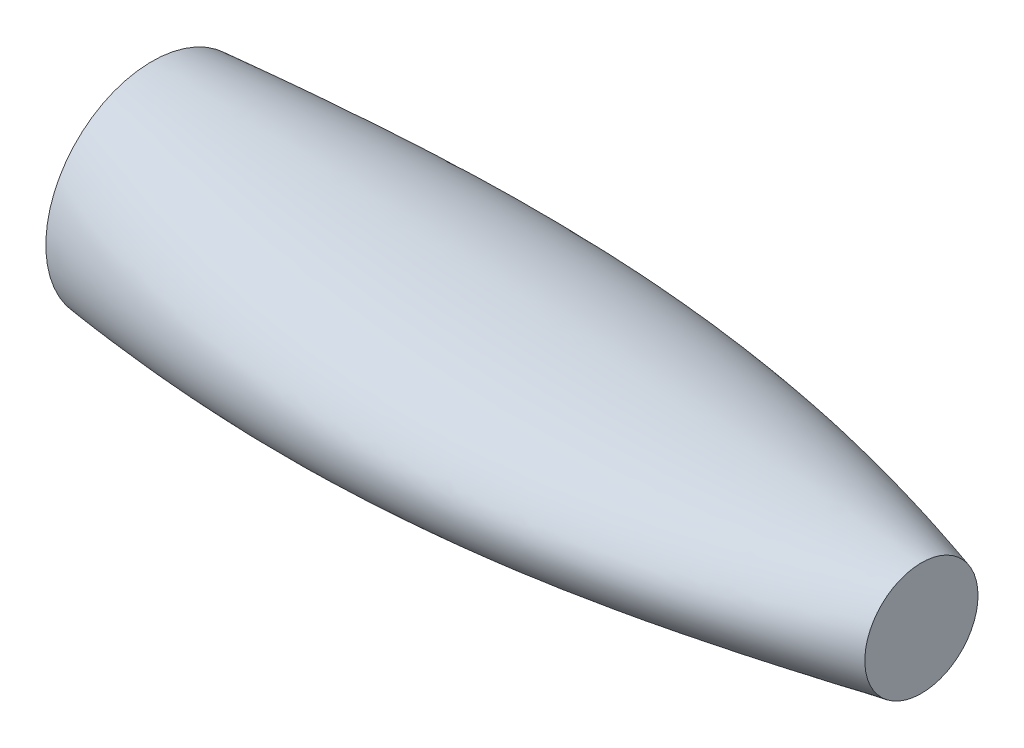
ISO-10303-21;
HEADER;
FILE_DESCRIPTION(('STEP AP214'),'2;1');
FILE_NAME('part.step','',(''),(''),'','','');
FILE_SCHEMA(('AUTOMOTIVE_DESIGN { 1 0 10303 214 1 1 1 1 }'));
ENDSEC;
DATA;
#1=APPLICATION_CONTEXT('core data for automotive mechanical design processes');
#2=APPLICATION_PROTOCOL_DEFINITION('international standard','automotive_design',2000,#1);
#3=PRODUCT_CONTEXT('',#1,'mechanical');
#4=PRODUCT('Part','Part','',(#3));
#5=PRODUCT_RELATED_PRODUCT_CATEGORY('part','',(#4));
#6=PRODUCT_DEFINITION_FORMATION('','',#4);
#7=PRODUCT_DEFINITION_CONTEXT('part definition',#1,'design');
#8=PRODUCT_DEFINITION('design','',#6,#7);
#9=PRODUCT_DEFINITION_SHAPE('','',#8);
#10=(LENGTH_UNIT() NAMED_UNIT(*) SI_UNIT(.MILLI.,.METRE.));
#11=(NAMED_UNIT(*) PLANE_ANGLE_UNIT() SI_UNIT($,.RADIAN.));
#12=(NAMED_UNIT(*) SI_UNIT($,.STERADIAN.) SOLID_ANGLE_UNIT());
#13=UNCERTAINTY_MEASURE_WITH_UNIT(LENGTH_MEASURE(1.E-05),#10,'distance_accuracy_value','');
#14=(GEOMETRIC_REPRESENTATION_CONTEXT(3) GLOBAL_UNCERTAINTY_ASSIGNED_CONTEXT((#13)) GLOBAL_UNIT_ASSIGNED_CONTEXT((#10,
#11,#12)) REPRESENTATION_CONTEXT('',''));
#15=CARTESIAN_POINT('',(0.,0.,0.));
#16=DIRECTION('',(0.,0.,1.));
#17=DIRECTION('',(1.,0.,0.));
#18=AXIS2_PLACEMENT_3D('',#15,#16,#17);
#19=CARTESIAN_POINT('',(300.,0.,0.));
#20=DIRECTION('',(1.,0.,0.));
#21=DIRECTION('',(0.,0.,-1.));
#22=AXIS2_PLACEMENT_3D('',#19,#20,#21);
#23=PLANE('',#22);
#24=CARTESIAN_POINT('',(300.,0.,0.));
#25=DIRECTION('',(1.,0.,0.));
#26=DIRECTION('',(0.,0.,-1.));
#27=AXIS2_PLACEMENT_3D('',#24,#25,#26);
#28=CIRCLE('',#27,22.0675987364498);
#29=CARTESIAN_POINT('',(300.,0.,-22.0675987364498));
#30=VERTEX_POINT('',#29);
#31=EDGE_CURVE('E95',#30,#30,#28,.T.);
#32=ORIENTED_EDGE('',*,*,#31,.T.);
#33=EDGE_LOOP('',(#32));
#34=FACE_BOUND('',#33,.T.);
#35=ADVANCED_FACE('F87',(#34),#23,.T.);
#36=CARTESIAN_POINT('',(0.,0.,0.));
#37=DIRECTION('',(1.,0.,0.));
#38=DIRECTION('',(0.,0.,-1.));
#39=AXIS2_PLACEMENT_3D('',#36,#37,#38);
#40=PLANE('',#39);
#41=CARTESIAN_POINT('',(0.,0.,0.));
#42=DIRECTION('',(1.,0.,0.));
#43=DIRECTION('',(0.,0.,-1.));
#44=AXIS2_PLACEMENT_3D('',#41,#42,#43);
#45=CIRCLE('',#44,41.3732373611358);
#46=CARTESIAN_POINT('',(0.,0.,-41.3732373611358));
#47=VERTEX_POINT('',#46);
#48=EDGE_CURVE('E12',#47,#47,#45,.T.);
#49=ORIENTED_EDGE('',*,*,#48,.F.);
#50=EDGE_LOOP('',(#49));
#51=FACE_BOUND('',#50,.T.);
#52=ADVANCED_FACE('F137',(#51),#40,.F.);
#53=CARTESIAN_POINT('',(0.,0.,-41.3732373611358));
#54=CARTESIAN_POINT('',(101.047724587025,0.,-67.0820393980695));
#55=CARTESIAN_POINT('',(201.047724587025,0.,-60.6468265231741));
#56=CARTESIAN_POINT('',(300.,0.,-22.0675987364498));
#57=CARTESIAN_POINT('',(0.,2.70787203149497,-41.3732373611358));
#58=CARTESIAN_POINT('',(101.047724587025,2.28668833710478,-67.0820393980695));
#59=CARTESIAN_POINT('',(201.047724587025,1.86550464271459,-60.6468265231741));
#60=CARTESIAN_POINT('',(300.,1.4443209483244,-22.0675987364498));
#61=CARTESIAN_POINT('',(0.,8.12355204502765,-40.8399944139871));
#62=CARTESIAN_POINT('',(101.047724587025,6.85985446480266,-66.1291363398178));
#63=CARTESIAN_POINT('',(201.047724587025,5.59615688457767,-59.7765135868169));
#64=CARTESIAN_POINT('',(300.,4.33245930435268,-21.7821261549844));
#65=CARTESIAN_POINT('',(0.,15.934963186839,-38.4703295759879));
#66=CARTESIAN_POINT('',(101.047724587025,13.4566821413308,-62.0571784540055));
#67=CARTESIAN_POINT('',(201.047724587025,10.9784010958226,-56.0740448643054));
#68=CARTESIAN_POINT('',(300.,8.50012005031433,-20.5209288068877));
#69=CARTESIAN_POINT('',(0.,23.1339810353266,-34.6223992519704));
#70=CARTESIAN_POINT('',(101.047724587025,19.5353117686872,-55.6046947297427));
#71=CARTESIAN_POINT('',(201.047724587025,15.9366425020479,-50.2188529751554));
#72=CARTESIAN_POINT('',(300.,12.3379732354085,-18.4648739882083));
#73=CARTESIAN_POINT('',(0.,29.4439586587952,-29.4439291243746));
#74=CARTESIAN_POINT('',(101.047724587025,24.8647157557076,-47.0893423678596));
#75=CARTESIAN_POINT('',(201.047724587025,20.2854728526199,-42.5101828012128));
#76=CARTESIAN_POINT('',(300.,15.7062299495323,-15.7064504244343));
#77=CARTESIAN_POINT('',(0.,34.6224197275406,-23.1339475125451));
#78=CARTESIAN_POINT('',(101.047724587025,29.2366469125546,-36.8629803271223));
#79=CARTESIAN_POINT('',(201.047724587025,23.8508740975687,-33.2643801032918));
#80=CARTESIAN_POINT('',(300.,18.4651012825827,-12.3381468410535));
#81=CARTESIAN_POINT('',(0.,38.4703690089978,-15.9349409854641));
#82=CARTESIAN_POINT('',(101.047724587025,32.4873084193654,-25.3223228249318));
#83=CARTESIAN_POINT('',(201.047724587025,26.5042478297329,-22.8440429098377));
#84=CARTESIAN_POINT('',(300.,20.5211872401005,-8.50010124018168));
#85=CARTESIAN_POINT('',(0.,40.8399225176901,-8.12356269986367));
#86=CARTESIAN_POINT('',(101.047724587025,34.4869776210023,-12.8868618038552));
#87=CARTESIAN_POINT('',(201.047724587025,28.1340327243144,-11.6231581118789));
#88=CARTESIAN_POINT('',(300.,21.7810878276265,-4.33245162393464));
#89=CARTESIAN_POINT('',(0.,41.6400242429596,0.));
#90=CARTESIAN_POINT('',(101.047724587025,35.1640134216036,0.));
#91=CARTESIAN_POINT('',(201.047724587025,28.6880026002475,0.));
#92=CARTESIAN_POINT('',(300.,22.2119917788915,0.));
#93=CARTESIAN_POINT('',(0.,40.8399225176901,8.12356269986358));
#94=CARTESIAN_POINT('',(101.047724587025,34.4869776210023,12.8868618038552));
#95=CARTESIAN_POINT('',(201.047724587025,28.1340327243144,11.6231581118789));
#96=CARTESIAN_POINT('',(300.,21.7810878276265,4.33245162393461));
#97=CARTESIAN_POINT('',(0.,38.4703690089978,15.9349409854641));
#98=CARTESIAN_POINT('',(101.047724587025,32.4873084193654,25.3223228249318));
#99=CARTESIAN_POINT('',(201.047724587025,26.504247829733,22.8440429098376));
#100=CARTESIAN_POINT('',(300.,20.5211872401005,8.50010124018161));
#101=CARTESIAN_POINT('',(0.,34.6224197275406,23.133947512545));
#102=CARTESIAN_POINT('',(101.047724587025,29.2366469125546,36.8629803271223));
#103=CARTESIAN_POINT('',(201.047724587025,23.8508740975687,33.2643801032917));
#104=CARTESIAN_POINT('',(300.,18.4651012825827,12.3381468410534));
#105=CARTESIAN_POINT('',(0.,29.4439586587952,29.4439291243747));
#106=CARTESIAN_POINT('',(101.047724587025,24.8647157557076,47.0893423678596));
#107=CARTESIAN_POINT('',(201.047724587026,20.28547285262,42.5101828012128));
#108=CARTESIAN_POINT('',(300.,15.7062299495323,15.7064504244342));
#109=CARTESIAN_POINT('',(0.,23.1339810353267,34.6223992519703));
#110=CARTESIAN_POINT('',(101.047724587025,19.5353117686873,55.6046947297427));
#111=CARTESIAN_POINT('',(201.047724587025,15.9366425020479,50.2188529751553));
#112=CARTESIAN_POINT('',(300.,12.3379732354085,18.4648739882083));
#113=CARTESIAN_POINT('',(0.,15.934963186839,38.470329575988));
#114=CARTESIAN_POINT('',(101.047724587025,13.4566821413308,62.0571784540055));
#115=CARTESIAN_POINT('',(201.047724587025,10.9784010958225,56.0740448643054));
#116=CARTESIAN_POINT('',(299.999999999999,8.50012005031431,20.5209288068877));
#117=CARTESIAN_POINT('',(0.,8.1235520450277,40.839994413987));
#118=CARTESIAN_POINT('',(101.047724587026,6.8598544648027,66.1291363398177));
#119=CARTESIAN_POINT('',(201.047724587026,5.59615688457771,59.7765135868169));
#120=CARTESIAN_POINT('',(300.000000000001,4.33245930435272,21.7821261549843));
#121=CARTESIAN_POINT('',(0.,2.70787203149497,41.3732373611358));
#122=CARTESIAN_POINT('',(101.047724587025,2.28668833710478,67.0820393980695));
#123=CARTESIAN_POINT('',(201.047724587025,1.86550464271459,60.6468265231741));
#124=CARTESIAN_POINT('',(300.,1.4443209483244,22.0675987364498));
#125=CARTESIAN_POINT('',(0.,-2.70787203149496,41.3732373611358));
#126=CARTESIAN_POINT('',(101.047724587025,-2.28668833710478,67.0820393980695));
#127=CARTESIAN_POINT('',(201.047724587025,-1.86550464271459,60.6468265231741));
#128=CARTESIAN_POINT('',(300.,-1.44432094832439,22.0675987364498));
#129=CARTESIAN_POINT('',(0.,-8.12355204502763,40.8399944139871));
#130=CARTESIAN_POINT('',(101.047724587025,-6.85985446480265,66.1291363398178));
#131=CARTESIAN_POINT('',(201.047724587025,-5.59615688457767,59.7765135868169));
#132=CARTESIAN_POINT('',(300.,-4.33245930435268,21.7821261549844));
#133=CARTESIAN_POINT('',(0.,-15.934963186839,38.470329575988));
#134=CARTESIAN_POINT('',(101.047724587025,-13.4566821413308,62.0571784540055));
#135=CARTESIAN_POINT('',(201.047724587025,-10.9784010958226,56.0740448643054));
#136=CARTESIAN_POINT('',(300.,-8.50012005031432,20.5209288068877));
#137=CARTESIAN_POINT('',(0.,-23.1339810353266,34.6223992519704));
#138=CARTESIAN_POINT('',(101.047724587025,-19.5353117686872,55.6046947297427));
#139=CARTESIAN_POINT('',(201.047724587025,-15.9366425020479,50.2188529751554));
#140=CARTESIAN_POINT('',(300.,-12.3379732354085,18.4648739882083));
#141=CARTESIAN_POINT('',(0.,-29.4439586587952,29.4439291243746));
#142=CARTESIAN_POINT('',(101.047724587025,-24.8647157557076,47.0893423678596));
#143=CARTESIAN_POINT('',(201.047724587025,-20.2854728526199,42.5101828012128));
#144=CARTESIAN_POINT('',(300.,-15.7062299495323,15.7064504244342));
#145=CARTESIAN_POINT('',(0.,-34.6224197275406,23.1339475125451));
#146=CARTESIAN_POINT('',(101.047724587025,-29.2366469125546,36.8629803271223));
#147=CARTESIAN_POINT('',(201.047724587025,-23.8508740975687,33.2643801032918));
#148=CARTESIAN_POINT('',(300.,-18.4651012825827,12.3381468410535));
#149=CARTESIAN_POINT('',(0.,-38.4703690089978,15.9349409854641));
#150=CARTESIAN_POINT('',(101.047724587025,-32.4873084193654,25.3223228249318));
#151=CARTESIAN_POINT('',(201.047724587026,-26.504247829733,22.8440429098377));
#152=CARTESIAN_POINT('',(300.,-20.5211872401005,8.5001012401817));
#153=CARTESIAN_POINT('',(0.,-40.8399225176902,8.1235626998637));
#154=CARTESIAN_POINT('',(101.047724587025,-34.4869776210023,12.8868618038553));
#155=CARTESIAN_POINT('',(201.047724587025,-28.1340327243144,11.6231581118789));
#156=CARTESIAN_POINT('',(300.,-21.7810878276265,4.33245162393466));
#157=CARTESIAN_POINT('',(0.,-41.6400242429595,0.));
#158=CARTESIAN_POINT('',(101.047724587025,-35.1640134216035,0.));
#159=CARTESIAN_POINT('',(201.047724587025,-28.6880026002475,0.));
#160=CARTESIAN_POINT('',(300.,-22.2119917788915,0.));
#161=CARTESIAN_POINT('',(0.,-40.8399225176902,-8.12356269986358));
#162=CARTESIAN_POINT('',(101.047724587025,-34.4869776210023,-12.8868618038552));
#163=CARTESIAN_POINT('',(201.047724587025,-28.1340327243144,-11.6231581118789));
#164=CARTESIAN_POINT('',(300.,-21.7810878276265,-4.3324516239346));
#165=CARTESIAN_POINT('',(0.,-38.4703690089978,-15.9349409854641));
#166=CARTESIAN_POINT('',(101.047724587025,-32.4873084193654,-25.3223228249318));
#167=CARTESIAN_POINT('',(201.047724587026,-26.504247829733,-22.8440429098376));
#168=CARTESIAN_POINT('',(300.,-20.5211872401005,-8.50010124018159));
#169=CARTESIAN_POINT('',(0.,-34.6224197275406,-23.133947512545));
#170=CARTESIAN_POINT('',(101.047724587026,-29.2366469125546,-36.8629803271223));
#171=CARTESIAN_POINT('',(201.047724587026,-23.8508740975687,-33.2643801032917));
#172=CARTESIAN_POINT('',(300.000000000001,-18.4651012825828,-12.3381468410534));
#173=CARTESIAN_POINT('',(0.,-29.4439586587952,-29.4439291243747));
#174=CARTESIAN_POINT('',(101.047724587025,-24.8647157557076,-47.0893423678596));
#175=CARTESIAN_POINT('',(201.047724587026,-20.28547285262,-42.5101828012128));
#176=CARTESIAN_POINT('',(300.,-15.7062299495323,-15.7064504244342));
#177=CARTESIAN_POINT('',(0.,-23.1339810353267,-34.6223992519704));
#178=CARTESIAN_POINT('',(101.047724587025,-19.5353117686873,-55.6046947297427));
#179=CARTESIAN_POINT('',(201.047724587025,-15.9366425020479,-50.2188529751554));
#180=CARTESIAN_POINT('',(300.,-12.3379732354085,-18.4648739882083));
#181=CARTESIAN_POINT('',(0.,-15.934963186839,-38.4703295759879));
#182=CARTESIAN_POINT('',(101.047724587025,-13.4566821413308,-62.0571784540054));
#183=CARTESIAN_POINT('',(201.047724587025,-10.9784010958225,-56.0740448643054));
#184=CARTESIAN_POINT('',(300.,-8.50012005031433,-20.5209288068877));
#185=CARTESIAN_POINT('',(0.,-8.1235520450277,-40.8399944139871));
#186=CARTESIAN_POINT('',(101.047724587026,-6.85985446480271,-66.1291363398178));
#187=CARTESIAN_POINT('',(201.047724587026,-5.59615688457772,-59.7765135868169));
#188=CARTESIAN_POINT('',(300.000000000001,-4.33245930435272,-21.7821261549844));
#189=CARTESIAN_POINT('',(0.,-2.70787203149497,-41.3732373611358));
#190=CARTESIAN_POINT('',(101.047724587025,-2.28668833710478,-67.0820393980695));
#191=CARTESIAN_POINT('',(201.047724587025,-1.86550464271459,-60.6468265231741));
#192=CARTESIAN_POINT('',(300.,-1.4443209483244,-22.0675987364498));
#193=CARTESIAN_POINT('',(0.,0.,-41.3732373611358));
#194=CARTESIAN_POINT('',(101.047724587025,0.,-67.0820393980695));
#195=CARTESIAN_POINT('',(201.047724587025,0.,-60.6468265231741));
#196=CARTESIAN_POINT('',(300.,0.,-22.0675987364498));
#197=B_SPLINE_SURFACE_WITH_KNOTS('',3,3,((#53,#54,#55,#56),(#57,#58,#59,#60),(#61,#62,#63,#64),
(#65,#66,#67,#68),(#69,#70,#71,#72),(#73,#74,#75,#76),(#77,#78,#79,#80),(#81,#82,#83,#84),(#85,
#86,#87,#88),(#89,#90,#91,#92),(#93,#94,#95,#96),(#97,#98,#99,#100),(#101,#102,#103,#104),(#105,
#106,#107,#108),(#109,#110,#111,#112),(#113,#114,#115,#116),(#117,#118,#119,#120),(#121,#122,
#123,#124),(#125,#126,#127,#128),(#129,#130,#131,#132),(#133,#134,#135,#136),(#137,#138,#139,
#140),(#141,#142,#143,#144),(#145,#146,#147,#148),(#149,#150,#151,#152),(#153,#154,#155,#156),
(#157,#158,#159,#160),(#161,#162,#163,#164),(#165,#166,#167,#168),(#169,#170,#171,#172),(#173,
#174,#175,#176),(#177,#178,#179,#180),(#181,#182,#183,#184),(#185,#186,#187,#188),(#189,#190,
#191,#192),(#193,#194,#195,#196)),.UNSPECIFIED.,.T.,.F.,.F.,(4,1,1,1,1,1,1,1,1,1,1,1,1,1,1,1,2,
1,1,1,1,1,1,1,1,1,1,1,1,1,1,1,4),(4,4),(0.,0.03125,0.0625,0.09375,0.125,0.15625,0.1875,0.21875,
0.25,0.28125,0.3125,0.34375,0.375,0.40625,0.4375,0.46875,0.5,0.53125,0.5625,0.59375,0.625,
0.65625,0.6875,0.71875,0.75,0.78125,0.8125,0.84375,0.875,0.90625,0.9375,0.96875,1.),(0.,1.),.UNSPECIFIED.);
#198=CARTESIAN_POINT('',(0.,0.,-41.3732373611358));
#199=CARTESIAN_POINT('',(0.0986711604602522,0.,-41.3983415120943));
#200=CARTESIAN_POINT('',(0.197349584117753,0.,-41.4234171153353));
#201=CARTESIAN_POINT('',(0.394704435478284,0.,-41.4735070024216));
#202=CARTESIAN_POINT('',(0.493380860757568,0.,-41.4985212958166));
#203=CARTESIAN_POINT('',(0.690731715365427,0.,-41.548488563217));
#204=CARTESIAN_POINT('',(0.789406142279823,0.,-41.5734415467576));
#205=CARTESIAN_POINT('',(0.98675300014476,0.,-41.6232861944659));
#206=CARTESIAN_POINT('',(1.08542542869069,0.,-41.6481778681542));
#207=CARTESIAN_POINT('',(1.28276828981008,0.,-41.6978998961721));
#208=CARTESIAN_POINT('',(1.38143871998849,0.,-41.7227302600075));
#209=CARTESIAN_POINT('',(1.57877758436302,0.,-41.7723296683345));
#210=CARTESIAN_POINT('',(1.67744601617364,0.,-41.7970987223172));
#211=CARTESIAN_POINT('',(1.87478088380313,0.,-41.8465755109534));
#212=CARTESIAN_POINT('',(1.97344731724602,0.,-41.8712832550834));
#213=CARTESIAN_POINT('',(2.17077818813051,0.,-41.9206374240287));
#214=CARTESIAN_POINT('',(2.26944262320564,0.,-41.9452838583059));
#215=CARTESIAN_POINT('',(2.46676949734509,0.,-41.9945154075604));
#216=CARTESIAN_POINT('',(2.56543193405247,0.,-42.0191005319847));
#217=CARTESIAN_POINT('',(2.76275481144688,0.,-42.0682094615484));
#218=CARTESIAN_POINT('',(2.86141524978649,0.,-42.0927332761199));
#219=CARTESIAN_POINT('',(3.05873413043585,0.,-42.1417195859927));
#220=CARTESIAN_POINT('',(3.15739257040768,0.,-42.1661820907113));
#221=CARTESIAN_POINT('',(3.35470745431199,0.,-42.2150457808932));
#222=CARTESIAN_POINT('',(3.45336389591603,0.,-42.239446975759));
#223=CARTESIAN_POINT('',(3.65067478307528,0.,-42.28818804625));
#224=CARTESIAN_POINT('',(3.74932922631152,0.,-42.3125279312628));
#225=CARTESIAN_POINT('',(3.94663611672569,0.,-42.361146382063));
#226=CARTESIAN_POINT('',(4.04528856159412,0.,-42.3854249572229));
#227=CARTESIAN_POINT('',(4.24259145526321,0.,-42.4339207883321));
#228=CARTESIAN_POINT('',(4.34124190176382,0.,-42.458138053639));
#229=CARTESIAN_POINT('',(4.53854079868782,0.,-42.5065112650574));
#230=CARTESIAN_POINT('',(4.63718924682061,0.,-42.5306672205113));
#231=CARTESIAN_POINT('',(4.8344841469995,0.,-42.5789178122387));
#232=CARTESIAN_POINT('',(4.93313059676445,0.,-42.6030124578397));
#233=CARTESIAN_POINT('',(5.13042150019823,0.,-42.6511404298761));
#234=CARTESIAN_POINT('',(5.22906595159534,0.,-42.675173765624));
#235=CARTESIAN_POINT('',(5.42635285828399,0.,-42.7231791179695));
#236=CARTESIAN_POINT('',(5.52499531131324,0.,-42.7471511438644));
#237=CARTESIAN_POINT('',(5.72227822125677,0.,-42.7950338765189));
#238=CARTESIAN_POINT('',(5.82091867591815,0.,-42.8189445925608));
#239=CARTESIAN_POINT('',(6.01819758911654,0.,-42.8667047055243));
#240=CARTESIAN_POINT('',(6.11683604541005,0.,-42.890554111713));
#241=CARTESIAN_POINT('',(6.31411096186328,0.,-42.9381916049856));
#242=CARTESIAN_POINT('',(6.4127474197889,0.,-42.9619797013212));
#243=CARTESIAN_POINT('',(6.61001833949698,0.,-43.0094945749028));
#244=CARTESIAN_POINT('',(6.70865279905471,0.,-43.0332213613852));
#245=CARTESIAN_POINT('',(6.90591972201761,0.,-43.0806136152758));
#246=CARTESIAN_POINT('',(7.00455218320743,0.,-43.1042790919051));
#247=CARTESIAN_POINT('',(7.20181510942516,0.,-43.1515487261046));
#248=CARTESIAN_POINT('',(7.30044557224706,0.,-43.1751528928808));
#249=CARTESIAN_POINT('',(7.4977045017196,0.,-43.2222999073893));
#250=CARTESIAN_POINT('',(7.59633296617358,0.,-43.2458427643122));
#251=CARTESIAN_POINT('',(7.79358789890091,0.,-43.2928671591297));
#252=CARTESIAN_POINT('',(7.89221436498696,0.,-43.3163487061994));
#253=CARTESIAN_POINT('',(8.08946530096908,0.,-43.3632504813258));
#254=CARTESIAN_POINT('',(8.18808976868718,0.,-43.3866707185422));
#255=CARTESIAN_POINT('',(8.38533670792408,0.,-43.4334498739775));
#256=CARTESIAN_POINT('',(8.48395917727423,0.,-43.4568088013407));
#257=CARTESIAN_POINT('',(8.6812021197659,0.,-43.503465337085));
#258=CARTESIAN_POINT('',(8.77982259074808,0.,-43.5267629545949));
#259=CARTESIAN_POINT('',(8.97706153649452,0.,-43.573296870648));
#260=CARTESIAN_POINT('',(9.07568000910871,0.,-43.5965331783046));
#261=CARTESIAN_POINT('',(9.2729149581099,0.,-43.6429444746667));
#262=CARTESIAN_POINT('',(9.37153143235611,0.,-43.6661194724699));
#263=CARTESIAN_POINT('',(9.56876238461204,0.,-43.7124081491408));
#264=CARTESIAN_POINT('',(9.66737686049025,0.,-43.7355218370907));
#265=CARTESIAN_POINT('',(9.86460381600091,0.,-43.7816878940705));
#266=CARTESIAN_POINT('',(9.96321629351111,0.,-43.804740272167));
#267=CARTESIAN_POINT('',(10.1604392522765,0.,-43.8507837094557));
#268=CARTESIAN_POINT('',(10.2590497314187,0.,-43.8737747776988));
#269=CARTESIAN_POINT('',(10.4562686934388,0.,-43.9196955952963));
#270=CARTESIAN_POINT('',(10.5548771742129,0.,-43.942625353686));
#271=CARTESIAN_POINT('',(10.7520921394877,0.,-43.9884235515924));
#272=CARTESIAN_POINT('',(10.8506986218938,0.,-44.0112920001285));
#273=CARTESIAN_POINT('',(11.0479095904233,0.,-44.0569675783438));
#274=CARTESIAN_POINT('',(11.1465140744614,0.,-44.0797747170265));
#275=CARTESIAN_POINT('',(11.3437210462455,0.,-44.1253276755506));
#276=CARTESIAN_POINT('',(11.4423235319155,0.,-44.1480735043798));
#277=CARTESIAN_POINT('',(11.6395265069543,0.,-44.1935038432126));
#278=CARTESIAN_POINT('',(11.7381269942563,0.,-44.2161883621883));
#279=CARTESIAN_POINT('',(11.9353259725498,0.,-44.26149608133));
#280=CARTESIAN_POINT('',(12.0339244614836,0.,-44.2841192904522));
#281=CARTESIAN_POINT('',(12.2311194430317,0.,-44.3293043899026));
#282=CARTESIAN_POINT('',(12.3297159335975,0.,-44.3518662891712));
#283=CARTESIAN_POINT('',(12.5269069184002,0.,-44.3969287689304));
#284=CARTESIAN_POINT('',(12.6255014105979,0.,-44.4194293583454));
#285=CARTESIAN_POINT('',(12.8226883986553,0.,-44.4643692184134));
#286=CARTESIAN_POINT('',(12.9212808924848,0.,-44.4868084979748));
#287=CARTESIAN_POINT('',(13.1184638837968,0.,-44.5316257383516));
#288=CARTESIAN_POINT('',(13.2170543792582,0.,-44.5540037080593));
#289=CARTESIAN_POINT('',(13.4142333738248,0.,-44.5986983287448));
#290=CARTESIAN_POINT('',(13.5128218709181,0.,-44.6210149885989));
#291=CARTESIAN_POINT('',(13.7099968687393,0.,-44.6655869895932));
#292=CARTESIAN_POINT('',(13.8085833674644,0.,-44.6878423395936));
#293=CARTESIAN_POINT('',(14.0057543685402,0.,-44.7322917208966));
#294=CARTESIAN_POINT('',(14.1043388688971,0.,-44.7544857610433));
#295=CARTESIAN_POINT('',(14.3015058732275,0.,-44.798812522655));
#296=CARTESIAN_POINT('',(14.4000883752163,0.,-44.820945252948));
#297=CARTESIAN_POINT('',(14.5972513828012,0.,-44.8651493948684));
#298=CARTESIAN_POINT('',(14.6958318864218,0.,-44.8872208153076));
#299=CARTESIAN_POINT('',(14.8929908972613,0.,-44.9313023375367));
#300=CARTESIAN_POINT('',(14.9915694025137,0.,-44.9533124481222));
#301=CARTESIAN_POINT('',(15.1887244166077,0.,-44.99727135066));
#302=CARTESIAN_POINT('',(15.2873009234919,0.,-45.0192201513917));
#303=CARTESIAN_POINT('',(15.4844519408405,0.,-45.0630564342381));
#304=CARTESIAN_POINT('',(15.5830264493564,0.,-45.084943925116));
#305=CARTESIAN_POINT('',(15.7801734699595,0.,-45.1286575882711));
#306=CARTESIAN_POINT('',(15.8787459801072,0.,-45.1504837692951));
#307=CARTESIAN_POINT('',(16.0758890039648,0.,-45.1940748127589));
#308=CARTESIAN_POINT('',(16.1744595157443,0.,-45.2158396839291));
#309=CARTESIAN_POINT('',(16.3715985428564,0.,-45.2593081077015));
#310=CARTESIAN_POINT('',(16.4701670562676,0.,-45.2810116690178));
#311=CARTESIAN_POINT('',(16.6673020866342,0.,-45.3243574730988));
#312=CARTESIAN_POINT('',(16.7658686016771,0.,-45.3459997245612));
#313=CARTESIAN_POINT('',(16.9629996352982,0.,-45.3892229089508));
#314=CARTESIAN_POINT('',(17.0615641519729,0.,-45.4108038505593));
#315=CARTESIAN_POINT('',(17.2586911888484,0.,-45.4539044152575));
#316=CARTESIAN_POINT('',(17.3572537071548,0.,-45.4754240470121));
#317=CARTESIAN_POINT('',(17.5543767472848,0.,-45.5184019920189));
#318=CARTESIAN_POINT('',(17.6529372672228,0.,-45.5398603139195));
#319=CARTESIAN_POINT('',(17.8500563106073,0.,-45.5827156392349));
#320=CARTESIAN_POINT('',(17.948614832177,0.,-45.6041126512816));
#321=CARTESIAN_POINT('',(18.1457298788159,0.,-45.6468453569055));
#322=CARTESIAN_POINT('',(18.2442864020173,0.,-45.6681810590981));
#323=CARTESIAN_POINT('',(18.4413974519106,0.,-45.7107911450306));
#324=CARTESIAN_POINT('',(18.5399519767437,0.,-45.7320655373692));
#325=CARTESIAN_POINT('',(18.7370590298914,0.,-45.7745530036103));
#326=CARTESIAN_POINT('',(18.8356115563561,0.,-45.7957660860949));
#327=CARTESIAN_POINT('',(19.0327146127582,0.,-45.8381309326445));
#328=CARTESIAN_POINT('',(19.1312651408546,0.,-45.8592827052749));
#329=CARTESIAN_POINT('',(19.3283642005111,0.,-45.9015249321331));
#330=CARTESIAN_POINT('',(19.4269127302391,0.,-45.9226153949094));
#331=CARTESIAN_POINT('',(19.62400779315,0.,-45.9647350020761));
#332=CARTESIAN_POINT('',(19.7225543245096,0.,-45.9857641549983));
#333=CARTESIAN_POINT('',(19.9196453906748,0.,-46.0277611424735));
#334=CARTESIAN_POINT('',(20.018189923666,0.,-46.0487289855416));
#335=CARTESIAN_POINT('',(20.2152769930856,0.,-46.0906033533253));
#336=CARTESIAN_POINT('',(20.3138195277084,0.,-46.1115098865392));
#337=CARTESIAN_POINT('',(20.5109026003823,0.,-46.1532616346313));
#338=CARTESIAN_POINT('',(20.6094431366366,0.,-46.1741068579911));
#339=CARTESIAN_POINT('',(20.8065222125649,0.,-46.2157359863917));
#340=CARTESIAN_POINT('',(20.9050607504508,0.,-46.2365198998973));
#341=CARTESIAN_POINT('',(21.1021358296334,0.,-46.2780264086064));
#342=CARTESIAN_POINT('',(21.2006723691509,0.,-46.2987490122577));
#343=CARTESIAN_POINT('',(21.3977434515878,0.,-46.3401329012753));
#344=CARTESIAN_POINT('',(21.4962779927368,0.,-46.3607941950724));
#345=CARTESIAN_POINT('',(21.693345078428,0.,-46.4020554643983));
#346=CARTESIAN_POINT('',(21.7918776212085,0.,-46.4226554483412));
#347=CARTESIAN_POINT('',(21.988940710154,0.,-46.4637940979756));
#348=CARTESIAN_POINT('',(22.087471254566,0.,-46.4843327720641));
#349=CARTESIAN_POINT('',(22.2845303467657,0.,-46.5253488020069));
#350=CARTESIAN_POINT('',(22.3830588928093,0.,-46.5458261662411));
#351=CARTESIAN_POINT('',(22.5801139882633,0.,-46.5867195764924));
#352=CARTESIAN_POINT('',(22.6786405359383,0.,-46.6071356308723));
#353=CARTESIAN_POINT('',(22.8756916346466,0.,-46.6479064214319));
#354=CARTESIAN_POINT('',(22.974216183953,0.,-46.6682611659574));
#355=CARTESIAN_POINT('',(23.1712632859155,0.,-46.7089093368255));
#356=CARTESIAN_POINT('',(23.2697858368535,0.,-46.7292027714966));
#357=CARTESIAN_POINT('',(23.4668289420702,0.,-46.769728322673));
#358=CARTESIAN_POINT('',(23.5653494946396,0.,-46.7899604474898));
#359=CARTESIAN_POINT('',(23.7623886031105,0.,-46.8303633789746));
#360=CARTESIAN_POINT('',(23.8609071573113,0.,-46.8505341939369));
#361=CARTESIAN_POINT('',(24.0579422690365,0.,-46.8908145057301));
#362=CARTESIAN_POINT('',(24.1564588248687,0.,-46.9109240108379));
#363=CARTESIAN_POINT('',(24.3534899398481,0.,-46.9510817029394));
#364=CARTESIAN_POINT('',(24.4520044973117,0.,-46.9711298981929));
#365=CARTESIAN_POINT('',(24.6490316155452,0.,-47.0111649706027));
#366=CARTESIAN_POINT('',(24.7475441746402,0.,-47.0311518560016));
#367=CARTESIAN_POINT('',(24.9445672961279,0.,-47.0710643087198));
#368=CARTESIAN_POINT('',(25.0430778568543,0.,-47.0909898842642));
#369=CARTESIAN_POINT('',(25.2400969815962,0.,-47.1307797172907));
#370=CARTESIAN_POINT('',(25.3386055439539,0.,-47.1506439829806));
#371=CARTESIAN_POINT('',(25.5356206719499,0.,-47.1903111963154));
#372=CARTESIAN_POINT('',(25.634127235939,0.,-47.2101141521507));
#373=CARTESIAN_POINT('',(25.8311383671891,0.,-47.2496587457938));
#374=CARTESIAN_POINT('',(25.9296429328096,0.,-47.2694003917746));
#375=CARTESIAN_POINT('',(26.1266500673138,0.,-47.308822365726));
#376=CARTESIAN_POINT('',(26.2251526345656,0.,-47.3285027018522));
#377=CARTESIAN_POINT('',(26.422155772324,0.,-47.3678020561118));
#378=CARTESIAN_POINT('',(26.5206563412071,0.,-47.3874210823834));
#379=CARTESIAN_POINT('',(26.7176554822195,0.,-47.4265978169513));
#380=CARTESIAN_POINT('',(26.8161540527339,0.,-47.4461555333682));
#381=CARTESIAN_POINT('',(27.0131491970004,0.,-47.4852096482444));
#382=CARTESIAN_POINT('',(27.1116457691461,0.,-47.5047060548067));
#383=CARTESIAN_POINT('',(27.3086369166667,0.,-47.5436375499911));
#384=CARTESIAN_POINT('',(27.4071314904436,0.,-47.5630726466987));
#385=CARTESIAN_POINT('',(27.6041186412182,0.,-47.6018815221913));
#386=CARTESIAN_POINT('',(27.7026112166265,0.,-47.6212553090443));
#387=CARTESIAN_POINT('',(27.8995943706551,0.,-47.6599415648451));
#388=CARTESIAN_POINT('',(27.9980849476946,0.,-47.6792540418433));
#389=CARTESIAN_POINT('',(28.1950641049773,0.,-47.7178176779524));
#390=CARTESIAN_POINT('',(28.293552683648,0.,-47.7370688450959));
#391=CARTESIAN_POINT('',(28.4905278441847,0.,-47.7755098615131));
#392=CARTESIAN_POINT('',(28.5890144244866,0.,-47.7946997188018));
#393=CARTESIAN_POINT('',(28.7859855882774,0.,-47.8330181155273));
#394=CARTESIAN_POINT('',(28.8844701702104,0.,-47.8521466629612));
#395=CARTESIAN_POINT('',(29.0814373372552,0.,-47.8903424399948));
#396=CARTESIAN_POINT('',(29.1799199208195,0.,-47.909409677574));
#397=CARTESIAN_POINT('',(29.3768830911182,0.,-47.9474828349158));
#398=CARTESIAN_POINT('',(29.4753636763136,0.,-47.9664887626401));
#399=CARTESIAN_POINT('',(29.6723228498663,0.,-48.00443930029));
#400=CARTESIAN_POINT('',(29.7708014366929,0.,-48.0233839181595));
#401=CARTESIAN_POINT('',(29.9677566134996,0.,-48.0612118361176));
#402=CARTESIAN_POINT('',(30.0662332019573,0.,-48.0800951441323));
#403=CARTESIAN_POINT('',(30.2631843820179,0.,-48.1178004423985));
#404=CARTESIAN_POINT('',(30.3616589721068,0.,-48.1366224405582));
#405=CARTESIAN_POINT('',(30.5586061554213,0.,-48.1742051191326));
#406=CARTESIAN_POINT('',(30.6570787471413,0.,-48.1929658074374));
#407=CARTESIAN_POINT('',(30.8540219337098,0.,-48.2304258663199));
#408=CARTESIAN_POINT('',(30.9524925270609,0.,-48.2491252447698));
#409=CARTESIAN_POINT('',(31.1494317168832,0.,-48.2864626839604));
#410=CARTESIAN_POINT('',(31.2479003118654,0.,-48.3051007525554));
#411=CARTESIAN_POINT('',(31.4448355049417,0.,-48.3423155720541));
#412=CARTESIAN_POINT('',(31.5433021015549,0.,-48.3608923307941));
#413=CARTESIAN_POINT('',(31.740233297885,0.,-48.3979845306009));
#414=CARTESIAN_POINT('',(31.8386978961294,0.,-48.4164999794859));
#415=CARTESIAN_POINT('',(32.0356250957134,0.,-48.4534695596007));
#416=CARTESIAN_POINT('',(32.1340876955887,0.,-48.4719236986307));
#417=CARTESIAN_POINT('',(32.3310108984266,0.,-48.5087706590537));
#418=CARTESIAN_POINT('',(32.4294714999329,0.,-48.5271634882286));
#419=CARTESIAN_POINT('',(32.6263907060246,0.,-48.5638878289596));
#420=CARTESIAN_POINT('',(32.724849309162,0.,-48.5822193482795));
#421=CARTESIAN_POINT('',(32.9217645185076,0.,-48.6188210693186));
#422=CARTESIAN_POINT('',(33.020221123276,0.,-48.6370912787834));
#423=CARTESIAN_POINT('',(33.2171323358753,0.,-48.6735703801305));
#424=CARTESIAN_POINT('',(33.3155869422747,0.,-48.6917792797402));
#425=CARTESIAN_POINT('',(33.5124941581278,0.,-48.7281357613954));
#426=CARTESIAN_POINT('',(33.6109467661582,0.,-48.74628335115));
#427=CARTESIAN_POINT('',(33.8078499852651,0.,-48.7825172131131));
#428=CARTESIAN_POINT('',(33.9063005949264,0.,-48.8006034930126));
#429=CARTESIAN_POINT('',(34.1031998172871,0.,-48.8367147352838));
#430=CARTESIAN_POINT('',(34.2016484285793,0.,-48.8547397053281));
#431=CARTESIAN_POINT('',(34.3985436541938,0.,-48.8907283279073));
#432=CARTESIAN_POINT('',(34.496990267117,0.,-48.9086919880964));
#433=CARTESIAN_POINT('',(34.6938814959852,0.,-48.9445579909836));
#434=CARTESIAN_POINT('',(34.7923261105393,0.,-48.9624603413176));
#435=CARTESIAN_POINT('',(34.9892133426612,0.,-48.9982037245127));
#436=CARTESIAN_POINT('',(35.0876559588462,0.,-49.0160447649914));
#437=CARTESIAN_POINT('',(35.2845391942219,0.,-49.0516655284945));
#438=CARTESIAN_POINT('',(35.3829798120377,0.,-49.0694452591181));
#439=CARTESIAN_POINT('',(35.5798590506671,0.,-49.1049434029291));
#440=CARTESIAN_POINT('',(35.6782976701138,0.,-49.1226618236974));
#441=CARTESIAN_POINT('',(35.875172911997,0.,-49.1580373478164));
#442=CARTESIAN_POINT('',(35.9736095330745,0.,-49.1756944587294));
#443=CARTESIAN_POINT('',(36.1704807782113,0.,-49.2109473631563));
#444=CARTESIAN_POINT('',(36.2689154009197,0.,-49.228543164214));
#445=CARTESIAN_POINT('',(36.4657826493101,0.,-49.2636734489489));
#446=CARTESIAN_POINT('',(36.5642152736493,0.,-49.2812079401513));
#447=CARTESIAN_POINT('',(36.7610785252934,0.,-49.316215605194));
#448=CARTESIAN_POINT('',(36.8595091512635,0.,-49.3336887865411));
#449=CARTESIAN_POINT('',(37.0563684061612,0.,-49.3685738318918));
#450=CARTESIAN_POINT('',(37.154797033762,0.,-49.3859857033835));
#451=CARTESIAN_POINT('',(37.3516522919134,0.,-49.4207481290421));
#452=CARTESIAN_POINT('',(37.450078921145,0.,-49.4380986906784));
#453=CARTESIAN_POINT('',(37.64693018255,0.,-49.4727384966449));
#454=CARTESIAN_POINT('',(37.7453548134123,0.,-49.4900277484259));
#455=CARTESIAN_POINT('',(37.9422020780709,0.,-49.5245449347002));
#456=CARTESIAN_POINT('',(38.0406247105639,0.,-49.5417728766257));
#457=CARTESIAN_POINT('',(38.2374679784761,0.,-49.576167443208));
#458=CARTESIAN_POINT('',(38.3358886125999,0.,-49.5933340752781));
#459=CARTESIAN_POINT('',(38.5327278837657,0.,-49.6276060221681));
#460=CARTESIAN_POINT('',(38.6311465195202,0.,-49.6447113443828));
#461=CARTESIAN_POINT('',(38.8279817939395,0.,-49.6788606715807));
#462=CARTESIAN_POINT('',(38.9263984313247,0.,-49.6959046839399));
#463=CARTESIAN_POINT('',(39.1232297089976,0.,-49.7299313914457));
#464=CARTESIAN_POINT('',(39.2216443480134,0.,-49.7469140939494));
#465=CARTESIAN_POINT('',(39.4184716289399,0.,-49.780818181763));
#466=CARTESIAN_POINT('',(39.5168842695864,0.,-49.7977395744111));
#467=CARTESIAN_POINT('',(39.7137075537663,0.,-49.8315210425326));
#468=CARTESIAN_POINT('',(39.8121181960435,0.,-49.8483811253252));
#469=CARTESIAN_POINT('',(40.0089374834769,0.,-49.8820399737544));
#470=CARTESIAN_POINT('',(40.1073461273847,0.,-49.8988387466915));
#471=CARTESIAN_POINT('',(40.3041614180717,0.,-49.9323749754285));
#472=CARTESIAN_POINT('',(40.4025680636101,0.,-49.9491124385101));
#473=CARTESIAN_POINT('',(40.5993793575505,0.,-49.9825260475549));
#474=CARTESIAN_POINT('',(40.6977840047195,0.,-49.9992022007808));
#475=CARTESIAN_POINT('',(40.8945913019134,0.,-50.0324931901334));
#476=CARTESIAN_POINT('',(40.992993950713,0.,-50.0491080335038));
#477=CARTESIAN_POINT('',(41.1897972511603,0.,-50.0822764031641));
#478=CARTESIAN_POINT('',(41.2881979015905,0.,-50.0988299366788));
#479=CARTESIAN_POINT('',(41.4849972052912,0.,-50.131875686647));
#480=CARTESIAN_POINT('',(41.5833958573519,0.,-50.148367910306));
#481=CARTESIAN_POINT('',(41.7801911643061,0.,-50.1812910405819));
#482=CARTESIAN_POINT('',(41.8785878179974,0.,-50.1977219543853));
#483=CARTESIAN_POINT('',(42.075379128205,0.,-50.2305224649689));
#484=CARTESIAN_POINT('',(42.1737737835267,0.,-50.2468920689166));
#485=CARTESIAN_POINT('',(42.3705610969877,0.,-50.279569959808));
#486=CARTESIAN_POINT('',(42.46895375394,0.,-50.2958782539));
#487=CARTESIAN_POINT('',(42.6657370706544,0.,-50.3284335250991));
#488=CARTESIAN_POINT('',(42.7641277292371,0.,-50.3446805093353));
#489=CARTESIAN_POINT('',(42.9609070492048,0.,-50.3771131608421));
#490=CARTESIAN_POINT('',(43.059295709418,0.,-50.3932988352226));
#491=CARTESIAN_POINT('',(43.2560710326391,0.,-50.4256088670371));
#492=CARTESIAN_POINT('',(43.3544576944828,0.,-50.4417332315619));
#493=CARTESIAN_POINT('',(43.5512290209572,0.,-50.4739206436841));
#494=CARTESIAN_POINT('',(43.6496136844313,0.,-50.4899836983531));
#495=CARTESIAN_POINT('',(43.8463810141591,0.,-50.522048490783));
#496=CARTESIAN_POINT('',(43.9447636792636,0.,-50.5380502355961));
#497=CARTESIAN_POINT('',(44.1415270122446,0.,-50.5699924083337));
#498=CARTESIAN_POINT('',(44.2399076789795,0.,-50.585932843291));
#499=CARTESIAN_POINT('',(44.4366670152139,0.,-50.6177523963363));
#500=CARTESIAN_POINT('',(44.5350456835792,0.,-50.6336315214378));
#501=CARTESIAN_POINT('',(44.7318010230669,0.,-50.6653284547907));
#502=CARTESIAN_POINT('',(44.8301776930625,0.,-50.6811462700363));
#503=CARTESIAN_POINT('',(45.0269290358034,0.,-50.7127205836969));
#504=CARTESIAN_POINT('',(45.1253037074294,0.,-50.7284770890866));
#505=CARTESIAN_POINT('',(45.3220510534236,0.,-50.7599287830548));
#506=CARTESIAN_POINT('',(45.4204237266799,0.,-50.7756239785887));
#507=CARTESIAN_POINT('',(45.6171670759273,0.,-50.8069530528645));
#508=CARTESIAN_POINT('',(45.715537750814,0.,-50.8225869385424));
#509=CARTESIAN_POINT('',(45.9122771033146,0.,-50.8537933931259));
#510=CARTESIAN_POINT('',(46.0106457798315,0.,-50.8693659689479));
#511=CARTESIAN_POINT('',(46.2073811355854,0.,-50.900449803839));
#512=CARTESIAN_POINT('',(46.3057478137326,0.,-50.915961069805));
#513=CARTESIAN_POINT('',(46.5024791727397,0.,-50.9469222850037));
#514=CARTESIAN_POINT('',(46.6008438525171,0.,-50.9623722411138));
#515=CARTESIAN_POINT('',(46.7975712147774,0.,-50.99321083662));
#516=CARTESIAN_POINT('',(46.8959338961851,0.,-51.0085994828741));
#517=CARTESIAN_POINT('',(47.0926572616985,0.,-51.039315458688));
#518=CARTESIAN_POINT('',(47.1910179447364,0.,-51.054642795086));
#519=CARTESIAN_POINT('',(47.387737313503,0.,-51.0852361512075));
#520=CARTESIAN_POINT('',(47.4860959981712,0.,-51.1005021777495));
#521=CARTESIAN_POINT('',(47.6828113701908,0.,-51.1309729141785));
#522=CARTESIAN_POINT('',(47.7811680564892,0.,-51.1461776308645));
#523=CARTESIAN_POINT('',(47.977879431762,0.,-51.176525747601));
#524=CARTESIAN_POINT('',(48.0762341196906,0.,-51.1916691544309));
#525=CARTESIAN_POINT('',(48.2729414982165,0.,-51.2218946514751));
#526=CARTESIAN_POINT('',(48.3712941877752,0.,-51.2369767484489));
#527=CARTESIAN_POINT('',(48.5679975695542,0.,-51.2670796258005));
#528=CARTESIAN_POINT('',(48.666348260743,0.,-51.2821004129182));
#529=CARTESIAN_POINT('',(48.8630476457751,0.,-51.3120806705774));
#530=CARTESIAN_POINT('',(48.9613963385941,0.,-51.327040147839));
#531=CARTESIAN_POINT('',(49.1580917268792,0.,-51.3568977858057));
#532=CARTESIAN_POINT('',(49.2564384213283,0.,-51.3717959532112));
#533=CARTESIAN_POINT('',(49.4531298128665,0.,-51.4015309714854));
#534=CARTESIAN_POINT('',(49.5514745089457,0.,-51.4163678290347));
#535=CARTESIAN_POINT('',(49.7481619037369,0.,-51.4459802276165));
#536=CARTESIAN_POINT('',(49.8465046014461,0.,-51.4607557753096));
#537=CARTESIAN_POINT('',(50.0431879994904,0.,-51.4902455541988));
#538=CARTESIAN_POINT('',(50.1415286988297,0.,-51.5049597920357));
#539=CARTESIAN_POINT('',(50.3382081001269,0.,-51.5343269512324));
#540=CARTESIAN_POINT('',(50.4365468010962,0.,-51.5489798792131));
#541=CARTESIAN_POINT('',(50.6332222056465,0.,-51.5782244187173));
#542=CARTESIAN_POINT('',(50.7315589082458,0.,-51.5928160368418));
#543=CARTESIAN_POINT('',(50.928230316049,0.,-51.6219379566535));
#544=CARTESIAN_POINT('',(51.0265650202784,0.,-51.6364682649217));
#545=CARTESIAN_POINT('',(51.2232324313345,0.,-51.6654675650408));
#546=CARTESIAN_POINT('',(51.3215651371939,0.,-51.6799365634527));
#547=CARTESIAN_POINT('',(51.518228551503,0.,-51.7088132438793));
#548=CARTESIAN_POINT('',(51.6165592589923,0.,-51.723220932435));
#549=CARTESIAN_POINT('',(51.8132186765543,0.,-51.751974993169));
#550=CARTESIAN_POINT('',(51.9115473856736,0.,-51.7663213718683));
#551=CARTESIAN_POINT('',(52.1082028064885,0.,-51.7949528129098));
#552=CARTESIAN_POINT('',(52.2065295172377,0.,-51.8092378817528));
#553=CARTESIAN_POINT('',(52.4031809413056,0.,-51.8377467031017));
#554=CARTESIAN_POINT('',(52.5015056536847,0.,-51.8519704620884));
#555=CARTESIAN_POINT('',(52.6981530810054,0.,-51.8803566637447));
#556=CARTESIAN_POINT('',(52.7964757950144,0.,-51.894519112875));
#557=CARTESIAN_POINT('',(52.993119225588,0.,-51.9227826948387));
#558=CARTESIAN_POINT('',(53.0914399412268,0.,-51.9368838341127));
#559=CARTESIAN_POINT('',(53.2880793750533,0.,-51.9650247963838));
#560=CARTESIAN_POINT('',(53.386398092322,0.,-51.9790646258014));
#561=CARTESIAN_POINT('',(53.5830335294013,0.,-52.0070829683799));
#562=CARTESIAN_POINT('',(53.6813502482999,0.,-52.021061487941));
#563=CARTESIAN_POINT('',(53.8779816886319,0.,-52.0489572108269));
#564=CARTESIAN_POINT('',(53.9762964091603,0.,-52.0628744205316));
#565=CARTESIAN_POINT('',(54.1729238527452,0.,-52.0906475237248));
#566=CARTESIAN_POINT('',(54.2712365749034,0.,-52.1045034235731));
#567=CARTESIAN_POINT('',(54.4678600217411,0.,-52.1321539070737));
#568=CARTESIAN_POINT('',(54.5661707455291,0.,-52.1459484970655));
#569=CARTESIAN_POINT('',(54.7627901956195,0.,-52.1734763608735));
#570=CARTESIAN_POINT('',(54.8610989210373,0.,-52.1872096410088));
#571=CARTESIAN_POINT('',(55.0577143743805,0.,-52.2146148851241));
#572=CARTESIAN_POINT('',(55.156021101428,0.,-52.2282868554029));
#573=CARTESIAN_POINT('',(55.352632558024,0.,-52.2555694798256));
#574=CARTESIAN_POINT('',(55.4509372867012,0.,-52.2691801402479));
#575=CARTESIAN_POINT('',(55.6475447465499,0.,-52.2963401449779));
#576=CARTESIAN_POINT('',(55.7458474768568,0.,-52.3098894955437));
#577=CARTESIAN_POINT('',(55.9424509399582,0.,-52.336926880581));
#578=CARTESIAN_POINT('',(56.0407516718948,0.,-52.3504149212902));
#579=CARTESIAN_POINT('',(56.2373511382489,0.,-52.3773296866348));
#580=CARTESIAN_POINT('',(56.3356498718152,0.,-52.3907564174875));
#581=CARTESIAN_POINT('',(56.532245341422,0.,-52.4175485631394));
#582=CARTESIAN_POINT('',(56.630542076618,0.,-52.4309139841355));
#583=CARTESIAN_POINT('',(56.8271335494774,0.,-52.4575835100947));
#584=CARTESIAN_POINT('',(56.925428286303,0.,-52.4708876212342));
#585=CARTESIAN_POINT('',(57.1220157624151,0.,-52.4974345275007));
#586=CARTESIAN_POINT('',(57.2203085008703,0.,-52.5106773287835));
#587=CARTESIAN_POINT('',(57.416891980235,0.,-52.5371016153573));
#588=CARTESIAN_POINT('',(57.5151827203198,0.,-52.5502831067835));
#589=CARTESIAN_POINT('',(57.7117622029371,0.,-52.5765847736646));
#590=CARTESIAN_POINT('',(57.8100509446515,0.,-52.5897049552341));
#591=CARTESIAN_POINT('',(58.0066264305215,0.,-52.6158840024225));
#592=CARTESIAN_POINT('',(58.1049131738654,0.,-52.6289428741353));
#593=CARTESIAN_POINT('',(58.3014846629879,0.,-52.6549993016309));
#594=CARTESIAN_POINT('',(58.3997694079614,0.,-52.6679968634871));
#595=CARTESIAN_POINT('',(58.5963369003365,0.,-52.6939306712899));
#596=CARTESIAN_POINT('',(58.6946196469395,0.,-52.7068669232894));
#597=CARTESIAN_POINT('',(58.8911831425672,0.,-52.7326781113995));
#598=CARTESIAN_POINT('',(58.9894638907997,0.,-52.7455530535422));
#599=CARTESIAN_POINT('',(59.1860233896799,0.,-52.7712416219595));
#600=CARTESIAN_POINT('',(59.2843021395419,0.,-52.7840552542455));
#601=CARTESIAN_POINT('',(59.4808576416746,0.,-52.8096212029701));
#602=CARTESIAN_POINT('',(59.5791343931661,0.,-52.8223735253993));
#603=CARTESIAN_POINT('',(59.7756858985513,0.,-52.8478168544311));
#604=CARTESIAN_POINT('',(59.8739606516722,0.,-52.8605078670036));
#605=CARTESIAN_POINT('',(60.0705081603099,0.,-52.8858285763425));
#606=CARTESIAN_POINT('',(60.1687809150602,0.,-52.8984582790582));
#607=CARTESIAN_POINT('',(60.3653244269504,0.,-52.9236563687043));
#608=CARTESIAN_POINT('',(60.4635951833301,0.,-52.9362247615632));
#609=CARTESIAN_POINT('',(60.6601346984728,0.,-52.9613002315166));
#610=CARTESIAN_POINT('',(60.7584034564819,0.,-52.9738073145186));
#611=CARTESIAN_POINT('',(60.954938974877,0.,-52.9987601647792));
#612=CARTESIAN_POINT('',(61.0532057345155,0.,-53.0112059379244));
#613=CARTESIAN_POINT('',(61.249737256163,0.,-53.0360361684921));
#614=CARTESIAN_POINT('',(61.3480020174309,0.,-53.0484206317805));
#615=CARTESIAN_POINT('',(61.5445295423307,0.,-53.0731282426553));
#616=CARTESIAN_POINT('',(61.6427923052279,0.,-53.0854513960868));
#617=CARTESIAN_POINT('',(61.8393158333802,0.,-53.1100363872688));
#618=CARTESIAN_POINT('',(61.9375765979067,0.,-53.1222982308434));
#619=CARTESIAN_POINT('',(62.1340961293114,0.,-53.1467606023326));
#620=CARTESIAN_POINT('',(62.2323548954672,0.,-53.1589611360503));
#621=CARTESIAN_POINT('',(62.4288704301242,0.,-53.1833008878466));
#622=CARTESIAN_POINT('',(62.5271271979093,0.,-53.1954401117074));
#623=CARTESIAN_POINT('',(62.7236387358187,0.,-53.2196572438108));
#624=CARTESIAN_POINT('',(62.821893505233,0.,-53.2317351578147));
#625=CARTESIAN_POINT('',(63.0184010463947,0.,-53.2558296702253));
#626=CARTESIAN_POINT('',(63.1166538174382,0.,-53.2678462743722));
#627=CARTESIAN_POINT('',(63.3131573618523,0.,-53.2918181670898));
#628=CARTESIAN_POINT('',(63.411408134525,0.,-53.3037734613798));
#629=CARTESIAN_POINT('',(63.6079076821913,0.,-53.3276227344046));
#630=CARTESIAN_POINT('',(63.7061564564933,0.,-53.3395167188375));
#631=CARTESIAN_POINT('',(63.9026520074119,0.,-53.3632433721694));
#632=CARTESIAN_POINT('',(64.000898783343,0.,-53.3750760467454));
#633=CARTESIAN_POINT('',(64.1973903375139,0.,-53.3986800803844));
#634=CARTESIAN_POINT('',(64.2956351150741,0.,-53.4104514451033));
#635=CARTESIAN_POINT('',(64.4921226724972,0.,-53.4339328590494));
#636=CARTESIAN_POINT('',(64.5903654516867,0.,-53.4456429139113));
#637=CARTESIAN_POINT('',(64.786849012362,0.,-53.4690017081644));
#638=CARTESIAN_POINT('',(64.8850897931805,0.,-53.4806504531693));
#639=CARTESIAN_POINT('',(65.081569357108,0.,-53.5038866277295));
#640=CARTESIAN_POINT('',(65.1798081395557,0.,-53.5154740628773));
#641=CARTESIAN_POINT('',(65.3762837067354,0.,-53.5385876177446));
#642=CARTESIAN_POINT('',(65.4745204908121,0.,-53.5501137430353));
#643=CARTESIAN_POINT('',(65.670992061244,0.,-53.5731046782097));
#644=CARTESIAN_POINT('',(65.7692268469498,0.,-53.5845694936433));
#645=CARTESIAN_POINT('',(65.9656944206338,0.,-53.6074378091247));
#646=CARTESIAN_POINT('',(66.0639272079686,0.,-53.6188413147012));
#647=CARTESIAN_POINT('',(66.2603907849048,0.,-53.6415870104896));
#648=CARTESIAN_POINT('',(66.3586215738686,0.,-53.652929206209));
#649=CARTESIAN_POINT('',(66.555081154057,0.,-53.6755522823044));
#650=CARTESIAN_POINT('',(66.6533099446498,0.,-53.6868331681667));
#651=CARTESIAN_POINT('',(66.8497655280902,0.,-53.7093336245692));
#652=CARTESIAN_POINT('',(66.947992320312,0.,-53.7205532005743));
#653=CARTESIAN_POINT('',(67.1444439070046,0.,-53.7429310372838));
#654=CARTESIAN_POINT('',(67.2426687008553,0.,-53.7540893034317));
#655=CARTESIAN_POINT('',(67.4391162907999,0.,-53.7763445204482));
#656=CARTESIAN_POINT('',(67.5373390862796,0.,-53.7874414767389));
#657=CARTESIAN_POINT('',(67.7337826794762,0.,-53.8095740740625));
#658=CARTESIAN_POINT('',(67.8320034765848,0.,-53.820609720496));
#659=CARTESIAN_POINT('',(68.0284430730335,0.,-53.8426196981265));
#660=CARTESIAN_POINT('',(68.126661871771,0.,-53.8535940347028));
#661=CARTESIAN_POINT('',(68.3230974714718,0.,-53.8754813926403));
#662=CARTESIAN_POINT('',(68.4213142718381,0.,-53.8863944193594));
#663=CARTESIAN_POINT('',(68.6177458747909,0.,-53.9081591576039));
#664=CARTESIAN_POINT('',(68.7159606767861,0.,-53.9190108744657));
#665=CARTESIAN_POINT('',(68.9123882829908,0.,-53.9406529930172));
#666=CARTESIAN_POINT('',(69.0106010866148,0.,-53.9514434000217));
#667=CARTESIAN_POINT('',(69.2070246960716,0.,-53.9729628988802));
#668=CARTESIAN_POINT('',(69.3052355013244,0.,-53.9836919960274));
#669=CARTESIAN_POINT('',(69.5016551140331,0.,-54.0050888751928));
#670=CARTESIAN_POINT('',(69.5998639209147,0.,-54.0157566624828));
#671=CARTESIAN_POINT('',(69.7962795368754,0.,-54.0370309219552));
#672=CARTESIAN_POINT('',(69.8944863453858,0.,-54.0476373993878));
#673=CARTESIAN_POINT('',(70.0908979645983,0.,-54.0687890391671));
#674=CARTESIAN_POINT('',(70.1891027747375,0.,-54.0793342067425));
#675=CARTESIAN_POINT('',(70.385510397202,0.,-54.1003632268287));
#676=CARTESIAN_POINT('',(70.4837132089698,0.,-54.1108470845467));
#677=CARTESIAN_POINT('',(70.6801168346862,0.,-54.1317534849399));
#678=CARTESIAN_POINT('',(70.7783176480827,0.,-54.1421760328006));
#679=CARTESIAN_POINT('',(70.974717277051,0.,-54.1629598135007));
#680=CARTESIAN_POINT('',(71.0729160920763,0.,-54.1733210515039));
#681=CARTESIAN_POINT('',(71.2693117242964,0.,-54.193982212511));
#682=CARTESIAN_POINT('',(71.3675085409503,0.,-54.2042821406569));
#683=CARTESIAN_POINT('',(71.5639001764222,0.,-54.2248206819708));
#684=CARTESIAN_POINT('',(71.6620949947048,0.,-54.2350593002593));
#685=CARTESIAN_POINT('',(71.8584826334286,0.,-54.2554752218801));
#686=CARTESIAN_POINT('',(71.9566754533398,0.,-54.2656525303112));
#687=CARTESIAN_POINT('',(72.1530590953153,0.,-54.285945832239));
#688=CARTESIAN_POINT('',(72.2512499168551,0.,-54.2960618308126));
#689=CARTESIAN_POINT('',(72.4476295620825,0.,-54.3162325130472));
#690=CARTESIAN_POINT('',(72.5458183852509,0.,-54.3262872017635));
#691=CARTESIAN_POINT('',(72.74219403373,0.,-54.346335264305));
#692=CARTESIAN_POINT('',(72.8403808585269,0.,-54.3563286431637));
#693=CARTESIAN_POINT('',(73.0367525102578,0.,-54.3762540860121));
#694=CARTESIAN_POINT('',(73.1349373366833,0.,-54.3861861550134));
#695=CARTESIAN_POINT('',(73.3313049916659,0.,-54.4059889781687));
#696=CARTESIAN_POINT('',(73.4294878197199,0.,-54.4158597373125));
#697=CARTESIAN_POINT('',(73.6258514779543,0.,-54.4355399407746));
#698=CARTESIAN_POINT('',(73.7240323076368,0.,-54.4453493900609));
#699=CARTESIAN_POINT('',(73.9203919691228,0.,-54.4649069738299));
#700=CARTESIAN_POINT('',(74.0185708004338,0.,-54.4746551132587));
#701=CARTESIAN_POINT('',(74.2149264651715,0.,-54.4940900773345));
#702=CARTESIAN_POINT('',(74.3131032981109,0.,-54.5037769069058));
#703=CARTESIAN_POINT('',(74.5094549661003,0.,-54.5230892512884));
#704=CARTESIAN_POINT('',(74.6076298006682,0.,-54.5327147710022));
#705=CARTESIAN_POINT('',(74.8039774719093,0.,-54.5519044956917));
#706=CARTESIAN_POINT('',(74.9021503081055,0.,-54.5614687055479));
#707=CARTESIAN_POINT('',(75.0984939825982,0.,-54.5805358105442));
#708=CARTESIAN_POINT('',(75.1966648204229,0.,-54.5900387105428));
#709=CARTESIAN_POINT('',(75.3930044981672,0.,-54.608983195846));
#710=CARTESIAN_POINT('',(75.4911733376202,0.,-54.618424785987));
#711=CARTESIAN_POINT('',(75.6875090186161,0.,-54.637246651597));
#712=CARTESIAN_POINT('',(75.7856758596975,0.,-54.6466269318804));
#713=CARTESIAN_POINT('',(75.982007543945,0.,-54.6653261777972));
#714=CARTESIAN_POINT('',(76.0801723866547,0.,-54.674645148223));
#715=CARTESIAN_POINT('',(76.2765000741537,0.,-54.6932217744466));
#716=CARTESIAN_POINT('',(76.3746629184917,0.,-54.7024794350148));
#717=CARTESIAN_POINT('',(76.5709866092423,0.,-54.7209334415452));
#718=CARTESIAN_POINT('',(76.6691474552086,0.,-54.7301297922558));
#719=CARTESIAN_POINT('',(76.8654671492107,0.,-54.7484611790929));
#720=CARTESIAN_POINT('',(76.9636259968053,0.,-54.7575962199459));
#721=CARTESIAN_POINT('',(77.1599416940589,0.,-54.7758049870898));
#722=CARTESIAN_POINT('',(77.2580985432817,0.,-54.7848787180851));
#723=CARTESIAN_POINT('',(77.4544102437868,0.,-54.8029648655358));
#724=CARTESIAN_POINT('',(77.5525650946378,0.,-54.8119772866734));
#725=CARTESIAN_POINT('',(77.7488727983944,0.,-54.8299408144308));
#726=CARTESIAN_POINT('',(77.8470256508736,0.,-54.8388919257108));
#727=CARTESIAN_POINT('',(78.0433293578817,0.,-54.856732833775));
#728=CARTESIAN_POINT('',(78.1414802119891,0.,-54.8656226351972));
#729=CARTESIAN_POINT('',(78.3377799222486,0.,-54.8833409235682));
#730=CARTESIAN_POINT('',(78.4359287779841,0.,-54.8921694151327));
#731=CARTESIAN_POINT('',(78.6322244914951,0.,-54.9097650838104));
#732=CARTESIAN_POINT('',(78.7303713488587,0.,-54.9185322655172));
#733=CARTESIAN_POINT('',(78.926663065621,0.,-54.9360053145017));
#734=CARTESIAN_POINT('',(79.0248079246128,0.,-54.9447111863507));
#735=CARTESIAN_POINT('',(79.2210956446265,0.,-54.962061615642));
#736=CARTESIAN_POINT('',(79.3192385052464,0.,-54.9707061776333));
#737=CARTESIAN_POINT('',(79.5155222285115,0.,-54.9879339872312));
#738=CARTESIAN_POINT('',(79.6136630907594,0.,-54.9965172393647));
#739=CARTESIAN_POINT('',(79.8099428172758,0.,-55.0136224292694));
#740=CARTESIAN_POINT('',(79.9080816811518,0.,-55.0221443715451));
#741=CARTESIAN_POINT('',(80.1043574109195,0.,-55.0391269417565));
#742=CARTESIAN_POINT('',(80.2024942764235,0.,-55.0475875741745));
#743=CARTESIAN_POINT('',(80.3987660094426,0.,-55.0644475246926));
#744=CARTESIAN_POINT('',(80.4969008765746,0.,-55.0728468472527));
#745=CARTESIAN_POINT('',(80.693168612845,0.,-55.0895841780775));
#746=CARTESIAN_POINT('',(80.791301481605,0.,-55.0979221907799));
#747=CARTESIAN_POINT('',(80.9875652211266,0.,-55.1145369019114));
#748=CARTESIAN_POINT('',(81.0856960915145,0.,-55.1228136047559));
#749=CARTESIAN_POINT('',(81.2819558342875,0.,-55.1393056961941));
#750=CARTESIAN_POINT('',(81.3800847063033,0.,-55.1475210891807));
#751=CARTESIAN_POINT('',(81.5763404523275,0.,-55.1638905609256));
#752=CARTESIAN_POINT('',(81.6744673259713,0.,-55.1720446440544));
#753=CARTESIAN_POINT('',(81.8707190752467,0.,-55.188291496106));
#754=CARTESIAN_POINT('',(81.9688439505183,0.,-55.1963842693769));
#755=CARTESIAN_POINT('',(82.1650917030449,0.,-55.2125085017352));
#756=CARTESIAN_POINT('',(82.2632145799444,0.,-55.2205399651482));
#757=CARTESIAN_POINT('',(82.4594583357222,0.,-55.2365415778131));
#758=CARTESIAN_POINT('',(82.5575792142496,0.,-55.2445117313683));
#759=CARTESIAN_POINT('',(82.7538189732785,0.,-55.2603907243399));
#760=CARTESIAN_POINT('',(82.8519378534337,0.,-55.2682995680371));
#761=CARTESIAN_POINT('',(83.0481736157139,0.,-55.2840559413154));
#762=CARTESIAN_POINT('',(83.1462904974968,0.,-55.2919034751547));
#763=CARTESIAN_POINT('',(83.3425222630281,0.,-55.3075372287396));
#764=CARTESIAN_POINT('',(83.4406371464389,0.,-55.315323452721));
#765=CARTESIAN_POINT('',(83.6368649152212,0.,-55.3308345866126));
#766=CARTESIAN_POINT('',(83.7349778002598,0.,-55.338559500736));
#767=CARTESIAN_POINT('',(83.9312015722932,0.,-55.3539480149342));
#768=CARTESIAN_POINT('',(84.0293124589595,0.,-55.3616116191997));
#769=CARTESIAN_POINT('',(84.225532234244,0.,-55.3768775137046));
#770=CARTESIAN_POINT('',(84.323641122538,0.,-55.3844798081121));
#771=CARTESIAN_POINT('',(84.5198569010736,0.,-55.3996230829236));
#772=CARTESIAN_POINT('',(84.6179637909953,0.,-55.4071640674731));
#773=CARTESIAN_POINT('',(84.8141755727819,0.,-55.4221847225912));
#774=CARTESIAN_POINT('',(84.9122804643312,0.,-55.4296643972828));
#775=CARTESIAN_POINT('',(85.1084882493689,0.,-55.4445624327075));
#776=CARTESIAN_POINT('',(85.2065911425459,0.,-55.4519807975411));
#777=CARTESIAN_POINT('',(85.4027949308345,0.,-55.4667562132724));
#778=CARTESIAN_POINT('',(85.5008958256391,0.,-55.474113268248));
#779=CARTESIAN_POINT('',(85.6970956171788,0.,-55.4887660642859));
#780=CARTESIAN_POINT('',(85.795194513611,0.,-55.4960618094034));
#781=CARTESIAN_POINT('',(85.9913903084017,0.,-55.5105919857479));
#782=CARTESIAN_POINT('',(86.0894872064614,0.,-55.5178264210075));
#783=CARTESIAN_POINT('',(86.285679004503,0.,-55.5322339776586));
#784=CARTESIAN_POINT('',(86.3837739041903,0.,-55.53940710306));
#785=CARTESIAN_POINT('',(86.5799617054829,0.,-55.5536920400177));
#786=CARTESIAN_POINT('',(86.6780546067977,0.,-55.5608038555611));
#787=CARTESIAN_POINT('',(86.8742384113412,0.,-55.5749661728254));
#788=CARTESIAN_POINT('',(86.9723293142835,0.,-55.5820166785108));
#789=CARTESIAN_POINT('',(87.1685091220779,0.,-55.5960563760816));
#790=CARTESIAN_POINT('',(87.2665980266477,0.,-55.6030455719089));
#791=CARTESIAN_POINT('',(87.4627738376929,0.,-55.6169626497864));
#792=CARTESIAN_POINT('',(87.5608607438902,0.,-55.6238905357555));
#793=CARTESIAN_POINT('',(87.7570325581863,0.,-55.6376849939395));
#794=CARTESIAN_POINT('',(87.8551174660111,0.,-55.6445515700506));
#795=CARTESIAN_POINT('',(88.051285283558,0.,-55.6582234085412));
#796=CARTESIAN_POINT('',(88.1493681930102,0.,-55.6650286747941));
#797=CARTESIAN_POINT('',(88.3455320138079,0.,-55.6785778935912));
#798=CARTESIAN_POINT('',(88.4436129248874,0.,-55.6853218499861));
#799=CARTESIAN_POINT('',(88.639772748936,0.,-55.6987484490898));
#800=CARTESIAN_POINT('',(88.7378516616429,0.,-55.7054310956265));
#801=CARTESIAN_POINT('',(88.9340074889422,0.,-55.7187350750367));
#802=CARTESIAN_POINT('',(89.0320844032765,0.,-55.7253564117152));
#803=CARTESIAN_POINT('',(89.2282362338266,0.,-55.738537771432));
#804=CARTESIAN_POINT('',(89.3263111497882,0.,-55.7450977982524));
#805=CARTESIAN_POINT('',(89.5224589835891,0.,-55.7581565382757));
#806=CARTESIAN_POINT('',(89.620531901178,0.,-55.7646552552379));
#807=CARTESIAN_POINT('',(89.8166757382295,0.,-55.7775913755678));
#808=CARTESIAN_POINT('',(89.9147466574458,0.,-55.7840287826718));
#809=CARTESIAN_POINT('',(90.110886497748,0.,-55.7968422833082));
#810=CARTESIAN_POINT('',(90.2089554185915,0.,-55.803218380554));
#811=CARTESIAN_POINT('',(90.4050912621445,0.,-55.815909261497));
#812=CARTESIAN_POINT('',(90.5031581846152,0.,-55.8222240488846));
#813=CARTESIAN_POINT('',(90.6992900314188,0.,-55.834792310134));
#814=CARTESIAN_POINT('',(90.7973549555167,0.,-55.8410457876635));
#815=CARTESIAN_POINT('',(90.993482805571,0.,-55.8534914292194));
#816=CARTESIAN_POINT('',(91.0915457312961,0.,-55.8596835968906));
#817=CARTESIAN_POINT('',(91.287669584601,0.,-55.872006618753));
#818=CARTESIAN_POINT('',(91.3857305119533,0.,-55.878137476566));
#819=CARTESIAN_POINT('',(91.5818503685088,0.,-55.890337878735));
#820=CARTESIAN_POINT('',(91.6799092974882,0.,-55.8964074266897));
#821=CARTESIAN_POINT('',(91.8760251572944,0.,-55.9084852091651));
#822=CARTESIAN_POINT('',(91.9740820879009,0.,-55.9144934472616));
#823=CARTESIAN_POINT('',(92.1701939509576,0.,-55.9264486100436));
#824=CARTESIAN_POINT('',(92.2682488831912,0.,-55.9323955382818));
#825=CARTESIAN_POINT('',(92.4643567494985,0.,-55.9442280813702));
#826=CARTESIAN_POINT('',(92.5624096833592,0.,-55.9501136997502));
#827=CARTESIAN_POINT('',(92.758513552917,0.,-55.9618236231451));
#828=CARTESIAN_POINT('',(92.8565644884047,0.,-55.9676479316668));
#829=CARTESIAN_POINT('',(93.0526643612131,0.,-55.9792352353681));
#830=CARTESIAN_POINT('',(93.1507132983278,0.,-55.9849982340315));
#831=CARTESIAN_POINT('',(93.3468091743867,0.,-55.9964629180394));
#832=CARTESIAN_POINT('',(93.4448561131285,0.,-56.0021646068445));
#833=CARTESIAN_POINT('',(93.6409479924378,0.,-56.0135066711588));
#834=CARTESIAN_POINT('',(93.7389929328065,0.,-56.0191470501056));
#835=CARTESIAN_POINT('',(93.9350808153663,0.,-56.0303664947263));
#836=CARTESIAN_POINT('',(94.033123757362,0.,-56.0359455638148));
#837=CARTESIAN_POINT('',(94.2292076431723,0.,-56.047042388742));
#838=CARTESIAN_POINT('',(94.3272485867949,0.,-56.0525601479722));
#839=CARTESIAN_POINT('',(94.5233284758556,0.,-56.0635343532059));
#840=CARTESIAN_POINT('',(94.6213674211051,0.,-56.0689908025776));
#841=CARTESIAN_POINT('',(94.8174433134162,0.,-56.0798423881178));
#842=CARTESIAN_POINT('',(94.9154802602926,0.,-56.0852375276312));
#843=CARTESIAN_POINT('',(95.1115521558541,0.,-56.0959664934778));
#844=CARTESIAN_POINT('',(95.2095871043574,0.,-56.1013003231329));
#845=CARTESIAN_POINT('',(95.4056550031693,0.,-56.1119066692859));
#846=CARTESIAN_POINT('',(95.5036879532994,0.,-56.1171791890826));
#847=CARTESIAN_POINT('',(95.6997518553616,0.,-56.1276629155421));
#848=CARTESIAN_POINT('',(95.7977828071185,0.,-56.1328741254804));
#849=CARTESIAN_POINT('',(95.9938427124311,0.,-56.1432352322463));
#850=CARTESIAN_POINT('',(96.0918716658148,0.,-56.1483851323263));
#851=CARTESIAN_POINT('',(96.2879275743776,0.,-56.1586236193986));
#852=CARTESIAN_POINT('',(96.3859545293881,0.,-56.1637122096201));
#853=CARTESIAN_POINT('',(96.5820064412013,0.,-56.1738280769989));
#854=CARTESIAN_POINT('',(96.6800313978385,0.,-56.178855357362));
#855=CARTESIAN_POINT('',(96.876079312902,0.,-56.1888486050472));
#856=CARTESIAN_POINT('',(96.9741022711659,0.,-56.1938145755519));
#857=CARTESIAN_POINT('',(97.1701461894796,0.,-56.2036852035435));
#858=CARTESIAN_POINT('',(97.2681671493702,0.,-56.2085898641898));
#859=CARTESIAN_POINT('',(97.4642070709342,0.,-56.2183378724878));
#860=CARTESIAN_POINT('',(97.5622260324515,0.,-56.2231812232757));
#861=CARTESIAN_POINT('',(97.7582619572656,0.,-56.2328066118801));
#862=CARTESIAN_POINT('',(97.8562789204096,0.,-56.2375886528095));
#863=CARTESIAN_POINT('',(98.0523108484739,0.,-56.2470914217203));
#864=CARTESIAN_POINT('',(98.1503258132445,0.,-56.2518121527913));
#865=CARTESIAN_POINT('',(98.3463537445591,0.,-56.2611923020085));
#866=CARTESIAN_POINT('',(98.4443667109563,0.,-56.265851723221));
#867=CARTESIAN_POINT('',(98.640390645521,0.,-56.2751092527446));
#868=CARTESIAN_POINT('',(98.7384016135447,0.,-56.2797073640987));
#869=CARTESIAN_POINT('',(98.9344215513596,0.,-56.2888422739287));
#870=CARTESIAN_POINT('',(99.0324305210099,0.,-56.2933790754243));
#871=CARTESIAN_POINT('',(99.2284464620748,0.,-56.3023913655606));
#872=CARTESIAN_POINT('',(99.3264534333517,0.,-56.3068668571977));
#873=CARTESIAN_POINT('',(99.5224653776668,0.,-56.3157565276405));
#874=CARTESIAN_POINT('',(99.6204703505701,0.,-56.3201707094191));
#875=CARTESIAN_POINT('',(99.8164782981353,0.,-56.3289377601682));
#876=CARTESIAN_POINT('',(99.9144812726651,0.,-56.3332906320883));
#877=CARTESIAN_POINT('',(100.11048522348,0.,-56.3419350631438));
#878=CARTESIAN_POINT('',(100.208486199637,0.,-56.3462266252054));
#879=CARTESIAN_POINT('',(100.404486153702,0.,-56.3547484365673));
#880=CARTESIAN_POINT('',(100.502485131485,0.,-56.3589786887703));
#881=CARTESIAN_POINT('',(100.6984810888,0.,-56.3673778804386));
#882=CARTESIAN_POINT('',(100.796478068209,0.,-56.3715468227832));
#883=CARTESIAN_POINT('',(100.992470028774,0.,-56.3798233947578));
#884=CARTESIAN_POINT('',(101.09046500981,0.,-56.3839310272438));
#885=CARTESIAN_POINT('',(101.286452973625,0.,-56.3920849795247));
#886=CARTESIAN_POINT('',(101.384445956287,0.,-56.3961313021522));
#887=CARTESIAN_POINT('',(101.580429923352,0.,-56.4041626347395));
#888=CARTESIAN_POINT('',(101.678420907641,0.,-56.4081476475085));
#889=CARTESIAN_POINT('',(101.874400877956,0.,-56.4160563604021));
#890=CARTESIAN_POINT('',(101.97238986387,0.,-56.4199800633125));
#891=CARTESIAN_POINT('',(102.168365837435,0.,-56.4277661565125));
#892=CARTESIAN_POINT('',(102.266352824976,0.,-56.4316285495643));
#893=CARTESIAN_POINT('',(102.462324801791,0.,-56.4392920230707));
#894=CARTESIAN_POINT('',(102.560309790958,0.,-56.4430931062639));
#895=CARTESIAN_POINT('',(102.756277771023,0.,-56.4506339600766));
#896=CARTESIAN_POINT('',(102.854260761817,0.,-56.4543737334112));
#897=CARTESIAN_POINT('',(103.050224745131,0.,-56.4617919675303));
#898=CARTESIAN_POINT('',(103.148205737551,0.,-56.4654704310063));
#899=CARTESIAN_POINT('',(103.344165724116,0.,-56.4727660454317));
#900=CARTESIAN_POINT('',(103.442144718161,0.,-56.4763831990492));
#901=CARTESIAN_POINT('',(103.638100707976,0.,-56.4835561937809));
#902=CARTESIAN_POINT('',(103.736077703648,0.,-56.4871120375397));
#903=CARTESIAN_POINT('',(103.932029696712,0.,-56.4941624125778));
#904=CARTESIAN_POINT('',(104.03000469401,0.,-56.497656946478));
#905=CARTESIAN_POINT('',(104.225952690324,0.,-56.5045847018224));
#906=CARTESIAN_POINT('',(104.323925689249,0.,-56.508017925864));
#907=CARTESIAN_POINT('',(104.519869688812,0.,-56.5148230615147));
#908=CARTESIAN_POINT('',(104.617840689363,0.,-56.5181949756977));
#909=CARTESIAN_POINT('',(104.813780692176,0.,-56.5248774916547));
#910=CARTESIAN_POINT('',(104.911749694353,0.,-56.528188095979));
#911=CARTESIAN_POINT('',(105.107685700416,0.,-56.5347479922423));
#912=CARTESIAN_POINT('',(105.205652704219,0.,-56.5379972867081));
#913=CARTESIAN_POINT('',(105.401584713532,0.,-56.5444345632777));
#914=CARTESIAN_POINT('',(105.49954971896,0.,-56.5476225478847));
#915=CARTESIAN_POINT('',(105.695477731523,0.,-56.5539372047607));
#916=CARTESIAN_POINT('',(105.793440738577,0.,-56.5570638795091));
#917=CARTESIAN_POINT('',(105.98936475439,0.,-56.5632559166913));
#918=CARTESIAN_POINT('',(106.08732576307,0.,-56.5663212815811));
#919=CARTESIAN_POINT('',(106.283245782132,0.,-56.5723906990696));
#920=CARTESIAN_POINT('',(106.381204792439,0.,-56.5753947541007));
#921=CARTESIAN_POINT('',(106.57712081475,0.,-56.5813415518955));
#922=CARTESIAN_POINT('',(106.675077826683,0.,-56.584284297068));
#923=CARTESIAN_POINT('',(106.870989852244,0.,-56.5901084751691));
#924=CARTESIAN_POINT('',(106.968944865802,0.,-56.5929899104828));
#925=CARTESIAN_POINT('',(107.164852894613,0.,-56.5986914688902));
#926=CARTESIAN_POINT('',(107.262805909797,0.,-56.6015115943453));
#927=CARTESIAN_POINT('',(107.458709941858,0.,-56.607090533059));
#928=CARTESIAN_POINT('',(107.556660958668,0.,-56.6098493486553));
#929=CARTESIAN_POINT('',(107.752560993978,0.,-56.6153056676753));
#930=CARTESIAN_POINT('',(107.850510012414,0.,-56.618003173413));
#931=CARTESIAN_POINT('',(108.046406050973,0.,-56.6233368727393));
#932=CARTESIAN_POINT('',(108.144353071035,0.,-56.6259730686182));
#933=CARTESIAN_POINT('',(108.340245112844,0.,-56.6311841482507));
#934=CARTESIAN_POINT('',(108.438190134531,0.,-56.633759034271));
#935=CARTESIAN_POINT('',(108.63407817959,0.,-56.6388474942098));
#936=CARTESIAN_POINT('',(108.732021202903,0.,-56.6413610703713));
#937=CARTESIAN_POINT('',(108.927905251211,0.,-56.6463269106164));
#938=CARTESIAN_POINT('',(109.02584627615,0.,-56.6487791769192));
#939=CARTESIAN_POINT('',(109.221726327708,0.,-56.6536223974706));
#940=CARTESIAN_POINT('',(109.319665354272,0.,-56.6560133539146));
#941=CARTESIAN_POINT('',(109.515541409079,0.,-56.6607339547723));
#942=CARTESIAN_POINT('',(109.61347843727,0.,-56.6630636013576));
#943=CARTESIAN_POINT('',(109.809350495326,0.,-56.6676615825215));
#944=CARTESIAN_POINT('',(109.907285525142,0.,-56.6699299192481));
#945=CARTESIAN_POINT('',(110.103153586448,0.,-56.6744052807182));
#946=CARTESIAN_POINT('',(110.201086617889,0.,-56.676612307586));
#947=CARTESIAN_POINT('',(110.396950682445,0.,-56.6809650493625));
#948=CARTESIAN_POINT('',(110.494881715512,0.,-56.6831107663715));
#949=CARTESIAN_POINT('',(110.690741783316,0.,-56.6873408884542));
#950=CARTESIAN_POINT('',(110.788670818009,0.,-56.6894252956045));
#951=CARTESIAN_POINT('',(110.984526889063,0.,-56.6935327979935));
#952=CARTESIAN_POINT('',(111.082453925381,0.,-56.695555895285));
#953=CARTESIAN_POINT('',(111.278305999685,0.,-56.6995407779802));
#954=CARTESIAN_POINT('',(111.376231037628,0.,-56.701502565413));
#955=CARTESIAN_POINT('',(111.572079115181,0.,-56.7053648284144));
#956=CARTESIAN_POINT('',(111.67000215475,0.,-56.7072653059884));
#957=CARTESIAN_POINT('',(111.865846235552,0.,-56.7110049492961));
#958=CARTESIAN_POINT('',(111.963767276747,0.,-56.7128441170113));
#959=CARTESIAN_POINT('',(112.159607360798,0.,-56.7164611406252));
#960=CARTESIAN_POINT('',(112.257526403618,0.,-56.7182389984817));
#961=CARTESIAN_POINT('',(112.453362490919,0.,-56.7217334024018));
#962=CARTESIAN_POINT('',(112.551279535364,0.,-56.7234499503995));
#963=CARTESIAN_POINT('',(112.747111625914,0.,-56.7268217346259));
#964=CARTESIAN_POINT('',(112.845026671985,0.,-56.7284769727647));
#965=CARTESIAN_POINT('',(113.040854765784,0.,-56.7317261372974));
#966=CARTESIAN_POINT('',(113.13876781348,0.,-56.7333200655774));
#967=CARTESIAN_POINT('',(113.334591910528,0.,-56.7364466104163));
#968=CARTESIAN_POINT('',(113.43250295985,0.,-56.7379792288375));
#969=CARTESIAN_POINT('',(113.628323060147,0.,-56.7409831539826));
#970=CARTESIAN_POINT('',(113.726232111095,0.,-56.742454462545));
#971=CARTESIAN_POINT('',(113.922048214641,0.,-56.7453357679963));
#972=CARTESIAN_POINT('',(114.019955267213,0.,-56.7467457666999));
#973=CARTESIAN_POINT('',(114.215767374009,0.,-56.7495044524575));
#974=CARTESIAN_POINT('',(114.313672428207,0.,-56.7508531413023));
#975=CARTESIAN_POINT('',(114.509480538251,0.,-56.7534892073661));
#976=CARTESIAN_POINT('',(114.607383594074,0.,-56.754776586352));
#977=CARTESIAN_POINT('',(114.803187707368,0.,-56.757290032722));
#978=CARTESIAN_POINT('',(114.901088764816,0.,-56.7585161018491));
#979=CARTESIAN_POINT('',(115.096888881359,0.,-56.7609069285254));
#980=CARTESIAN_POINT('',(115.194787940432,0.,-56.7620716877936));
#981=CARTESIAN_POINT('',(115.390584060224,0.,-56.7643398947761));
#982=CARTESIAN_POINT('',(115.488481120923,0.,-56.7654433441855));
#983=CARTESIAN_POINT('',(115.684273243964,0.,-56.7675889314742));
#984=CARTESIAN_POINT('',(115.782168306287,0.,-56.7686310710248));
#985=CARTESIAN_POINT('',(115.977956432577,0.,-56.7706540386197));
#986=CARTESIAN_POINT('',(116.075849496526,0.,-56.7716348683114));
#987=CARTESIAN_POINT('',(116.271633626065,0.,-56.7735352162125));
#988=CARTESIAN_POINT('',(116.369524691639,0.,-56.7744547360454));
#989=CARTESIAN_POINT('',(116.565304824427,0.,-56.7762324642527));
#990=CARTESIAN_POINT('',(116.663193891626,0.,-56.7770906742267));
#991=CARTESIAN_POINT('',(116.858970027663,0.,-56.7787457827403));
#992=CARTESIAN_POINT('',(116.956857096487,0.,-56.7795426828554));
#993=CARTESIAN_POINT('',(117.152629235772,0.,-56.7810751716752));
#994=CARTESIAN_POINT('',(117.250514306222,0.,-56.7818107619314));
#995=CARTESIAN_POINT('',(117.446282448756,0.,-56.7832206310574));
#996=CARTESIAN_POINT('',(117.544165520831,0.,-56.7838949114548));
#997=CARTESIAN_POINT('',(117.739929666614,0.,-56.785182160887));
#998=CARTESIAN_POINT('',(117.837810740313,0.,-56.7857951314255));
#999=CARTESIAN_POINT('',(118.033570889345,0.,-56.7869597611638));
#1000=CARTESIAN_POINT('',(118.13144996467,0.,-56.7875114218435));
#1001=CARTESIAN_POINT('',(118.327206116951,0.,-56.7885534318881));
#1002=CARTESIAN_POINT('',(118.4250831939,0.,-56.7890437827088));
#1003=CARTESIAN_POINT('',(118.62083534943,0.,-56.7899631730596));
#1004=CARTESIAN_POINT('',(118.718710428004,0.,-56.7903922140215));
#1005=CARTESIAN_POINT('',(118.914458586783,0.,-56.7911889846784));
#1006=CARTESIAN_POINT('',(119.012331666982,0.,-56.7915567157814));
#1007=CARTESIAN_POINT('',(119.208075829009,0.,-56.7922308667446));
#1008=CARTESIAN_POINT('',(119.305946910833,0.,-56.7925372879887));
#1009=CARTESIAN_POINT('',(119.501687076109,0.,-56.793088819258));
#1010=CARTESIAN_POINT('',(119.599556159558,0.,-56.7933339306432));
#1011=CARTESIAN_POINT('',(119.795292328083,0.,-56.7937628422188));
#1012=CARTESIAN_POINT('',(119.893159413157,0.,-56.7939466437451));
#1013=CARTESIAN_POINT('',(120.088891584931,0.,-56.7942529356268));
#1014=CARTESIAN_POINT('',(120.186756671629,0.,-56.7943754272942));
#1015=CARTESIAN_POINT('',(120.382484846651,0.,-56.7945590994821));
#1016=CARTESIAN_POINT('',(120.480347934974,0.,-56.7946202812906));
#1017=CARTESIAN_POINT('',(120.676072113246,0.,-56.7946813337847));
#1018=CARTESIAN_POINT('',(120.773933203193,0.,-56.7946812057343));
#1019=CARTESIAN_POINT('',(120.969653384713,0.,-56.7946196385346));
#1020=CARTESIAN_POINT('',(121.067512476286,0.,-56.7945582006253));
#1021=CARTESIAN_POINT('',(121.263228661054,0.,-56.7943740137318));
#1022=CARTESIAN_POINT('',(121.361085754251,0.,-56.7942512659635));
#1023=CARTESIAN_POINT('',(121.556797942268,0.,-56.7939444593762));
#1024=CARTESIAN_POINT('',(121.65465303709,0.,-56.793760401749));
#1025=CARTESIAN_POINT('',(121.850361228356,0.,-56.7933309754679));
#1026=CARTESIAN_POINT('',(121.948214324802,0.,-56.7930856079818));
#1027=CARTESIAN_POINT('',(122.143918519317,0.,-56.7925335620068));
#1028=CARTESIAN_POINT('',(122.241769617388,0.,-56.7922268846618));
#1029=CARTESIAN_POINT('',(122.437469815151,0.,-56.791552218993));
#1030=CARTESIAN_POINT('',(122.535318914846,0.,-56.7911842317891));
#1031=CARTESIAN_POINT('',(122.731015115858,0.,-56.7903869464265));
#1032=CARTESIAN_POINT('',(122.828862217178,0.,-56.7899576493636));
#1033=CARTESIAN_POINT('',(123.024554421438,0.,-56.7890377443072));
#1034=CARTESIAN_POINT('',(123.122399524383,0.,-56.7885471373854));
#1035=CARTESIAN_POINT('',(123.318087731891,0.,-56.7875046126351));
#1036=CARTESIAN_POINT('',(123.415930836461,0.,-56.7869526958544));
#1037=CARTESIAN_POINT('',(123.611615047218,0.,-56.7857875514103));
#1038=CARTESIAN_POINT('',(123.709456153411,0.,-56.7851743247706));
#1039=CARTESIAN_POINT('',(123.905136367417,0.,-56.7838865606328));
#1040=CARTESIAN_POINT('',(124.002975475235,0.,-56.7832120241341));
#1041=CARTESIAN_POINT('',(124.198651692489,0.,-56.7818016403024));
#1042=CARTESIAN_POINT('',(124.296488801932,0.,-56.7810657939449));
#1043=CARTESIAN_POINT('',(124.492161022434,0.,-56.7795327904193));
#1044=CARTESIAN_POINT('',(124.589996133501,0.,-56.7787356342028));
#1045=CARTESIAN_POINT('',(124.785664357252,0.,-56.7770800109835));
#1046=CARTESIAN_POINT('',(124.883497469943,0.,-56.776221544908));
#1047=CARTESIAN_POINT('',(125.079161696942,0.,-56.7744433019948));
#1048=CARTESIAN_POINT('',(125.176992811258,0.,-56.7735235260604));
#1049=CARTESIAN_POINT('',(125.372653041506,0.,-56.7716226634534));
#1050=CARTESIAN_POINT('',(125.470482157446,0.,-56.77064157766));
#1051=CARTESIAN_POINT('',(125.666138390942,0.,-56.7686180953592));
#1052=CARTESIAN_POINT('',(125.763965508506,0.,-56.7675756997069));
#1053=CARTESIAN_POINT('',(125.95961774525,0.,-56.7654295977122));
#1054=CARTESIAN_POINT('',(126.057442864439,0.,-56.7643258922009));
#1055=CARTESIAN_POINT('',(126.253091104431,0.,-56.7620571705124));
#1056=CARTESIAN_POINT('',(126.350914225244,0.,-56.7608921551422));
#1057=CARTESIAN_POINT('',(126.546558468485,0.,-56.7585008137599));
#1058=CARTESIAN_POINT('',(126.644379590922,0.,-56.7572744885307));
#1059=CARTESIAN_POINT('',(126.840019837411,0.,-56.7547605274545));
#1060=CARTESIAN_POINT('',(126.937838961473,0.,-56.7534728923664));
#1061=CARTESIAN_POINT('',(127.13347521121,0.,-56.7508363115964));
#1062=CARTESIAN_POINT('',(127.231292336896,0.,-56.7494873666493));
#1063=CARTESIAN_POINT('',(127.426924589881,0.,-56.7467281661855));
#1064=CARTESIAN_POINT('',(127.524739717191,0.,-56.7453179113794));
#1065=CARTESIAN_POINT('',(127.720367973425,0.,-56.7424360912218));
#1066=CARTESIAN_POINT('',(127.818181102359,0.,-56.7409645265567));
#1067=CARTESIAN_POINT('',(128.01380536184,0.,-56.7379600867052));
#1068=CARTESIAN_POINT('',(128.111616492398,0.,-56.7364272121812));
#1069=CARTESIAN_POINT('',(128.307236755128,0.,-56.7333001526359));
#1070=CARTESIAN_POINT('',(128.405045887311,0.,-56.7317059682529));
#1071=CARTESIAN_POINT('',(128.600662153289,0.,-56.7284562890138));
#1072=CARTESIAN_POINT('',(128.698469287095,0.,-56.7268007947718));
#1073=CARTESIAN_POINT('',(128.894081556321,0.,-56.7234284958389));
#1074=CARTESIAN_POINT('',(128.991886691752,0.,-56.721711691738));
#1075=CARTESIAN_POINT('',(129.187494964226,0.,-56.7182167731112));
#1076=CARTESIAN_POINT('',(129.28529810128,0.,-56.7164386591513));
#1077=CARTESIAN_POINT('',(129.480902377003,0.,-56.7128211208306));
#1078=CARTESIAN_POINT('',(129.578703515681,0.,-56.7109816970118));
#1079=CARTESIAN_POINT('',(129.774303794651,0.,-56.7072415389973));
#1080=CARTESIAN_POINT('',(129.872102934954,0.,-56.7053408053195));
#1081=CARTESIAN_POINT('',(130.067699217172,0.,-56.7014780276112));
#1082=CARTESIAN_POINT('',(130.165496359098,0.,-56.6995159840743));
#1083=CARTESIAN_POINT('',(130.361088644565,0.,-56.6955305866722));
#1084=CARTESIAN_POINT('',(130.458883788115,0.,-56.6935072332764));
#1085=CARTESIAN_POINT('',(130.65447207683,0.,-56.6893992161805));
#1086=CARTESIAN_POINT('',(130.752265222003,0.,-56.6873145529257));
#1087=CARTESIAN_POINT('',(130.947849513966,0.,-56.6830839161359));
#1088=CARTESIAN_POINT('',(131.045640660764,0.,-56.6809379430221));
#1089=CARTESIAN_POINT('',(131.241220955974,0.,-56.6765846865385));
#1090=CARTESIAN_POINT('',(131.339010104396,0.,-56.6743774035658));
#1091=CARTESIAN_POINT('',(131.534586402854,0.,-56.6699015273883));
#1092=CARTESIAN_POINT('',(131.6323735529,0.,-56.6676329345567));
#1093=CARTESIAN_POINT('',(131.827945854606,0.,-56.6630344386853));
#1094=CARTESIAN_POINT('',(131.925731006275,0.,-56.6607045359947));
#1095=CARTESIAN_POINT('',(132.12129931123,0.,-56.6559834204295));
#1096=CARTESIAN_POINT('',(132.219082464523,0.,-56.6535922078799));
#1097=CARTESIAN_POINT('',(132.414646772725,0.,-56.6487484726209));
#1098=CARTESIAN_POINT('',(132.512427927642,0.,-56.6462959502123));
#1099=CARTESIAN_POINT('',(132.707988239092,0.,-56.6413295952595));
#1100=CARTESIAN_POINT('',(132.805767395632,0.,-56.6388157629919));
#1101=CARTESIAN_POINT('',(133.00132371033,0.,-56.6337267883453));
#1102=CARTESIAN_POINT('',(133.099100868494,0.,-56.6311516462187));
#1103=CARTESIAN_POINT('',(133.29465318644,0.,-56.6259400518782));
#1104=CARTESIAN_POINT('',(133.392428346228,0.,-56.6233035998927));
#1105=CARTESIAN_POINT('',(133.587976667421,0.,-56.6179693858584));
#1106=CARTESIAN_POINT('',(133.685749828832,0.,-56.6152716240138));
#1107=CARTESIAN_POINT('',(133.881294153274,0.,-56.6098147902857));
#1108=CARTESIAN_POINT('',(133.979065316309,0.,-56.6070557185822));
#1109=CARTESIAN_POINT('',(134.174605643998,0.,-56.6014762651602));
#1110=CARTESIAN_POINT('',(134.272374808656,0.,-56.5986558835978));
#1111=CARTESIAN_POINT('',(134.467911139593,0.,-56.5929538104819));
#1112=CARTESIAN_POINT('',(134.565678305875,0.,-56.5900721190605));
#1113=CARTESIAN_POINT('',(134.76121064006,0.,-56.5842474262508));
#1114=CARTESIAN_POINT('',(134.858975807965,0.,-56.5813044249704));
#1115=CARTESIAN_POINT('',(135.054504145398,0.,-56.575357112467));
#1116=CARTESIAN_POINT('',(135.152267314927,0.,-56.5723528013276));
#1117=CARTESIAN_POINT('',(135.347791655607,0.,-56.5662828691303));
#1118=CARTESIAN_POINT('',(135.445552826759,0.,-56.5632172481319));
#1119=CARTESIAN_POINT('',(135.641073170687,0.,-56.5570246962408));
#1120=CARTESIAN_POINT('',(135.738832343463,0.,-56.5538977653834));
#1121=CARTESIAN_POINT('',(135.934348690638,0.,-56.5475825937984));
#1122=CARTESIAN_POINT('',(136.032105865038,0.,-56.5443943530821));
#1123=CARTESIAN_POINT('',(136.227618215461,0.,-56.5379565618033));
#1124=CARTESIAN_POINT('',(136.325373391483,0.,-56.5347070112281));
#1125=CARTESIAN_POINT('',(136.520881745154,0.,-56.5281466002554));
#1126=CARTESIAN_POINT('',(136.6186349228,0.,-56.5248357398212));
#1127=CARTESIAN_POINT('',(136.814139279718,0.,-56.5181527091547));
#1128=CARTESIAN_POINT('',(136.911890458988,0.,-56.5147805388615));
#1129=CARTESIAN_POINT('',(137.107390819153,0.,-56.5079748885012));
#1130=CARTESIAN_POINT('',(137.205140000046,0.,-56.504541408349));
#1131=CARTESIAN_POINT('',(137.400636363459,0.,-56.4976131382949));
#1132=CARTESIAN_POINT('',(137.498383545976,0.,-56.4941183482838));
#1133=CARTESIAN_POINT('',(137.693875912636,0.,-56.4870674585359));
#1134=CARTESIAN_POINT('',(137.791621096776,0.,-56.4835113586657));
#1135=CARTESIAN_POINT('',(137.987109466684,0.,-56.476337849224));
#1136=CARTESIAN_POINT('',(138.084852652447,0.,-56.4727204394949));
#1137=CARTESIAN_POINT('',(138.280337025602,0.,-56.4654243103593));
#1138=CARTESIAN_POINT('',(138.378078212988,0.,-56.4617455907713));
#1139=CARTESIAN_POINT('',(138.573558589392,0.,-56.4543268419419));
#1140=CARTESIAN_POINT('',(138.671297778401,0.,-56.4505868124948));
#1141=CARTESIAN_POINT('',(138.866774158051,0.,-56.4430454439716));
#1142=CARTESIAN_POINT('',(138.964511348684,0.,-56.4392441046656));
#1143=CARTESIAN_POINT('',(139.159983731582,0.,-56.4315801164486));
#1144=CARTESIAN_POINT('',(139.257718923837,0.,-56.4277174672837));
#1145=CARTESIAN_POINT('',(139.453187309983,0.,-56.4199308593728));
#1146=CARTESIAN_POINT('',(139.550920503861,0.,-56.4160069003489));
#1147=CARTESIAN_POINT('',(139.746384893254,0.,-56.4080976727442));
#1148=CARTESIAN_POINT('',(139.844116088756,0.,-56.4041124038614));
#1149=CARTESIAN_POINT('',(140.039576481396,0.,-56.3960805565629));
#1150=CARTESIAN_POINT('',(140.137305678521,0.,-56.3920339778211));
#1151=CARTESIAN_POINT('',(140.332762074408,0.,-56.3838795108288));
#1152=CARTESIAN_POINT('',(140.430489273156,0.,-56.379771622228));
#1153=CARTESIAN_POINT('',(140.625941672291,0.,-56.3714945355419));
#1154=CARTESIAN_POINT('',(140.723666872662,0.,-56.3673253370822));
#1155=CARTESIAN_POINT('',(140.919115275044,0.,-56.3589256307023));
#1156=CARTESIAN_POINT('',(141.016838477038,0.,-56.3546951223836));
#1157=CARTESIAN_POINT('',(141.212282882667,0.,-56.3461727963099));
#1158=CARTESIAN_POINT('',(141.310004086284,0.,-56.3418809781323));
#1159=CARTESIAN_POINT('',(141.50544449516,0.,-56.3332360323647));
#1160=CARTESIAN_POINT('',(141.6031637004,0.,-56.3288829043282));
#1161=CARTESIAN_POINT('',(141.798600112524,0.,-56.3201153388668));
#1162=CARTESIAN_POINT('',(141.896317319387,0.,-56.3157009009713));
#1163=CARTESIAN_POINT('',(142.091749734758,0.,-56.3068107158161));
#1164=CARTESIAN_POINT('',(142.189464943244,0.,-56.3023349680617));
#1165=CARTESIAN_POINT('',(142.384893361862,0.,-56.2933221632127));
#1166=CARTESIAN_POINT('',(142.48260657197,0.,-56.2887851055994));
#1167=CARTESIAN_POINT('',(142.678030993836,0.,-56.2796496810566));
#1168=CARTESIAN_POINT('',(142.775742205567,0.,-56.2750513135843));
#1169=CARTESIAN_POINT('',(142.97116263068,0.,-56.2657932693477));
#1170=CARTESIAN_POINT('',(143.068871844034,0.,-56.2611335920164));
#1171=CARTESIAN_POINT('',(143.264288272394,0.,-56.251752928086));
#1172=CARTESIAN_POINT('',(143.361995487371,0.,-56.2470319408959));
#1173=CARTESIAN_POINT('',(143.557407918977,0.,-56.2375286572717));
#1174=CARTESIAN_POINT('',(143.655113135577,0.,-56.2327463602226));
#1175=CARTESIAN_POINT('',(143.850521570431,0.,-56.2231204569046));
#1176=CARTESIAN_POINT('',(143.948224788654,0.,-56.2182768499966));
#1177=CARTESIAN_POINT('',(144.143629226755,0.,-56.2085283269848));
#1178=CARTESIAN_POINT('',(144.2413304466,0.,-56.2036234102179));
#1179=CARTESIAN_POINT('',(144.436730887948,0.,-56.1937522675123));
#1180=CARTESIAN_POINT('',(144.534430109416,0.,-56.1887860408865));
#1181=CARTESIAN_POINT('',(144.729826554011,0.,-56.1787922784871));
#1182=CARTESIAN_POINT('',(144.827523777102,0.,-56.1737647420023));
#1183=CARTESIAN_POINT('',(145.022916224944,0.,-56.1636483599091));
#1184=CARTESIAN_POINT('',(145.120611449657,0.,-56.1585595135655));
#1185=CARTESIAN_POINT('',(145.315999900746,0.,-56.1483205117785));
#1186=CARTESIAN_POINT('',(145.413693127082,0.,-56.1431703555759));
#1187=CARTESIAN_POINT('',(145.609077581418,0.,-56.1328087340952));
#1188=CARTESIAN_POINT('',(145.706768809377,0.,-56.1275972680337));
#1189=CARTESIAN_POINT('',(145.90214926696,0.,-56.1171130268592));
#1190=CARTESIAN_POINT('',(145.999838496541,0.,-56.1118402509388));
#1191=CARTESIAN_POINT('',(146.195214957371,0.,-56.1012333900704));
#1192=CARTESIAN_POINT('',(146.292902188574,0.,-56.0958993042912));
#1193=CARTESIAN_POINT('',(146.488274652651,0.,-56.085169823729));
#1194=CARTESIAN_POINT('',(146.585959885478,0.,-56.0797744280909));
#1195=CARTESIAN_POINT('',(146.781328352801,0.,-56.068922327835));
#1196=CARTESIAN_POINT('',(146.87901158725,0.,-56.0634656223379));
#1197=CARTESIAN_POINT('',(147.074376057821,0.,-56.0524909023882));
#1198=CARTESIAN_POINT('',(147.172057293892,0.,-56.0469728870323));
#1199=CARTESIAN_POINT('',(147.367417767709,0.,-56.0358755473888));
#1200=CARTESIAN_POINT('',(147.465097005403,0.,-56.030296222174));
#1201=CARTESIAN_POINT('',(147.660453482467,0.,-56.0190762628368));
#1202=CARTESIAN_POINT('',(147.758130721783,0.,-56.0134356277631));
#1203=CARTESIAN_POINT('',(147.953483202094,0.,-56.0020930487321));
#1204=CARTESIAN_POINT('',(148.051158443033,0.,-55.9963911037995));
#1205=CARTESIAN_POINT('',(148.246506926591,0.,-55.9849259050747));
#1206=CARTESIAN_POINT('',(148.344180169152,0.,-55.9791626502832));
#1207=CARTESIAN_POINT('',(148.539524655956,0.,-55.9675748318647));
#1208=CARTESIAN_POINT('',(148.637195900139,0.,-55.9617502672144));
#1209=CARTESIAN_POINT('',(148.832536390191,0.,-55.9500398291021));
#1210=CARTESIAN_POINT('',(148.930205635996,0.,-55.9441539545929));
#1211=CARTESIAN_POINT('',(149.125542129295,0.,-55.9323208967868));
#1212=CARTESIAN_POINT('',(149.223209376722,0.,-55.9263737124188));
#1213=CARTESIAN_POINT('',(149.418541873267,0.,-55.9144180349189));
#1214=CARTESIAN_POINT('',(149.516207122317,0.,-55.908409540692));
#1215=CARTESIAN_POINT('',(149.711535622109,0.,-55.8963312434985));
#1216=CARTESIAN_POINT('',(149.809198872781,0.,-55.8902614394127));
#1217=CARTESIAN_POINT('',(150.00452337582,0.,-55.8780605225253));
#1218=CARTESIAN_POINT('',(150.102184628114,0.,-55.8719294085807));
#1219=CARTESIAN_POINT('',(150.297505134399,0.,-55.8596058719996));
#1220=CARTESIAN_POINT('',(150.395164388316,0.,-55.8534134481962));
#1221=CARTESIAN_POINT('',(150.590480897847,0.,-55.8409672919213));
#1222=CARTESIAN_POINT('',(150.688138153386,0.,-55.834713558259));
#1223=CARTESIAN_POINT('',(150.883450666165,0.,-55.8221447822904));
#1224=CARTESIAN_POINT('',(150.981105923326,0.,-55.8158297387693));
#1225=CARTESIAN_POINT('',(151.17641443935,0.,-55.803138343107));
#1226=CARTESIAN_POINT('',(151.274067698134,0.,-55.796761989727));
#1227=CARTESIAN_POINT('',(151.469372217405,0.,-55.7839479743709));
#1228=CARTESIAN_POINT('',(151.56702347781,0.,-55.7775103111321));
#1229=CARTESIAN_POINT('',(151.762324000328,0.,-55.7645736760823));
#1230=CARTESIAN_POINT('',(151.859973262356,0.,-55.7580747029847));
#1231=CARTESIAN_POINT('',(152.05526978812,0.,-55.7450154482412));
#1232=CARTESIAN_POINT('',(152.15291705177,0.,-55.7384551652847));
#1233=CARTESIAN_POINT('',(152.348209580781,0.,-55.7252732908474));
#1234=CARTESIAN_POINT('',(152.445854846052,0.,-55.7186516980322));
#1235=CARTESIAN_POINT('',(152.641143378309,0.,-55.7053472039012));
#1236=CARTESIAN_POINT('',(152.738786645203,0.,-55.6986643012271));
#1237=CARTESIAN_POINT('',(152.934071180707,0.,-55.6852371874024));
#1238=CARTESIAN_POINT('',(153.031712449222,0.,-55.6784929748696));
#1239=CARTESIAN_POINT('',(153.226992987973,0.,-55.6649432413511));
#1240=CARTESIAN_POINT('',(153.32463225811,0.,-55.6581377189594));
#1241=CARTESIAN_POINT('',(153.519908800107,0.,-55.6444653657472));
#1242=CARTESIAN_POINT('',(153.617546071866,0.,-55.6375985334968));
#1243=CARTESIAN_POINT('',(153.81281861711,0.,-55.6238035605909));
#1244=CARTESIAN_POINT('',(153.910453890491,0.,-55.6168754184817));
#1245=CARTESIAN_POINT('',(154.10572243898,0.,-55.602957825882));
#1246=CARTESIAN_POINT('',(154.203355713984,0.,-55.5959683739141));
#1247=CARTESIAN_POINT('',(154.39862026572,0.,-55.5819281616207));
#1248=CARTESIAN_POINT('',(154.496251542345,0.,-55.5748773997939));
#1249=CARTESIAN_POINT('',(154.691512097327,0.,-55.5607145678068));
#1250=CARTESIAN_POINT('',(154.789141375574,0.,-55.5536024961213));
#1251=CARTESIAN_POINT('',(154.984397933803,0.,-55.5393170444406));
#1252=CARTESIAN_POINT('',(155.082025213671,0.,-55.5321436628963));
#1253=CARTESIAN_POINT('',(155.277277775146,0.,-55.5177355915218));
#1254=CARTESIAN_POINT('',(155.374903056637,0.,-55.5105009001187));
#1255=CARTESIAN_POINT('',(155.570151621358,0.,-55.4959702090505));
#1256=CARTESIAN_POINT('',(155.66777490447,0.,-55.4886742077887));
#1257=CARTESIAN_POINT('',(155.863019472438,0.,-55.4740208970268));
#1258=CARTESIAN_POINT('',(155.960640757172,0.,-55.4666635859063));
#1259=CARTESIAN_POINT('',(156.155881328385,0.,-55.4518876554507));
#1260=CARTESIAN_POINT('',(156.253500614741,0.,-55.4444690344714));
#1261=CARTESIAN_POINT('',(156.448737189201,0.,-55.4295704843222));
#1262=CARTESIAN_POINT('',(156.546354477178,0.,-55.4220905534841));
#1263=CARTESIAN_POINT('',(156.741587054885,0.,-55.4070693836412));
#1264=CARTESIAN_POINT('',(156.839202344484,0.,-55.3995281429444));
#1265=CARTESIAN_POINT('',(157.034430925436,0.,-55.3843843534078));
#1266=CARTESIAN_POINT('',(157.132044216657,0.,-55.3767818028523));
#1267=CARTESIAN_POINT('',(157.327268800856,0.,-55.361515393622));
#1268=CARTESIAN_POINT('',(157.424880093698,0.,-55.3538515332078));
#1269=CARTESIAN_POINT('',(157.620100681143,0.,-55.3384625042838));
#1270=CARTESIAN_POINT('',(157.717709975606,0.,-55.3307373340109));
#1271=CARTESIAN_POINT('',(157.912926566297,0.,-55.3152256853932));
#1272=CARTESIAN_POINT('',(158.010533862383,0.,-55.3074392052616));
#1273=CARTESIAN_POINT('',(158.20574645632,0.,-55.2918049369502));
#1274=CARTESIAN_POINT('',(158.303351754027,0.,-55.28395714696));
#1275=CARTESIAN_POINT('',(158.49856035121,0.,-55.2682002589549));
#1276=CARTESIAN_POINT('',(158.596163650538,0.,-55.2602911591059));
#1277=CARTESIAN_POINT('',(158.791368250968,0.,-55.2444116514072));
#1278=CARTESIAN_POINT('',(158.888969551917,0.,-55.2364412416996));
#1279=CARTESIAN_POINT('',(159.084170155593,0.,-55.2204391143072));
#1280=CARTESIAN_POINT('',(159.181769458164,0.,-55.2124073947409));
#1281=CARTESIAN_POINT('',(159.376966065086,0.,-55.1962826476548));
#1282=CARTESIAN_POINT('',(159.474563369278,0.,-55.1881896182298));
#1283=CARTESIAN_POINT('',(159.669755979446,0.,-55.1719422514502));
#1284=CARTESIAN_POINT('',(159.76735128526,0.,-55.1637879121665));
#1285=CARTESIAN_POINT('',(159.962539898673,0.,-55.1474179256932));
#1286=CARTESIAN_POINT('',(160.060133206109,0.,-55.1392022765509));
#1287=CARTESIAN_POINT('',(160.255317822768,0.,-55.1227096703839));
#1288=CARTESIAN_POINT('',(160.352909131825,0.,-55.1144327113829));
#1289=CARTESIAN_POINT('',(160.548089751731,0.,-55.0978174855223));
#1290=CARTESIAN_POINT('',(160.645679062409,0.,-55.0894792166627));
#1291=CARTESIAN_POINT('',(160.84085568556,0.,-55.0727413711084));
#1292=CARTESIAN_POINT('',(160.93844299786,0.,-55.0643417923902));
#1293=CARTESIAN_POINT('',(161.133615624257,0.,-55.0474813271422));
#1294=CARTESIAN_POINT('',(161.231200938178,0.,-55.0390204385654));
#1295=CARTESIAN_POINT('',(161.426369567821,0.,-55.0220373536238));
#1296=CARTESIAN_POINT('',(161.523952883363,0.,-55.0135151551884));
#1297=CARTESIAN_POINT('',(161.719117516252,0.,-54.9964094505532));
#1298=CARTESIAN_POINT('',(161.816698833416,0.,-54.9878259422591));
#1299=CARTESIAN_POINT('',(162.011859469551,0.,-54.9705976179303));
#1300=CARTESIAN_POINT('',(162.109438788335,0.,-54.9619527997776));
#1301=CARTESIAN_POINT('',(162.304595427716,0.,-54.9446018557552));
#1302=CARTESIAN_POINT('',(162.402172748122,0.,-54.9358957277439));
#1303=CARTESIAN_POINT('',(162.597325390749,0.,-54.9184221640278));
#1304=CARTESIAN_POINT('',(162.694900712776,0.,-54.9096547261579));
#1305=CARTESIAN_POINT('',(162.890049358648,0.,-54.8920585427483));
#1306=CARTESIAN_POINT('',(162.987622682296,0.,-54.8832297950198));
#1307=CARTESIAN_POINT('',(163.182767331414,0.,-54.8655109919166));
#1308=CARTESIAN_POINT('',(163.280338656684,0.,-54.8566209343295));
#1309=CARTESIAN_POINT('',(163.475479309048,0.,-54.8387795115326));
#1310=CARTESIAN_POINT('',(163.573048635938,0.,-54.829828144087));
#1311=CARTESIAN_POINT('',(163.768185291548,0.,-54.8118641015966));
#1312=CARTESIAN_POINT('',(163.865752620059,0.,-54.8028514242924));
#1313=CARTESIAN_POINT('',(164.060885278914,0.,-54.7847647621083));
#1314=CARTESIAN_POINT('',(164.158450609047,0.,-54.7756907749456));
#1315=CARTESIAN_POINT('',(164.353579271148,0.,-54.7574814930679));
#1316=CARTESIAN_POINT('',(164.451142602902,0.,-54.7483461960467));
#1317=CARTESIAN_POINT('',(164.646267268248,0.,-54.7300142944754));
#1318=CARTESIAN_POINT('',(164.743828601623,0.,-54.7208176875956));
#1319=CARTESIAN_POINT('',(164.938949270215,0.,-54.7023631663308));
#1320=CARTESIAN_POINT('',(165.036508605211,0.,-54.6931052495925));
#1321=CARTESIAN_POINT('',(165.231625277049,0.,-54.6745281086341));
#1322=CARTESIAN_POINT('',(165.329182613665,0.,-54.6652088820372));
#1323=CARTESIAN_POINT('',(165.524295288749,0.,-54.6465091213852));
#1324=CARTESIAN_POINT('',(165.621850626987,0.,-54.6371285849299));
#1325=CARTESIAN_POINT('',(165.816959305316,0.,-54.6183062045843));
#1326=CARTESIAN_POINT('',(165.914512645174,0.,-54.6088643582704));
#1327=CARTESIAN_POINT('',(166.109617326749,0.,-54.5899193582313));
#1328=CARTESIAN_POINT('',(166.207168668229,0.,-54.580416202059));
#1329=CARTESIAN_POINT('',(166.402269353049,0.,-54.5613485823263));
#1330=CARTESIAN_POINT('',(166.499818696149,0.,-54.5517841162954));
#1331=CARTESIAN_POINT('',(166.694915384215,0.,-54.5325938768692));
#1332=CARTESIAN_POINT('',(166.792462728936,0.,-54.5229681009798));
#1333=CARTESIAN_POINT('',(166.987555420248,0.,-54.50365524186));
#1334=CARTESIAN_POINT('',(167.08510076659,0.,-54.4939681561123));
#1335=CARTESIAN_POINT('',(167.280189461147,0.,-54.4745326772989));
#1336=CARTESIAN_POINT('',(167.377732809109,0.,-54.4647842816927));
#1337=CARTESIAN_POINT('',(167.572817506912,0.,-54.4452261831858));
#1338=CARTESIAN_POINT('',(167.670358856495,0.,-54.4354164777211));
#1339=CARTESIAN_POINT('',(167.865439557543,0.,-54.4157357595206));
#1340=CARTESIAN_POINT('',(167.962978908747,0.,-54.4058647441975));
#1341=CARTESIAN_POINT('',(168.158055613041,0.,-54.3860614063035));
#1342=CARTESIAN_POINT('',(168.255592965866,0.,-54.3761290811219));
#1343=CARTESIAN_POINT('',(168.450665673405,0.,-54.3562031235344));
#1344=CARTESIAN_POINT('',(168.54820102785,0.,-54.3462094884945));
#1345=CARTESIAN_POINT('',(168.743269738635,0.,-54.3261609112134));
#1346=CARTESIAN_POINT('',(168.840803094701,0.,-54.316105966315));
#1347=CARTESIAN_POINT('',(169.035867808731,0.,-54.2959347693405));
#1348=CARTESIAN_POINT('',(169.133399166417,0.,-54.2858185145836));
#1349=CARTESIAN_POINT('',(169.328459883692,0.,-54.2655246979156));
#1350=CARTESIAN_POINT('',(169.425989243,0.,-54.2553471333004));
#1351=CARTESIAN_POINT('',(169.62104596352,0.,-54.2349306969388));
#1352=CARTESIAN_POINT('',(169.718573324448,0.,-54.2246918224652));
#1353=CARTESIAN_POINT('',(169.913626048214,0.,-54.2041527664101));
#1354=CARTESIAN_POINT('',(170.011151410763,0.,-54.1938525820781));
#1355=CARTESIAN_POINT('',(170.206200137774,0.,-54.1731909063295));
#1356=CARTESIAN_POINT('',(170.303723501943,0.,-54.1628294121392));
#1357=CARTESIAN_POINT('',(170.4987682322,0.,-54.1420451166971));
#1358=CARTESIAN_POINT('',(170.596289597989,0.,-54.1316223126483));
#1359=CARTESIAN_POINT('',(170.791330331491,0.,-54.1107153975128));
#1360=CARTESIAN_POINT('',(170.888849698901,0.,-54.1002312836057));
#1361=CARTESIAN_POINT('',(171.083886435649,0.,-54.0792017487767));
#1362=CARTESIAN_POINT('',(171.181403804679,0.,-54.0686563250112));
#1363=CARTESIAN_POINT('',(171.376436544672,0.,-54.0475041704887));
#1364=CARTESIAN_POINT('',(171.473951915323,0.,-54.036897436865));
#1365=CARTESIAN_POINT('',(171.66898065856,0.,-54.0156226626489));
#1366=CARTESIAN_POINT('',(171.766494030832,0.,-54.0049546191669));
#1367=CARTESIAN_POINT('',(171.961518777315,0.,-53.9835572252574));
#1368=CARTESIAN_POINT('',(172.059030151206,0.,-53.972827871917));
#1369=CARTESIAN_POINT('',(172.254050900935,0.,-53.9513078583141));
#1370=CARTESIAN_POINT('',(172.351560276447,0.,-53.9405171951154));
#1371=CARTESIAN_POINT('',(172.54657702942,0.,-53.918874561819));
#1372=CARTESIAN_POINT('',(172.644084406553,0.,-53.908022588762));
#1373=CARTESIAN_POINT('',(172.839097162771,0.,-53.8862573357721));
#1374=CARTESIAN_POINT('',(172.936602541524,0.,-53.8753440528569));
#1375=CARTESIAN_POINT('',(173.131611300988,0.,-53.8534561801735));
#1376=CARTESIAN_POINT('',(173.229114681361,0.,-53.8424815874));
#1377=CARTESIAN_POINT('',(173.42411944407,0.,-53.8204710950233));
#1378=CARTESIAN_POINT('',(173.521620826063,0.,-53.8094351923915));
#1379=CARTESIAN_POINT('',(173.716621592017,0.,-53.7873020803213));
#1380=CARTESIAN_POINT('',(173.814120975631,0.,-53.7762048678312));
#1381=CARTESIAN_POINT('',(174.00911774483,0.,-53.7539491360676));
#1382=CARTESIAN_POINT('',(174.106615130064,0.,-53.7427906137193));
#1383=CARTESIAN_POINT('',(174.301607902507,0.,-53.7204122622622));
#1384=CARTESIAN_POINT('',(174.399103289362,0.,-53.7091924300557));
#1385=CARTESIAN_POINT('',(174.594092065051,0.,-53.6866914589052));
#1386=CARTESIAN_POINT('',(174.691585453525,0.,-53.6754103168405));
#1387=CARTESIAN_POINT('',(174.886570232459,0.,-53.6527867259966));
#1388=CARTESIAN_POINT('',(174.984061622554,0.,-53.6414442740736));
#1389=CARTESIAN_POINT('',(175.179042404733,0.,-53.6186980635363));
#1390=CARTESIAN_POINT('',(175.276531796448,0.,-53.6072943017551));
#1391=CARTESIAN_POINT('',(175.471508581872,0.,-53.5844254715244));
#1392=CARTESIAN_POINT('',(175.568995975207,0.,-53.5729603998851));
#1393=CARTESIAN_POINT('',(175.763968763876,0.,-53.5499689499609));
#1394=CARTESIAN_POINT('',(175.861454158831,0.,-53.5384425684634));
#1395=CARTESIAN_POINT('',(176.056422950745,0.,-53.5153284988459));
#1396=CARTESIAN_POINT('',(176.15390634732,0.,-53.5037408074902));
#1397=CARTESIAN_POINT('',(176.348871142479,0.,-53.4805041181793));
#1398=CARTESIAN_POINT('',(176.446352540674,0.,-53.4688551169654));
#1399=CARTESIAN_POINT('',(176.641313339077,0.,-53.4454958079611));
#1400=CARTESIAN_POINT('',(176.738792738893,0.,-53.4337854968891));
#1401=CARTESIAN_POINT('',(176.933749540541,0.,-53.4103035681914));
#1402=CARTESIAN_POINT('',(177.031226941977,0.,-53.3985319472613));
#1403=CARTESIAN_POINT('',(177.22617974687,0.,-53.3749273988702));
#1404=CARTESIAN_POINT('',(177.323655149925,0.,-53.363094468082));
#1405=CARTESIAN_POINT('',(177.518603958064,0.,-53.3393672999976));
#1406=CARTESIAN_POINT('',(177.616077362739,0.,-53.3274730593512));
#1407=CARTESIAN_POINT('',(177.811022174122,0.,-53.3036232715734));
#1408=CARTESIAN_POINT('',(177.908493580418,0.,-53.2916677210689));
#1409=CARTESIAN_POINT('',(178.103434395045,0.,-53.2676953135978));
#1410=CARTESIAN_POINT('',(178.200903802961,0.,-53.2556784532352));
#1411=CARTESIAN_POINT('',(178.395840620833,0.,-53.2315834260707));
#1412=CARTESIAN_POINT('',(178.493308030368,0.,-53.2195052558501));
#1413=CARTESIAN_POINT('',(178.688240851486,0.,-53.1952876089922));
#1414=CARTESIAN_POINT('',(178.785706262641,0.,-53.1831481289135));
#1415=CARTESIAN_POINT('',(178.980635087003,0.,-53.1588078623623));
#1416=CARTESIAN_POINT('',(179.078098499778,0.,-53.1466070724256));
#1417=CARTESIAN_POINT('',(179.273023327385,0.,-53.1221441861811));
#1418=CARTESIAN_POINT('',(179.37048474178,0.,-53.1098820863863));
#1419=CARTESIAN_POINT('',(179.565405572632,0.,-53.0852965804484));
#1420=CARTESIAN_POINT('',(179.662864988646,0.,-53.0729731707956));
#1421=CARTESIAN_POINT('',(179.857781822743,0.,-53.0482650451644));
#1422=CARTESIAN_POINT('',(179.955239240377,0.,-53.0358803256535));
#1423=CARTESIAN_POINT('',(180.150152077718,0.,-53.011049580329));
#1424=CARTESIAN_POINT('',(180.247607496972,0.,-52.9986035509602));
#1425=CARTESIAN_POINT('',(180.442516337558,0.,-52.9736501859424));
#1426=CARTESIAN_POINT('',(180.539969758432,0.,-52.9611428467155));
#1427=CARTESIAN_POINT('',(180.734874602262,0.,-52.9360668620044));
#1428=CARTESIAN_POINT('',(180.832326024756,0.,-52.9234982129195));
#1429=CARTESIAN_POINT('',(181.027226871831,0.,-52.8982996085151));
#1430=CARTESIAN_POINT('',(181.124676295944,0.,-52.8856696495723));
#1431=CARTESIAN_POINT('',(181.319573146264,0.,-52.8603484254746));
#1432=CARTESIAN_POINT('',(181.417020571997,0.,-52.8476571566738));
#1433=CARTESIAN_POINT('',(181.611913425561,0.,-52.8222133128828));
#1434=CARTESIAN_POINT('',(181.709358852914,0.,-52.8094607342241));
#1435=CARTESIAN_POINT('',(181.904247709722,0.,-52.7838942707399));
#1436=CARTESIAN_POINT('',(182.001691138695,0.,-52.7710803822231));
#1437=CARTESIAN_POINT('',(182.196575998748,0.,-52.7453912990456));
#1438=CARTESIAN_POINT('',(182.29401742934,0.,-52.732516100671));
#1439=CARTESIAN_POINT('',(182.488898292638,0.,-52.7067043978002));
#1440=CARTESIAN_POINT('',(182.586337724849,0.,-52.6937678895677));
#1441=CARTESIAN_POINT('',(182.781214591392,0.,-52.6678335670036));
#1442=CARTESIAN_POINT('',(182.878652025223,0.,-52.6548357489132));
#1443=CARTESIAN_POINT('',(183.07352489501,0.,-52.6287788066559));
#1444=CARTESIAN_POINT('',(183.17096033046,0.,-52.6157196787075));
#1445=CARTESIAN_POINT('',(183.365829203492,0.,-52.589540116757));
#1446=CARTESIAN_POINT('',(183.463262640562,0.,-52.5764196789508));
#1447=CARTESIAN_POINT('',(183.658127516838,0.,-52.550117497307));
#1448=CARTESIAN_POINT('',(183.755558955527,0.,-52.5369357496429));
#1449=CARTESIAN_POINT('',(183.950419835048,0.,-52.5105109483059));
#1450=CARTESIAN_POINT('',(184.047849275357,0.,-52.497267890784));
#1451=CARTESIAN_POINT('',(184.242706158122,0.,-52.4707204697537));
#1452=CARTESIAN_POINT('',(184.34013360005,0.,-52.457416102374));
#1453=CARTESIAN_POINT('',(184.53498648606,0.,-52.4307460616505));
#1454=CARTESIAN_POINT('',(184.632411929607,0.,-52.4173803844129));
#1455=CARTESIAN_POINT('',(184.827260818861,0.,-52.3905877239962));
#1456=CARTESIAN_POINT('',(184.924684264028,0.,-52.3771607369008));
#1457=CARTESIAN_POINT('',(185.119529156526,0.,-52.3502454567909));
#1458=CARTESIAN_POINT('',(185.216950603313,0.,-52.3367571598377));
#1459=CARTESIAN_POINT('',(185.411791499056,0.,-52.3097192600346));
#1460=CARTESIAN_POINT('',(185.509210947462,0.,-52.2961696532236));
#1461=CARTESIAN_POINT('',(185.704047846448,0.,-52.2690091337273));
#1462=CARTESIAN_POINT('',(185.801465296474,0.,-52.2553982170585));
#1463=CARTESIAN_POINT('',(185.996298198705,0.,-52.228115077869));
#1464=CARTESIAN_POINT('',(186.09371365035,0.,-52.2144428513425));
#1465=CARTESIAN_POINT('',(186.288542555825,0.,-52.1870370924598));
#1466=CARTESIAN_POINT('',(186.385956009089,0.,-52.1733035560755));
#1467=CARTESIAN_POINT('',(186.580780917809,0.,-52.1457751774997));
#1468=CARTESIAN_POINT('',(186.678192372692,0.,-52.1319803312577));
#1469=CARTESIAN_POINT('',(186.873013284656,0.,-52.1043293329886));
#1470=CARTESIAN_POINT('',(186.970422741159,0.,-52.0904731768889));
#1471=CARTESIAN_POINT('',(187.165239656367,0.,-52.0626995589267));
#1472=CARTESIAN_POINT('',(187.262647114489,0.,-52.0487820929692));
#1473=CARTESIAN_POINT('',(187.457460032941,0.,-52.0208858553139));
#1474=CARTESIAN_POINT('',(187.554865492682,0.,-52.0069070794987));
#1475=CARTESIAN_POINT('',(187.749674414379,0.,-51.9788882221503));
#1476=CARTESIAN_POINT('',(187.847077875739,0.,-51.9648481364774));
#1477=CARTESIAN_POINT('',(188.04188280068,0.,-51.9367066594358));
#1478=CARTESIAN_POINT('',(188.139284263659,0.,-51.9226052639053));
#1479=CARTESIAN_POINT('',(188.334085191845,0.,-51.8943411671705));
#1480=CARTESIAN_POINT('',(188.431484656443,0.,-51.8801784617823));
#1481=CARTESIAN_POINT('',(188.626281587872,0.,-51.8517917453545));
#1482=CARTESIAN_POINT('',(188.72367905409,0.,-51.8375677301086));
#1483=CARTESIAN_POINT('',(188.918471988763,0.,-51.8090583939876));
#1484=CARTESIAN_POINT('',(189.0158674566,0.,-51.7947730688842));
#1485=CARTESIAN_POINT('',(189.210656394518,0.,-51.7661411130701));
#1486=CARTESIAN_POINT('',(189.308049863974,0.,-51.751794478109));
#1487=CARTESIAN_POINT('',(189.502834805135,0.,-51.7230399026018));
#1488=CARTESIAN_POINT('',(189.60022627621,0.,-51.7086319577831));
#1489=CARTESIAN_POINT('',(189.795007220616,0.,-51.6797547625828));
#1490=CARTESIAN_POINT('',(189.89239669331,0.,-51.6652855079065));
#1491=CARTESIAN_POINT('',(190.08717364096,0.,-51.6362856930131));
#1492=CARTESIAN_POINT('',(190.184561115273,0.,-51.6217551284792));
#1493=CARTESIAN_POINT('',(190.379334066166,0.,-51.5926326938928));
#1494=CARTESIAN_POINT('',(190.476719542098,0.,-51.5780408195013));
#1495=CARTESIAN_POINT('',(190.671488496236,0.,-51.5487957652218));
#1496=CARTESIAN_POINT('',(190.768871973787,0.,-51.5341425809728));
#1497=CARTESIAN_POINT('',(190.963636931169,0.,-51.5047749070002));
#1498=CARTESIAN_POINT('',(191.061018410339,0.,-51.4900604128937));
#1499=CARTESIAN_POINT('',(191.255779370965,0.,-51.460570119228));
#1500=CARTESIAN_POINT('',(191.353158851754,0.,-51.4457943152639));
#1501=CARTESIAN_POINT('',(191.547915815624,0.,-51.4161814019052));
#1502=CARTESIAN_POINT('',(191.645293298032,0.,-51.4013442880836));
#1503=CARTESIAN_POINT('',(191.840046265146,0.,-51.3716087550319));
#1504=CARTESIAN_POINT('',(191.937421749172,0.,-51.3567103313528));
#1505=CARTESIAN_POINT('',(192.13217071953,0.,-51.326852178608));
#1506=CARTESIAN_POINT('',(192.229544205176,0.,-51.3118924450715));
#1507=CARTESIAN_POINT('',(192.424289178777,0.,-51.2819116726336));
#1508=CARTESIAN_POINT('',(192.521660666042,0.,-51.2668906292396));
#1509=CARTESIAN_POINT('',(192.716401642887,0.,-51.2367872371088));
#1510=CARTESIAN_POINT('',(192.813771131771,0.,-51.2217048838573));
#1511=CARTESIAN_POINT('',(193.00850811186,0.,-51.1914788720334));
#1512=CARTESIAN_POINT('',(193.105875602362,0.,-51.1763352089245));
#1513=CARTESIAN_POINT('',(193.300608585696,0.,-51.1459865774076));
#1514=CARTESIAN_POINT('',(193.397974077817,0.,-51.1307816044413));
#1515=CARTESIAN_POINT('',(193.592703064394,0.,-51.1003103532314));
#1516=CARTESIAN_POINT('',(193.690066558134,0.,-51.0850440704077));
#1517=CARTESIAN_POINT('',(193.884791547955,0.,-51.0544501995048));
#1518=CARTESIAN_POINT('',(193.982153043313,0.,-51.0391226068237));
#1519=CARTESIAN_POINT('',(194.176874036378,0.,-51.0084061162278));
#1520=CARTESIAN_POINT('',(194.274233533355,0.,-50.9930172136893));
#1521=CARTESIAN_POINT('',(194.468950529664,0.,-50.9621781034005));
#1522=CARTESIAN_POINT('',(194.56630802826,0.,-50.9467278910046));
#1523=CARTESIAN_POINT('',(194.761021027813,0.,-50.9157661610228));
#1524=CARTESIAN_POINT('',(194.858376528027,0.,-50.9002546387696));
#1525=CARTESIAN_POINT('',(195.053085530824,0.,-50.8691702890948));
#1526=CARTESIAN_POINT('',(195.150439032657,0.,-50.8535974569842));
#1527=CARTESIAN_POINT('',(195.345144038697,0.,-50.8223904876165));
#1528=CARTESIAN_POINT('',(195.442495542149,0.,-50.8067563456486));
#1529=CARTESIAN_POINT('',(195.637196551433,0.,-50.7754267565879));
#1530=CARTESIAN_POINT('',(195.734546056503,0.,-50.7597313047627));
#1531=CARTESIAN_POINT('',(195.929243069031,0.,-50.7282790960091));
#1532=CARTESIAN_POINT('',(196.02659057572,0.,-50.7125223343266));
#1533=CARTESIAN_POINT('',(196.221283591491,0.,-50.68094750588));
#1534=CARTESIAN_POINT('',(196.318629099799,0.,-50.6651294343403));
#1535=CARTESIAN_POINT('',(196.513318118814,0.,-50.6334319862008));
#1536=CARTESIAN_POINT('',(196.61066162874,0.,-50.6175526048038));
#1537=CARTESIAN_POINT('',(196.805346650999,0.,-50.5857325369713));
#1538=CARTESIAN_POINT('',(196.902688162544,0.,-50.5697918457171));
#1539=CARTESIAN_POINT('',(197.097369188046,0.,-50.5378491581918));
#1540=CARTESIAN_POINT('',(197.194708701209,0.,-50.5218471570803));
#1541=CARTESIAN_POINT('',(197.389385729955,0.,-50.489781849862));
#1542=CARTESIAN_POINT('',(197.486723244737,0.,-50.4737185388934));
#1543=CARTESIAN_POINT('',(197.681396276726,0.,-50.4415306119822));
#1544=CARTESIAN_POINT('',(197.778731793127,0.,-50.4254059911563));
#1545=CARTESIAN_POINT('',(197.97340082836,0.,-50.3930954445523));
#1546=CARTESIAN_POINT('',(198.070734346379,0.,-50.3769095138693));
#1547=CARTESIAN_POINT('',(198.265399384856,0.,-50.3444763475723));
#1548=CARTESIAN_POINT('',(198.362730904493,0.,-50.3282291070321));
#1549=CARTESIAN_POINT('',(198.557391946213,0.,-50.2956733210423));
#1550=CARTESIAN_POINT('',(198.654721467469,0.,-50.2793647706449));
#1551=CARTESIAN_POINT('',(198.849378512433,0.,-50.2466863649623));
#1552=CARTESIAN_POINT('',(198.946706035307,0.,-50.2303165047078));
#1553=CARTESIAN_POINT('',(199.141359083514,0.,-50.1975154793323));
#1554=CARTESIAN_POINT('',(199.238684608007,0.,-50.1810843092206));
#1555=CARTESIAN_POINT('',(199.433333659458,0.,-50.1481606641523));
#1556=CARTESIAN_POINT('',(199.530657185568,0.,-50.1316681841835));
#1557=CARTESIAN_POINT('',(199.725302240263,0.,-50.0986219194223));
#1558=CARTESIAN_POINT('',(199.822623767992,0.,-50.0820681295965));
#1559=CARTESIAN_POINT('',(200.01726482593,0.,-50.0488992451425));
#1560=CARTESIAN_POINT('',(200.114584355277,0.,-50.0322841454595));
#1561=CARTESIAN_POINT('',(200.309221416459,0.,-49.9989926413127));
#1562=CARTESIAN_POINT('',(200.406538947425,0.,-49.9823162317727));
#1563=CARTESIAN_POINT('',(200.60117201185,0.,-49.9489021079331));
#1564=CARTESIAN_POINT('',(200.698487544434,0.,-49.932164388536));
#1565=CARTESIAN_POINT('',(200.893116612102,0.,-49.8986276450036));
#1566=CARTESIAN_POINT('',(200.990430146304,0.,-49.8818286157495));
#1567=CARTESIAN_POINT('',(201.185055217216,0.,-49.8481692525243));
#1568=CARTESIAN_POINT('',(201.282366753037,0.,-49.8313089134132));
#1569=CARTESIAN_POINT('',(201.476987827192,0.,-49.7975269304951));
#1570=CARTESIAN_POINT('',(201.574297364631,0.,-49.7806052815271));
#1571=CARTESIAN_POINT('',(201.768914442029,0.,-49.7467006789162));
#1572=CARTESIAN_POINT('',(201.866221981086,0.,-49.7297177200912));
#1573=CARTESIAN_POINT('',(202.060835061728,0.,-49.6956904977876));
#1574=CARTESIAN_POINT('',(202.158140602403,0.,-49.6786462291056));
#1575=CARTESIAN_POINT('',(202.352749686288,0.,-49.6444963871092));
#1576=CARTESIAN_POINT('',(202.450053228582,0.,-49.6273908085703));
#1577=CARTESIAN_POINT('',(202.64465831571,0.,-49.5931183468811));
#1578=CARTESIAN_POINT('',(202.741959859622,0.,-49.5759514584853));
#1579=CARTESIAN_POINT('',(202.936560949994,0.,-49.5415563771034));
#1580=CARTESIAN_POINT('',(203.033860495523,0.,-49.5243281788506));
#1581=CARTESIAN_POINT('',(203.228457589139,0.,-49.489810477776));
#1582=CARTESIAN_POINT('',(203.325755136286,0.,-49.4725209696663));
#1583=CARTESIAN_POINT('',(203.520348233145,0.,-49.4378806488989));
#1584=CARTESIAN_POINT('',(203.617643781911,0.,-49.4205298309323));
#1585=CARTESIAN_POINT('',(203.812232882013,0.,-49.3857668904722));
#1586=CARTESIAN_POINT('',(203.909526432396,0.,-49.3683547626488));
#1587=CARTESIAN_POINT('',(204.104111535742,0.,-49.333469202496));
#1588=CARTESIAN_POINT('',(204.201403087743,0.,-49.3159957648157));
#1589=CARTESIAN_POINT('',(204.395984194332,0.,-49.2809875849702));
#1590=CARTESIAN_POINT('',(204.493273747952,0.,-49.2634528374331));
#1591=CARTESIAN_POINT('',(204.687850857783,0.,-49.2283220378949));
#1592=CARTESIAN_POINT('',(204.785138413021,0.,-49.210725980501));
#1593=CARTESIAN_POINT('',(204.979711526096,0.,-49.1754725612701));
#1594=CARTESIAN_POINT('',(205.076997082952,0.,-49.1578151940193));
#1595=CARTESIAN_POINT('',(205.27156619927,0.,-49.1224391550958));
#1596=CARTESIAN_POINT('',(205.368849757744,0.,-49.1047204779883));
#1597=CARTESIAN_POINT('',(205.563414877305,0.,-49.069221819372));
#1598=CARTESIAN_POINT('',(205.660696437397,0.,-49.0514418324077));
#1599=CARTESIAN_POINT('',(205.855257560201,0.,-49.0158205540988));
#1600=CARTESIAN_POINT('',(205.952537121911,0.,-48.9979792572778));
#1601=CARTESIAN_POINT('',(206.147094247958,0.,-48.9622353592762));
#1602=CARTESIAN_POINT('',(206.244371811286,0.,-48.9443327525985));
#1603=CARTESIAN_POINT('',(206.438924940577,0.,-48.9084662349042));
#1604=CARTESIAN_POINT('',(206.536200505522,0.,-48.8905023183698));
#1605=CARTESIAN_POINT('',(206.730749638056,0.,-48.8545131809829));
#1606=CARTESIAN_POINT('',(206.828023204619,0.,-48.8364879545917));
#1607=CARTESIAN_POINT('',(207.022568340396,0.,-48.8003761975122));
#1608=CARTESIAN_POINT('',(207.119839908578,0.,-48.7822896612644));
#1609=CARTESIAN_POINT('',(207.314381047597,0.,-48.7460552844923));
#1610=CARTESIAN_POINT('',(207.411650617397,0.,-48.7279074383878));
#1611=CARTESIAN_POINT('',(207.606187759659,0.,-48.691550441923));
#1612=CARTESIAN_POINT('',(207.703455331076,0.,-48.6733412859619));
#1613=CARTESIAN_POINT('',(207.897988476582,0.,-48.6368616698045));
#1614=CARTESIAN_POINT('',(207.995254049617,0.,-48.6185912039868));
#1615=CARTESIAN_POINT('',(208.189783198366,0.,-48.5819889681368));
#1616=CARTESIAN_POINT('',(208.287046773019,0.,-48.5636571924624));
#1617=CARTESIAN_POINT('',(208.481571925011,0.,-48.5269323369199));
#1618=CARTESIAN_POINT('',(208.578833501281,0.,-48.5085392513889));
#1619=CARTESIAN_POINT('',(208.773354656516,0.,-48.4716917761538));
#1620=CARTESIAN_POINT('',(208.870614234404,0.,-48.4532373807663));
#1621=CARTESIAN_POINT('',(209.065131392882,0.,-48.4162672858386));
#1622=CARTESIAN_POINT('',(209.162388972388,0.,-48.3977515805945));
#1623=CARTESIAN_POINT('',(209.356902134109,0.,-48.3606588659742));
#1624=CARTESIAN_POINT('',(209.454157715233,0.,-48.3420818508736));
#1625=CARTESIAN_POINT('',(209.648666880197,0.,-48.3048665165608));
#1626=CARTESIAN_POINT('',(209.745920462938,0.,-48.2862281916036));
#1627=CARTESIAN_POINT('',(209.940425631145,0.,-48.2488902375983));
#1628=CARTESIAN_POINT('',(210.037677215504,0.,-48.2301906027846));
#1629=CARTESIAN_POINT('',(210.232178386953,0.,-48.1927300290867));
#1630=CARTESIAN_POINT('',(210.32942797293,0.,-48.1739690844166));
#1631=CARTESIAN_POINT('',(210.523925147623,0.,-48.1363858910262));
#1632=CARTESIAN_POINT('',(210.621172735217,0.,-48.1175636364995));
#1633=CARTESIAN_POINT('',(210.815665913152,0.,-48.0798578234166));
#1634=CARTESIAN_POINT('',(210.912911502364,0.,-48.0609742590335));
#1635=CARTESIAN_POINT('',(211.107400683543,0.,-48.0231458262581));
#1636=CARTESIAN_POINT('',(211.204644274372,0.,-48.0042009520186));
#1637=CARTESIAN_POINT('',(211.399129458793,0.,-47.9662498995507));
#1638=CARTESIAN_POINT('',(211.49637105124,0.,-47.9472437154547));
#1639=CARTESIAN_POINT('',(211.690852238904,0.,-47.9091700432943));
#1640=CARTESIAN_POINT('',(211.788091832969,0.,-47.8901025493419));
#1641=CARTESIAN_POINT('',(211.982569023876,0.,-47.8519062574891));
#1642=CARTESIAN_POINT('',(212.079806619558,0.,-47.8327774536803));
#1643=CARTESIAN_POINT('',(212.274279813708,0.,-47.794458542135));
#1644=CARTESIAN_POINT('',(212.371515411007,0.,-47.7752684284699));
#1645=CARTESIAN_POINT('',(212.5659846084,0.,-47.7368268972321));
#1646=CARTESIAN_POINT('',(212.663218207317,0.,-47.7175754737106));
#1647=CARTESIAN_POINT('',(212.857683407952,0.,-47.6790113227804));
#1648=CARTESIAN_POINT('',(212.954915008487,0.,-47.6596985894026));
#1649=CARTESIAN_POINT('',(213.149376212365,0.,-47.6210118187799));
#1650=CARTESIAN_POINT('',(213.246605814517,0.,-47.6016377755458));
#1651=CARTESIAN_POINT('',(213.441063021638,0.,-47.5628283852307));
#1652=CARTESIAN_POINT('',(213.538290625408,0.,-47.5433930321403));
#1653=CARTESIAN_POINT('',(213.732743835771,0.,-47.5044610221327));
#1654=CARTESIAN_POINT('',(213.829969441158,0.,-47.484964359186));
#1655=CARTESIAN_POINT('',(214.024418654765,0.,-47.4459097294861));
#1656=CARTESIAN_POINT('',(214.121642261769,0.,-47.4263517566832));
#1657=CARTESIAN_POINT('',(214.316087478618,0.,-47.3871745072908));
#1658=CARTESIAN_POINT('',(214.41330908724,0.,-47.3675552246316));
#1659=CARTESIAN_POINT('',(214.607750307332,0.,-47.3282553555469));
#1660=CARTESIAN_POINT('',(214.704969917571,0.,-47.3085747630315));
#1661=CARTESIAN_POINT('',(214.899407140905,0.,-47.2691522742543));
#1662=CARTESIAN_POINT('',(214.996624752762,0.,-47.2494103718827));
#1663=CARTESIAN_POINT('',(215.191057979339,0.,-47.2098652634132));
#1664=CARTESIAN_POINT('',(215.288273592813,0.,-47.1900620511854));
#1665=CARTESIAN_POINT('',(215.482702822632,0.,-47.1503943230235));
#1666=CARTESIAN_POINT('',(215.579916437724,0.,-47.1305298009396));
#1667=CARTESIAN_POINT('',(215.774341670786,0.,-47.0907394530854));
#1668=CARTESIAN_POINT('',(215.871553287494,0.,-47.0708136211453));
#1669=CARTESIAN_POINT('',(216.065974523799,0.,-47.0309006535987));
#1670=CARTESIAN_POINT('',(216.163184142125,0.,-47.0109135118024));
#1671=CARTESIAN_POINT('',(216.357601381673,0.,-46.9708779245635));
#1672=CARTESIAN_POINT('',(216.454809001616,0.,-46.9508294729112));
#1673=CARTESIAN_POINT('',(216.649222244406,0.,-46.9106712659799));
#1674=CARTESIAN_POINT('',(216.746427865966,0.,-46.8905615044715));
#1675=CARTESIAN_POINT('',(216.940837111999,0.,-46.8502806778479));
#1676=CARTESIAN_POINT('',(217.038040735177,0.,-46.8301096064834));
#1677=CARTESIAN_POINT('',(217.232445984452,0.,-46.7897061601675));
#1678=CARTESIAN_POINT('',(217.329647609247,0.,-46.769473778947));
#1679=CARTESIAN_POINT('',(217.524048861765,0.,-46.7289477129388));
#1680=CARTESIAN_POINT('',(217.621248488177,0.,-46.7086540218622));
#1681=CARTESIAN_POINT('',(217.815645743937,0.,-46.6680053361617));
#1682=CARTESIAN_POINT('',(217.912843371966,0.,-46.6476503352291));
#1683=CARTESIAN_POINT('',(218.107236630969,0.,-46.6068790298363));
#1684=CARTESIAN_POINT('',(218.204432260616,0.,-46.5864627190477));
#1685=CARTESIAN_POINT('',(218.398821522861,0.,-46.5455687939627));
#1686=CARTESIAN_POINT('',(218.496015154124,0.,-46.5250911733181));
#1687=CARTESIAN_POINT('',(218.690400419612,0.,-46.4840746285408));
#1688=CARTESIAN_POINT('',(218.787592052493,0.,-46.4635356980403));
#1689=CARTESIAN_POINT('',(218.981973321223,0.,-46.4223965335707));
#1690=CARTESIAN_POINT('',(219.079162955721,0.,-46.4017962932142));
#1691=CARTESIAN_POINT('',(219.273540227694,0.,-46.3605345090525));
#1692=CARTESIAN_POINT('',(219.370727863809,0.,-46.33987295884));
#1693=CARTESIAN_POINT('',(219.565101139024,0.,-46.298488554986));
#1694=CARTESIAN_POINT('',(219.662286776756,0.,-46.2777656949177));
#1695=CARTESIAN_POINT('',(219.856656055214,0.,-46.2362586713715));
#1696=CARTESIAN_POINT('',(219.953839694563,0.,-46.2154745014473));
#1697=CARTESIAN_POINT('',(220.148204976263,0.,-46.1738448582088));
#1698=CARTESIAN_POINT('',(220.245386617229,0.,-46.1529993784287));
#1699=CARTESIAN_POINT('',(220.439747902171,0.,-46.1112471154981));
#1700=CARTESIAN_POINT('',(220.536927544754,0.,-46.0903403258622));
#1701=CARTESIAN_POINT('',(220.731284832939,0.,-46.0484654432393));
#1702=CARTESIAN_POINT('',(220.828462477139,0.,-46.0274973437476));
#1703=CARTESIAN_POINT('',(221.022815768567,0.,-45.9854998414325));
#1704=CARTESIAN_POINT('',(221.119991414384,0.,-45.964470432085));
#1705=CARTESIAN_POINT('',(221.314340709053,0.,-45.9223503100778));
#1706=CARTESIAN_POINT('',(221.411514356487,0.,-45.9012595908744));
#1707=CARTESIAN_POINT('',(221.605859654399,0.,-45.859016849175));
#1708=CARTESIAN_POINT('',(221.70303130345,0.,-45.8378648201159));
#1709=CARTESIAN_POINT('',(221.897372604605,0.,-45.7954994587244));
#1710=CARTESIAN_POINT('',(221.994542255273,0.,-45.7742861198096));
#1711=CARTESIAN_POINT('',(222.188879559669,0.,-45.7317981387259));
#1712=CARTESIAN_POINT('',(222.286047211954,0.,-45.7105234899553));
#1713=CARTESIAN_POINT('',(222.480380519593,0.,-45.6679128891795));
#1714=CARTESIAN_POINT('',(222.577546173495,0.,-45.6465769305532));
#1715=CARTESIAN_POINT('',(222.771875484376,0.,-45.6038437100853));
#1716=CARTESIAN_POINT('',(222.869039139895,0.,-45.5824464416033));
#1717=CARTESIAN_POINT('',(223.063364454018,0.,-45.5395906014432));
#1718=CARTESIAN_POINT('',(223.160526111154,0.,-45.5181320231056));
#1719=CARTESIAN_POINT('',(223.35484742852,0.,-45.4751535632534));
#1720=CARTESIAN_POINT('',(223.452007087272,0.,-45.4536336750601));
#1721=CARTESIAN_POINT('',(223.64632440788,0.,-45.4105325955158));
#1722=CARTESIAN_POINT('',(223.74348206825,0.,-45.3889513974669));
#1723=CARTESIAN_POINT('',(223.9377953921,0.,-45.3457276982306));
#1724=CARTESIAN_POINT('',(224.034951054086,0.,-45.324085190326));
#1725=CARTESIAN_POINT('',(224.229260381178,0.,-45.2807388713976));
#1726=CARTESIAN_POINT('',(224.326414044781,0.,-45.2590350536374));
#1727=CARTESIAN_POINT('',(224.520719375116,0.,-45.215566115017));
#1728=CARTESIAN_POINT('',(224.617871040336,0.,-45.1938009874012));
#1729=CARTESIAN_POINT('',(224.812172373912,0.,-45.1502094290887));
#1730=CARTESIAN_POINT('',(224.909322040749,0.,-45.1283829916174));
#1731=CARTESIAN_POINT('',(225.103619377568,0.,-45.0846688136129));
#1732=CARTESIAN_POINT('',(225.200767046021,0.,-45.062781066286));
#1733=CARTESIAN_POINT('',(225.395060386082,0.,-45.0189442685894));
#1734=CARTESIAN_POINT('',(225.492206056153,0.,-44.9969952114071));
#1735=CARTESIAN_POINT('',(225.686495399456,0.,-44.9530357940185));
#1736=CARTESIAN_POINT('',(225.783639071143,0.,-44.9310254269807));
#1737=CARTESIAN_POINT('',(225.977924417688,0.,-44.8869433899));
#1738=CARTESIAN_POINT('',(226.075066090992,0.,-44.8648717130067));
#1739=CARTESIAN_POINT('',(226.269347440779,0.,-44.8206670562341));
#1740=CARTESIAN_POINT('',(226.3664871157,0.,-44.7985340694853));
#1741=CARTESIAN_POINT('',(226.560764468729,0.,-44.7542067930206));
#1742=CARTESIAN_POINT('',(226.657902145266,0.,-44.7320124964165));
#1743=CARTESIAN_POINT('',(226.852175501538,0.,-44.6875626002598));
#1744=CARTESIAN_POINT('',(226.949311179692,0.,-44.6653069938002));
#1745=CARTESIAN_POINT('',(227.143580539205,0.,-44.6207344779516));
#1746=CARTESIAN_POINT('',(227.240714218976,0.,-44.5984175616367));
#1747=CARTESIAN_POINT('',(227.434979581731,0.,-44.5537224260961));
#1748=CARTESIAN_POINT('',(227.532111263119,0.,-44.5313441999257));
#1749=CARTESIAN_POINT('',(227.726372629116,0.,-44.4865264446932));
#1750=CARTESIAN_POINT('',(227.82350231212,0.,-44.4640869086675));
#1751=CARTESIAN_POINT('',(228.01775968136,0.,-44.419146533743));
#1752=CARTESIAN_POINT('',(228.11488736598,0.,-44.396645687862));
#1753=CARTESIAN_POINT('',(228.309140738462,0.,-44.3515826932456));
#1754=CARTESIAN_POINT('',(228.406266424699,0.,-44.3290205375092));
#1755=CARTESIAN_POINT('',(228.600515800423,0.,-44.2838349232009));
#1756=CARTESIAN_POINT('',(228.697639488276,0.,-44.2612114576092));
#1757=CARTESIAN_POINT('',(228.891884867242,0.,-44.215903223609));
#1758=CARTESIAN_POINT('',(228.989006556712,0.,-44.1932184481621));
#1759=CARTESIAN_POINT('',(229.18324793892,0.,-44.1477875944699));
#1760=CARTESIAN_POINT('',(229.280367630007,0.,-44.1250415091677));
#1761=CARTESIAN_POINT('',(229.474605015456,0.,-44.0794880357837));
#1762=CARTESIAN_POINT('',(229.57172270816,0.,-44.0566806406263));
#1763=CARTESIAN_POINT('',(229.765956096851,0.,-44.0110045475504));
#1764=CARTESIAN_POINT('',(229.863071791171,0.,-43.9881358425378));
#1765=CARTESIAN_POINT('',(230.057301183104,0.,-43.94233712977));
#1766=CARTESIAN_POINT('',(230.154414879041,0.,-43.9194071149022));
#1767=CARTESIAN_POINT('',(230.348640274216,0.,-43.8734857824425));
#1768=CARTESIAN_POINT('',(230.445751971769,0.,-43.8504944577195));
#1769=CARTESIAN_POINT('',(230.639973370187,0.,-43.8044505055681));
#1770=CARTESIAN_POINT('',(230.737083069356,0.,-43.7813978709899));
#1771=CARTESIAN_POINT('',(230.931300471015,0.,-43.7352312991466));
#1772=CARTESIAN_POINT('',(231.028408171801,0.,-43.7121173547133));
#1773=CARTESIAN_POINT('',(231.222621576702,0.,-43.6658281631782));
#1774=CARTESIAN_POINT('',(231.319727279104,0.,-43.6426529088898));
#1775=CARTESIAN_POINT('',(231.513936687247,0.,-43.5962410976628));
#1776=CARTESIAN_POINT('',(231.611040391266,0.,-43.5730045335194));
#1777=CARTESIAN_POINT('',(231.805245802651,0.,-43.5264701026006));
#1778=CARTESIAN_POINT('',(231.902347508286,0.,-43.503172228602));
#1779=CARTESIAN_POINT('',(232.096548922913,0.,-43.4565151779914));
#1780=CARTESIAN_POINT('',(232.193648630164,0.,-43.4331559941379));
#1781=CARTESIAN_POINT('',(232.387846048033,0.,-43.3863763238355));
#1782=CARTESIAN_POINT('',(232.484943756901,0.,-43.3629558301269));
#1783=CARTESIAN_POINT('',(232.679137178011,0.,-43.3160535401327));
#1784=CARTESIAN_POINT('',(232.776232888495,0.,-43.2925717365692));
#1785=CARTESIAN_POINT('',(232.970422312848,0.,-43.2455468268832));
#1786=CARTESIAN_POINT('',(233.067516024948,0.,-43.2220037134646));
#1787=CARTESIAN_POINT('',(233.261701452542,0.,-43.174856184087));
#1788=CARTESIAN_POINT('',(233.358793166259,0.,-43.1512517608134));
#1789=CARTESIAN_POINT('',(233.552974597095,0.,-43.103981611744));
#1790=CARTESIAN_POINT('',(233.650064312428,0.,-43.0803158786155));
#1791=CARTESIAN_POINT('',(233.844241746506,0.,-43.0329231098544));
#1792=CARTESIAN_POINT('',(233.941329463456,0.,-43.009196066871));
#1793=CARTESIAN_POINT('',(234.135502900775,0.,-42.9616806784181));
#1794=CARTESIAN_POINT('',(234.232588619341,0.,-42.9378923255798));
#1795=CARTESIAN_POINT('',(234.426758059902,0.,-42.8902543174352));
#1796=CARTESIAN_POINT('',(234.523841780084,0.,-42.866404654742));
#1797=CARTESIAN_POINT('',(234.718007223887,0.,-42.8186440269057));
#1798=CARTESIAN_POINT('',(234.815088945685,0.,-42.7947330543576));
#1799=CARTESIAN_POINT('',(235.00925039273,0.,-42.7468498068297));
#1800=CARTESIAN_POINT('',(235.106330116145,0.,-42.7228775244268));
#1801=CARTESIAN_POINT('',(235.300487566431,0.,-42.6748716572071));
#1802=CARTESIAN_POINT('',(235.397565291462,0.,-42.6508380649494));
#1803=CARTESIAN_POINT('',(235.59171874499,0.,-42.6027095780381));
#1804=CARTESIAN_POINT('',(235.688794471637,0.,-42.5786146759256));
#1805=CARTESIAN_POINT('',(235.882943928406,0.,-42.5303635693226));
#1806=CARTESIAN_POINT('',(235.98001765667,0.,-42.5062073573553));
#1807=CARTESIAN_POINT('',(236.174163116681,0.,-42.4578336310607));
#1808=CARTESIAN_POINT('',(236.271234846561,0.,-42.4336161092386));
#1809=CARTESIAN_POINT('',(236.465376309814,0.,-42.3851197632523));
#1810=CARTESIAN_POINT('',(236.56244604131,0.,-42.3608409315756));
#1811=CARTESIAN_POINT('',(236.756583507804,0.,-42.3122219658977));
#1812=CARTESIAN_POINT('',(236.853651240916,0.,-42.2878818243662));
#1813=CARTESIAN_POINT('',(237.047784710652,0.,-42.2391402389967));
#1814=CARTESIAN_POINT('',(237.144850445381,0.,-42.2147387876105));
#1815=CARTESIAN_POINT('',(237.338979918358,0.,-42.1658745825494));
#1816=CARTESIAN_POINT('',(237.436043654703,0.,-42.1414118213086));
#1817=CARTESIAN_POINT('',(237.630169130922,0.,-42.0924249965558));
#1818=CARTESIAN_POINT('',(237.727230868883,0.,-42.0679009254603));
#1819=CARTESIAN_POINT('',(237.921352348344,0.,-42.0187914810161));
#1820=CARTESIAN_POINT('',(238.01841208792,0.,-41.9942061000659));
#1821=CARTESIAN_POINT('',(238.212529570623,0.,-41.9449740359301));
#1822=CARTESIAN_POINT('',(238.309587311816,0.,-41.9203273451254));
#1823=CARTESIAN_POINT('',(238.50370079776,0.,-41.8709726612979));
#1824=CARTESIAN_POINT('',(238.600756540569,0.,-41.8462646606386));
#1825=CARTESIAN_POINT('',(238.794866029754,0.,-41.7967873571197));
#1826=CARTESIAN_POINT('',(238.891919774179,0.,-41.7720180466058));
#1827=CARTESIAN_POINT('',(239.086025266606,0.,-41.7224181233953));
#1828=CARTESIAN_POINT('',(239.183077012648,0.,-41.6975875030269));
#1829=CARTESIAN_POINT('',(239.377178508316,0.,-41.6478649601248));
#1830=CARTESIAN_POINT('',(239.474228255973,0.,-41.6229730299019));
#1831=CARTESIAN_POINT('',(239.668325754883,0.,-41.5731278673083));
#1832=CARTESIAN_POINT('',(239.765373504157,0.,-41.5481746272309));
#1833=CARTESIAN_POINT('',(239.959467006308,0.,-41.4982068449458));
#1834=CARTESIAN_POINT('',(240.056512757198,0.,-41.4731922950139));
#1835=CARTESIAN_POINT('',(240.250602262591,0.,-41.4231018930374));
#1836=CARTESIAN_POINT('',(240.347646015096,0.,-41.398026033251));
#1837=CARTESIAN_POINT('',(240.54173152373,0.,-41.347813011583));
#1838=CARTESIAN_POINT('',(240.638773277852,0.,-41.3226758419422));
#1839=CARTESIAN_POINT('',(240.832854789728,0.,-41.2723402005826));
#1840=CARTESIAN_POINT('',(240.929894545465,0.,-41.2471417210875));
#1841=CARTESIAN_POINT('',(241.123972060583,0.,-41.1966834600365));
#1842=CARTESIAN_POINT('',(241.221009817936,0.,-41.1714236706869));
#1843=CARTESIAN_POINT('',(241.415083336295,0.,-41.1208427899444));
#1844=CARTESIAN_POINT('',(241.512119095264,0.,-41.0955216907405));
#1845=CARTESIAN_POINT('',(241.706188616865,0.,-41.0448181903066));
#1846=CARTESIAN_POINT('',(241.80322237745,0.,-41.0194357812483));
#1847=CARTESIAN_POINT('',(241.997287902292,0.,-40.968609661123));
#1848=CARTESIAN_POINT('',(242.094319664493,0.,-40.9431659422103));
#1849=CARTESIAN_POINT('',(242.288381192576,0.,-40.8922172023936));
#1850=CARTESIAN_POINT('',(242.385410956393,0.,-40.8667121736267));
#1851=CARTESIAN_POINT('',(242.579468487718,0.,-40.8156408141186));
#1852=CARTESIAN_POINT('',(242.676496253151,0.,-40.7900744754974));
#1853=CARTESIAN_POINT('',(242.870549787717,0.,-40.7388804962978));
#1854=CARTESIAN_POINT('',(242.967575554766,0.,-40.7132528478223));
#1855=CARTESIAN_POINT('',(243.161625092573,0.,-40.6619362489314));
#1856=CARTESIAN_POINT('',(243.258648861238,0.,-40.6362472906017));
#1857=CARTESIAN_POINT('',(243.452694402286,0.,-40.5848080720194));
#1858=CARTESIAN_POINT('',(243.549716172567,0.,-40.5590578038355));
#1859=CARTESIAN_POINT('',(243.743757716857,0.,-40.5074959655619));
#1860=CARTESIAN_POINT('',(243.840777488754,0.,-40.4816843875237));
#1861=CARTESIAN_POINT('',(244.034815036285,0.,-40.4299999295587));
#1862=CARTESIAN_POINT('',(244.131832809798,0.,-40.4041270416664));
#1863=CARTESIAN_POINT('',(244.32586636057,0.,-40.3523199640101));
#1864=CARTESIAN_POINT('',(244.422882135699,0.,-40.3263857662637));
#1865=CARTESIAN_POINT('',(244.616911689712,0.,-40.274456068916));
#1866=CARTESIAN_POINT('',(244.713925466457,0.,-40.2484605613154));
#1867=CARTESIAN_POINT('',(244.907951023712,0.,-40.1964082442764));
#1868=CARTESIAN_POINT('',(245.004962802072,0.,-40.1703514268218));
#1869=CARTESIAN_POINT('',(245.198984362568,0.,-40.1181764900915));
#1870=CARTESIAN_POINT('',(245.295994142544,0.,-40.0920583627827));
#1871=CARTESIAN_POINT('',(245.490011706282,0.,-40.0397608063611));
#1872=CARTESIAN_POINT('',(245.587019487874,0.,-40.0135813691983));
#1873=CARTESIAN_POINT('',(245.781033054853,0.,-39.9611611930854));
#1874=CARTESIAN_POINT('',(245.87803883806,0.,-39.9349204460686));
#1875=CARTESIAN_POINT('',(246.07204840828,0.,-39.8823776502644));
#1876=CARTESIAN_POINT('',(246.169052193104,0.,-39.8560755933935));
#1877=CARTESIAN_POINT('',(246.363057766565,0.,-39.8034101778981));
#1878=CARTESIAN_POINT('',(246.460059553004,0.,-39.7770468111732));
#1879=CARTESIAN_POINT('',(246.654061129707,0.,-39.7242587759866));
#1880=CARTESIAN_POINT('',(246.751060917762,0.,-39.6978340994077));
#1881=CARTESIAN_POINT('',(246.945058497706,0.,-39.6449234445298));
#1882=CARTESIAN_POINT('',(247.042056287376,0.,-39.618437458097));
#1883=CARTESIAN_POINT('',(247.236049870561,0.,-39.5654041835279));
#1884=CARTESIAN_POINT('',(247.333045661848,0.,-39.5388568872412));
#1885=CARTESIAN_POINT('',(247.527035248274,0.,-39.4857009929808));
#1886=CARTESIAN_POINT('',(247.624029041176,0.,-39.4590923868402));
#1887=CARTESIAN_POINT('',(247.818014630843,0.,-39.4058138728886));
#1888=CARTESIAN_POINT('',(247.915006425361,0.,-39.3791439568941));
#1889=CARTESIAN_POINT('',(248.10898801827,0.,-39.3257428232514));
#1890=CARTESIAN_POINT('',(248.205977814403,0.,-39.299011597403));
#1891=CARTESIAN_POINT('',(248.399955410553,0.,-39.2454878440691));
#1892=CARTESIAN_POINT('',(248.496943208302,0.,-39.2186953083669));
#1893=CARTESIAN_POINT('',(248.690916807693,0.,-39.1650489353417));
#1894=CARTESIAN_POINT('',(248.787902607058,0.,-39.1381950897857));
#1895=CARTESIAN_POINT('',(248.98187220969,0.,-39.0844260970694));
#1896=CARTESIAN_POINT('',(249.07885601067,0.,-39.0575109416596));
#1897=CARTESIAN_POINT('',(249.272821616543,0.,-39.0036193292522));
#1898=CARTESIAN_POINT('',(249.369803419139,0.,-38.9766428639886));
#1899=CARTESIAN_POINT('',(249.563765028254,0.,-38.92262863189));
#1900=CARTESIAN_POINT('',(249.660744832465,0.,-38.8955908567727));
#1901=CARTESIAN_POINT('',(249.854702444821,0.,-38.841454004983));
#1902=CARTESIAN_POINT('',(249.951680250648,0.,-38.8143549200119));
#1903=CARTESIAN_POINT('',(250.145633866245,0.,-38.7600954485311));
#1904=CARTESIAN_POINT('',(250.242609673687,0.,-38.7329350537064));
#1905=CARTESIAN_POINT('',(250.436559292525,0.,-38.6785529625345));
#1906=CARTESIAN_POINT('',(250.533533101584,0.,-38.651331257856));
#1907=CARTESIAN_POINT('',(250.727478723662,0.,-38.596826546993));
#1908=CARTESIAN_POINT('',(250.824450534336,0.,-38.5695435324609));
#1909=CARTESIAN_POINT('',(251.018392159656,0.,-38.5149162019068));
#1910=CARTESIAN_POINT('',(251.115361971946,0.,-38.487571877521));
#1911=CARTESIAN_POINT('',(251.309299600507,0.,-38.4328219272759));
#1912=CARTESIAN_POINT('',(251.406267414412,0.,-38.4054162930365));
#1913=CARTESIAN_POINT('',(251.600201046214,0.,-38.3505437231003));
#1914=CARTESIAN_POINT('',(251.697166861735,0.,-38.3230767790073));
#1915=CARTESIAN_POINT('',(251.891096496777,0.,-38.2680815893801));
#1916=CARTESIAN_POINT('',(251.988060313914,0.,-38.2405533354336));
#1917=CARTESIAN_POINT('',(252.181985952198,0.,-38.1854355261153));
#1918=CARTESIAN_POINT('',(252.27894777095,0.,-38.1578459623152));
#1919=CARTESIAN_POINT('',(252.472869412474,0.,-38.1026055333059));
#1920=CARTESIAN_POINT('',(252.569829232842,0.,-38.0749546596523));
#1921=CARTESIAN_POINT('',(252.763746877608,0.,-38.019591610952));
#1922=CARTESIAN_POINT('',(252.860704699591,0.,-37.9918794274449));
#1923=CARTESIAN_POINT('',(253.054618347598,0.,-37.9363937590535));
#1924=CARTESIAN_POINT('',(253.151574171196,0.,-37.9086202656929));
#1925=CARTESIAN_POINT('',(253.345483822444,0.,-37.8530119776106));
#1926=CARTESIAN_POINT('',(253.442437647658,0.,-37.8251771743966));
#1927=CARTESIAN_POINT('',(253.636343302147,0.,-37.7694462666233));
#1928=CARTESIAN_POINT('',(253.733295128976,0.,-37.7415501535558));
#1929=CARTESIAN_POINT('',(253.927196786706,0.,-37.6856966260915));
#1930=CARTESIAN_POINT('',(254.024146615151,0.,-37.6577392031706));
#1931=CARTESIAN_POINT('',(254.218044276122,0.,-37.6017630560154));
#1932=CARTESIAN_POINT('',(254.314992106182,0.,-37.5737443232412));
#1933=CARTESIAN_POINT('',(254.508885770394,0.,-37.517645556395));
#1934=CARTESIAN_POINT('',(254.605831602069,0.,-37.4895655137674));
#1935=CARTESIAN_POINT('',(254.799721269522,0.,-37.4333441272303));
#1936=CARTESIAN_POINT('',(254.896665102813,0.,-37.4052027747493));
#1937=CARTESIAN_POINT('',(255.090550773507,0.,-37.3488587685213));
#1938=CARTESIAN_POINT('',(255.187492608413,0.,-37.320656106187));
#1939=CARTESIAN_POINT('',(255.381374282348,0.,-37.2641894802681));
#1940=CARTESIAN_POINT('',(255.47831411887,0.,-37.2359255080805));
#1941=CARTESIAN_POINT('',(255.672191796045,0.,-37.1793362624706));
#1942=CARTESIAN_POINT('',(255.769129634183,0.,-37.1510109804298));
#1943=CARTESIAN_POINT('',(255.963003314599,0.,-37.094299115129));
#1944=CARTESIAN_POINT('',(256.059939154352,0.,-37.0659125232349));
#1945=CARTESIAN_POINT('',(256.253808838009,0.,-37.0090780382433));
#1946=CARTESIAN_POINT('',(256.350742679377,0.,-36.980630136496));
#1947=CARTESIAN_POINT('',(256.544608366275,0.,-36.9236730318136));
#1948=CARTESIAN_POINT('',(256.641540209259,0.,-36.895163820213));
#1949=CARTESIAN_POINT('',(256.835401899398,0.,-36.8380840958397));
#1950=CARTESIAN_POINT('',(256.932331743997,0.,-36.809513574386));
#1951=CARTESIAN_POINT('',(257.126189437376,0.,-36.7523112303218));
#1952=CARTESIAN_POINT('',(257.223117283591,0.,-36.7236793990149));
#1953=CARTESIAN_POINT('',(257.416970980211,0.,-36.66635443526));
#1954=CARTESIAN_POINT('',(257.513896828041,0.,-36.6376612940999));
#1955=CARTESIAN_POINT('',(257.707746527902,0.,-36.5802137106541));
#1956=CARTESIAN_POINT('',(257.804670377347,0.,-36.551459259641));
#1957=CARTESIAN_POINT('',(257.998516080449,0.,-36.4938890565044));
#1958=CARTESIAN_POINT('',(258.09543793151,0.,-36.4650732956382));
#1959=CARTESIAN_POINT('',(258.289279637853,0.,-36.4073804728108));
#1960=CARTESIAN_POINT('',(258.386199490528,0.,-36.3785034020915));
#1961=CARTESIAN_POINT('',(258.580037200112,0.,-36.3206879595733));
#1962=CARTESIAN_POINT('',(258.676955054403,0.,-36.291749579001));
#1963=CARTESIAN_POINT('',(258.870788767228,0.,-36.2338115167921));
#1964=CARTESIAN_POINT('',(258.967704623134,0.,-36.2048118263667));
#1965=CARTESIAN_POINT('',(259.161534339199,0.,-36.146751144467));
#1966=CARTESIAN_POINT('',(259.258448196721,0.,-36.1176901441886));
#1967=CARTESIAN_POINT('',(259.452273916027,0.,-36.0595068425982));
#1968=CARTESIAN_POINT('',(259.549185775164,0.,-36.0303845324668));
#1969=CARTESIAN_POINT('',(259.743007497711,0.,-35.9720786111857));
#1970=CARTESIAN_POINT('',(259.839917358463,0.,-35.9428949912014));
#1971=CARTESIAN_POINT('',(260.033735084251,0.,-35.8844664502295));
#1972=CARTESIAN_POINT('',(260.130642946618,0.,-35.8552215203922));
#1973=CARTESIAN_POINT('',(260.324456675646,0.,-35.7966703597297));
#1974=CARTESIAN_POINT('',(260.421362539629,0.,-35.7673641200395));
#1975=CARTESIAN_POINT('',(260.615172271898,0.,-35.7086903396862));
#1976=CARTESIAN_POINT('',(260.712076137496,0.,-35.6793227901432));
#1977=CARTESIAN_POINT('',(260.905881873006,0.,-35.6205263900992));
#1978=CARTESIAN_POINT('',(261.002783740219,0.,-35.5910975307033));
#1979=CARTESIAN_POINT('',(261.196585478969,0.,-35.5321785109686));
#1980=CARTESIAN_POINT('',(261.293485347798,0.,-35.5026883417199));
#1981=CARTESIAN_POINT('',(261.487283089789,0.,-35.4436467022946));
#1982=CARTESIAN_POINT('',(261.584180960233,0.,-35.4140952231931));
#1983=CARTESIAN_POINT('',(261.777974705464,0.,-35.3549309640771));
#1984=CARTESIAN_POINT('',(261.874870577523,0.,-35.3253181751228));
#1985=CARTESIAN_POINT('',(262.068660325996,0.,-35.2660312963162));
#1986=CARTESIAN_POINT('',(262.16555419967,0.,-35.236357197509));
#1987=CARTESIAN_POINT('',(262.359339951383,0.,-35.1769476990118));
#1988=CARTESIAN_POINT('',(262.456231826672,0.,-35.1472122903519));
#1989=CARTESIAN_POINT('',(262.650013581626,0.,-35.0876801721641));
#1990=CARTESIAN_POINT('',(262.746903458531,0.,-35.0578834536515));
#1991=CARTESIAN_POINT('',(262.940681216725,0.,-34.9982287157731));
#1992=CARTESIAN_POINT('',(263.037569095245,0.,-34.9683706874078));
#1993=CARTESIAN_POINT('',(263.23134285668,0.,-34.9085933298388));
#1994=CARTESIAN_POINT('',(263.328228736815,0.,-34.8786739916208));
#1995=CARTESIAN_POINT('',(263.52199850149,0.,-34.8187740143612));
#1996=CARTESIAN_POINT('',(263.61888238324,0.,-34.7887933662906));
#1997=CARTESIAN_POINT('',(263.812648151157,0.,-34.7287707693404));
#1998=CARTESIAN_POINT('',(263.909530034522,0.,-34.6987288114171));
#1999=CARTESIAN_POINT('',(264.103291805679,0.,-34.6385835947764));
#2000=CARTESIAN_POINT('',(264.200171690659,0.,-34.6084803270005));
#2001=CARTESIAN_POINT('',(264.393929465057,0.,-34.5482124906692));
#2002=CARTESIAN_POINT('',(264.490807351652,0.,-34.5180479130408));
#2003=CARTESIAN_POINT('',(264.68456112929,0.,-34.457657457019));
#2004=CARTESIAN_POINT('',(264.781437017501,0.,-34.427431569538));
#2005=CARTESIAN_POINT('',(264.97518679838,0.,-34.3669184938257));
#2006=CARTESIAN_POINT('',(265.072060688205,0.,-34.3366312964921));
#2007=CARTESIAN_POINT('',(265.265806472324,0.,-34.2759956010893));
#2008=CARTESIAN_POINT('',(265.362678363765,0.,-34.2456470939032));
#2009=CARTESIAN_POINT('',(265.556420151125,0.,-34.1848887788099));
#2010=CARTESIAN_POINT('',(265.653290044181,0.,-34.1544789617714));
#2011=CARTESIAN_POINT('',(265.847027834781,0.,-34.0935980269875));
#2012=CARTESIAN_POINT('',(265.943895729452,0.,-34.0631269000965));
#2013=CARTESIAN_POINT('',(266.137629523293,0.,-34.0021233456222));
#2014=CARTESIAN_POINT('',(266.234495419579,0.,-33.9715909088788));
#2015=CARTESIAN_POINT('',(266.428225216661,0.,-33.910464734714));
#2016=CARTESIAN_POINT('',(266.525089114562,0.,-33.8798709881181));
#2017=CARTESIAN_POINT('',(266.718814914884,0.,-33.8186221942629));
#2018=CARTESIAN_POINT('',(266.8156768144,0.,-33.7879671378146));
#2019=CARTESIAN_POINT('',(267.009398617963,0.,-33.7265957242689));
#2020=CARTESIAN_POINT('',(267.106258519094,0.,-33.6958793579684));
#2021=CARTESIAN_POINT('',(267.299976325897,0.,-33.6343853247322));
#2022=CARTESIAN_POINT('',(267.396834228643,0.,-33.6036076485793));
#2023=CARTESIAN_POINT('',(267.590548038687,0.,-33.5419909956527));
#2024=CARTESIAN_POINT('',(267.687403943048,0.,-33.5111520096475));
#2025=CARTESIAN_POINT('',(267.881113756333,0.,-33.4494127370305));
#2026=CARTESIAN_POINT('',(267.977967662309,0.,-33.418512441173));
#2027=CARTESIAN_POINT('',(268.171673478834,0.,-33.3566505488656));
#2028=CARTESIAN_POINT('',(268.268525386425,0.,-33.3256889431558));
#2029=CARTESIAN_POINT('',(268.46222720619,0.,-33.263704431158));
#2030=CARTESIAN_POINT('',(268.559077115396,0.,-33.2326815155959));
#2031=CARTESIAN_POINT('',(268.752774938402,0.,-33.1705743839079));
#2032=CARTESIAN_POINT('',(268.849622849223,0.,-33.1394901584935));
#2033=CARTESIAN_POINT('',(269.04331667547,0.,-33.0772604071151));
#2034=CARTESIAN_POINT('',(269.140162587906,0.,-33.0461148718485));
#2035=CARTESIAN_POINT('',(269.333852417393,0.,-32.9837625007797));
#2036=CARTESIAN_POINT('',(269.430696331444,0.,-32.952555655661));
#2037=CARTESIAN_POINT('',(269.624382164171,0.,-32.8900806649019));
#2038=CARTESIAN_POINT('',(269.721224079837,0.,-32.858812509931));
#2039=CARTESIAN_POINT('',(269.914905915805,0.,-32.7962148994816));
#2040=CARTESIAN_POINT('',(270.011745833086,0.,-32.7648854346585));
#2041=CARTESIAN_POINT('',(270.205423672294,0.,-32.7021652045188));
#2042=CARTESIAN_POINT('',(270.30226159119,0.,-32.6707744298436));
#2043=CARTESIAN_POINT('',(270.495935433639,0.,-32.6079315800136));
#2044=CARTESIAN_POINT('',(270.59277135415,0.,-32.5764794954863));
#2045=CARTESIAN_POINT('',(270.786441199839,0.,-32.513514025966));
#2046=CARTESIAN_POINT('',(270.883275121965,0.,-32.4820006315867));
#2047=CARTESIAN_POINT('',(271.076940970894,0.,-32.4189125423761));
#2048=CARTESIAN_POINT('',(271.173772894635,0.,-32.3873378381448));
#2049=CARTESIAN_POINT('',(271.367434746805,0.,-32.3241271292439));
#2050=CARTESIAN_POINT('',(271.464264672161,0.,-32.2924911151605));
#2051=CARTESIAN_POINT('',(271.657922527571,0.,-32.2291577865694));
#2052=CARTESIAN_POINT('',(271.754750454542,0.,-32.197460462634));
#2053=CARTESIAN_POINT('',(271.948404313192,0.,-32.1340045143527));
#2054=CARTESIAN_POINT('',(272.045230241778,0.,-32.1022458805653));
#2055=CARTESIAN_POINT('',(272.238880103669,0.,-32.0386673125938));
#2056=CARTESIAN_POINT('',(272.335704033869,0.,-32.0068473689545));
#2057=CARTESIAN_POINT('',(272.529349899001,0.,-31.9431461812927));
#2058=CARTESIAN_POINT('',(272.626171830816,0.,-31.9112649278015));
#2059=CARTESIAN_POINT('',(272.819813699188,0.,-31.8474411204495));
#2060=CARTESIAN_POINT('',(272.916633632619,0.,-31.8154985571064));
#2061=CARTESIAN_POINT('',(273.110271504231,0.,-31.7515521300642));
#2062=CARTESIAN_POINT('',(273.207089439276,0.,-31.7195482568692));
#2063=CARTESIAN_POINT('',(273.400723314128,0.,-31.6554792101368));
#2064=CARTESIAN_POINT('',(273.497539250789,0.,-31.62341402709));
#2065=CARTESIAN_POINT('',(273.691169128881,0.,-31.5592223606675));
#2066=CARTESIAN_POINT('',(273.787983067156,0.,-31.5270958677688));
#2067=CARTESIAN_POINT('',(273.981608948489,0.,-31.4627815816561));
#2068=CARTESIAN_POINT('',(274.07842088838,0.,-31.4305937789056));
#2069=CARTESIAN_POINT('',(274.272042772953,0.,-31.3661568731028));
#2070=CARTESIAN_POINT('',(274.368852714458,0.,-31.3339077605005));
#2071=CARTESIAN_POINT('',(274.562470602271,0.,-31.2693482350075));
#2072=CARTESIAN_POINT('',(274.659278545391,0.,-31.2370378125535));
#2073=CARTESIAN_POINT('',(274.852892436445,0.,-31.1723556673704));
#2074=CARTESIAN_POINT('',(274.94969838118,0.,-31.1399839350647));
#2075=CARTESIAN_POINT('',(275.143308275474,0.,-31.0751791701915));
#2076=CARTESIAN_POINT('',(275.240112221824,0.,-31.042746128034));
#2077=CARTESIAN_POINT('',(275.433718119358,0.,-30.9778187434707));
#2078=CARTESIAN_POINT('',(275.530520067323,0.,-30.9453243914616));
#2079=CARTESIAN_POINT('',(275.724121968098,0.,-30.8802743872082));
#2080=CARTESIAN_POINT('',(275.820921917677,0.,-30.8477187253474));
#2081=CARTESIAN_POINT('',(276.014519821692,0.,-30.7825461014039));
#2082=CARTESIAN_POINT('',(276.111317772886,0.,-30.7499291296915));
#2083=CARTESIAN_POINT('',(276.304911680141,0.,-30.684633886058));
#2084=CARTESIAN_POINT('',(276.40170763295,0.,-30.6519556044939));
#2085=CARTESIAN_POINT('',(276.595297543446,0.,-30.5865377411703));
#2086=CARTESIAN_POINT('',(276.692091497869,0.,-30.5537981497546));
#2087=CARTESIAN_POINT('',(276.885677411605,0.,-30.4882576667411));
#2088=CARTESIAN_POINT('',(276.982469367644,0.,-30.4554567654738));
#2089=CARTESIAN_POINT('',(277.17605128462,0.,-30.3897936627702));
#2090=CARTESIAN_POINT('',(277.272841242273,0.,-30.3569314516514));
#2091=CARTESIAN_POINT('',(277.46641916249,0.,-30.2911457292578));
#2092=CARTESIAN_POINT('',(277.563207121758,0.,-30.2582222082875));
#2093=CARTESIAN_POINT('',(277.756781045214,0.,-30.1923138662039));
#2094=CARTESIAN_POINT('',(277.853567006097,0.,-30.159329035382));
#2095=CARTESIAN_POINT('',(278.047136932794,0.,-30.0932980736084));
#2096=CARTESIAN_POINT('',(278.143920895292,0.,-30.0602519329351));
#2097=CARTESIAN_POINT('',(278.337486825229,0.,-29.9940983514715));
#2098=CARTESIAN_POINT('',(278.434268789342,0.,-29.9609909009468));
#2099=CARTESIAN_POINT('',(278.627830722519,0.,-29.8947146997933));
#2100=CARTESIAN_POINT('',(278.724610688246,0.,-29.8615459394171));
#2101=CARTESIAN_POINT('',(278.918168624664,0.,-29.7951471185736));
#2102=CARTESIAN_POINT('',(279.014946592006,0.,-29.761917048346));
#2103=CARTESIAN_POINT('',(279.208500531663,0.,-29.6953956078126));
#2104=CARTESIAN_POINT('',(279.30527650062,0.,-29.6621042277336));
#2105=CARTESIAN_POINT('',(279.498826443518,0.,-29.5954601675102));
#2106=CARTESIAN_POINT('',(279.59560041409,0.,-29.5621074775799));
#2107=CARTESIAN_POINT('',(279.789146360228,0.,-29.4953407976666));
#2108=CARTESIAN_POINT('',(279.885918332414,0.,-29.4619267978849));
#2109=CARTESIAN_POINT('',(280.079460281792,0.,-29.3950374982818));
#2110=CARTESIAN_POINT('',(280.176230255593,0.,-29.3615621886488));
#2111=CARTESIAN_POINT('',(280.369768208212,0.,-29.2945502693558));
#2112=CARTESIAN_POINT('',(280.466536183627,0.,-29.2610136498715));
#2113=CARTESIAN_POINT('',(280.660070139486,0.,-29.1938791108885));
#2114=CARTESIAN_POINT('',(280.756836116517,0.,-29.160281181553));
#2115=CARTESIAN_POINT('',(280.950366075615,0.,-29.0930240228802));
#2116=CARTESIAN_POINT('',(281.047130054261,0.,-29.0593647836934));
#2117=CARTESIAN_POINT('',(281.2406560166,0.,-28.9919850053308));
#2118=CARTESIAN_POINT('',(281.33741799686,0.,-28.9582644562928));
#2119=CARTESIAN_POINT('',(281.530939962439,0.,-28.8907620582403));
#2120=CARTESIAN_POINT('',(281.627699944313,0.,-28.8569801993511));
#2121=CARTESIAN_POINT('',(281.821217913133,0.,-28.7893551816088));
#2122=CARTESIAN_POINT('',(281.917975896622,0.,-28.7555120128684));
#2123=CARTESIAN_POINT('',(282.111489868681,0.,-28.6877643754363));
#2124=CARTESIAN_POINT('',(282.208245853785,0.,-28.6538598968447));
#2125=CARTESIAN_POINT('',(282.401755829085,0.,-28.5859896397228));
#2126=CARTESIAN_POINT('',(282.498509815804,0.,-28.5520238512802));
#2127=CARTESIAN_POINT('',(282.692015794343,0.,-28.4840309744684));
#2128=CARTESIAN_POINT('',(282.788767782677,0.,-28.4500038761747));
#2129=CARTESIAN_POINT('',(282.982269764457,0.,-28.3818883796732));
#2130=CARTESIAN_POINT('',(283.079019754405,0.,-28.3477999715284));
#2131=CARTESIAN_POINT('',(283.272517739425,0.,-28.2795618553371));
#2132=CARTESIAN_POINT('',(283.369265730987,0.,-28.2454121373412));
#2133=CARTESIAN_POINT('',(283.562759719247,0.,-28.1770514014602));
#2134=CARTESIAN_POINT('',(283.659505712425,0.,-28.1428403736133));
#2135=CARTESIAN_POINT('',(283.852995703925,0.,-28.0743570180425));
#2136=CARTESIAN_POINT('',(283.949739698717,0.,-28.0400846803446));
#2137=CARTESIAN_POINT('',(284.143225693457,0.,-27.9714787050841));
#2138=CARTESIAN_POINT('',(284.239967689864,0.,-27.9371450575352));
#2139=CARTESIAN_POINT('',(284.433449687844,0.,-27.8684164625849));
#2140=CARTESIAN_POINT('',(284.530189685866,0.,-27.8340215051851));
#2141=CARTESIAN_POINT('',(284.723667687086,0.,-27.7651702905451));
#2142=CARTESIAN_POINT('',(284.820405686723,0.,-27.7307140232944));
#2143=CARTESIAN_POINT('',(285.013879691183,0.,-27.6617401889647));
#2144=CARTESIAN_POINT('',(285.110615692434,0.,-27.6272226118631));
#2145=CARTESIAN_POINT('',(285.304085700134,0.,-27.5581261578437));
#2146=CARTESIAN_POINT('',(285.400819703,0.,-27.5235472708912));
#2147=CARTESIAN_POINT('',(285.59428571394,0.,-27.4543281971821));
#2148=CARTESIAN_POINT('',(285.69101771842,0.,-27.4196880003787));
#2149=CARTESIAN_POINT('',(285.884479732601,0.,-27.35034630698));
#2150=CARTESIAN_POINT('',(285.981209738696,0.,-27.3156448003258));
#2151=CARTESIAN_POINT('',(286.174667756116,0.,-27.2461804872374));
#2152=CARTESIAN_POINT('',(286.271395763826,0.,-27.2114176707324));
#2153=CARTESIAN_POINT('',(286.464849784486,0.,-27.1418307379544));
#2154=CARTESIAN_POINT('',(286.561575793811,0.,-27.1070066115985));
#2155=CARTESIAN_POINT('',(286.755025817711,0.,-27.0372970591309));
#2156=CARTESIAN_POINT('',(286.85174982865,0.,-27.0024116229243));
#2157=CARTESIAN_POINT('',(287.045195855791,0.,-26.9325794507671));
#2158=CARTESIAN_POINT('',(287.141917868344,0.,-26.8976327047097));
#2159=CARTESIAN_POINT('',(287.335359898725,0.,-26.8276779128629));
#2160=CARTESIAN_POINT('',(287.432079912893,0.,-26.7926698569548));
#2161=CARTESIAN_POINT('',(287.625517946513,0.,-26.7225924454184));
#2162=CARTESIAN_POINT('',(287.722235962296,0.,-26.6875230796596));
#2163=CARTESIAN_POINT('',(287.915669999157,0.,-26.6173230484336));
#2164=CARTESIAN_POINT('',(288.012386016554,0.,-26.5821923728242));
#2165=CARTESIAN_POINT('',(288.205816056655,0.,-26.5118697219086));
#2166=CARTESIAN_POINT('',(288.302530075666,0.,-26.4766777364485));
#2167=CARTESIAN_POINT('',(288.495956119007,0.,-26.4062324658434));
#2168=CARTESIAN_POINT('',(288.592668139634,0.,-26.3709791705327));
#2169=CARTESIAN_POINT('',(288.786090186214,0.,-26.300411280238));
#2170=CARTESIAN_POINT('',(288.882800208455,0.,-26.2650966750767));
#2171=CARTESIAN_POINT('',(289.076218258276,0.,-26.1944061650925));
#2172=CARTESIAN_POINT('',(289.172926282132,0.,-26.1590302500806));
#2173=CARTESIAN_POINT('',(289.366340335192,0.,-26.0882171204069));
#2174=CARTESIAN_POINT('',(289.463046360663,0.,-26.0527798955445));
#2175=CARTESIAN_POINT('',(289.656456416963,0.,-25.9818441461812));
#2176=CARTESIAN_POINT('',(289.753160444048,0.,-25.9463456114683));
#2177=CARTESIAN_POINT('',(289.946566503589,0.,-25.8752872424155));
#2178=CARTESIAN_POINT('',(290.043268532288,0.,-25.8397273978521));
#2179=CARTESIAN_POINT('',(290.236670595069,0.,-25.7685464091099));
#2180=CARTESIAN_POINT('',(290.333370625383,0.,-25.7329252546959));
#2181=CARTESIAN_POINT('',(290.526768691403,0.,-25.6616216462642));
#2182=CARTESIAN_POINT('',(290.623466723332,0.,-25.6259391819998));
#2183=CARTESIAN_POINT('',(290.816860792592,0.,-25.5545129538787));
#2184=CARTESIAN_POINT('',(290.913556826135,0.,-25.5187691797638));
#2185=CARTESIAN_POINT('',(291.106946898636,0.,-25.4472203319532));
#2186=CARTESIAN_POINT('',(291.203640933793,0.,-25.411415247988));
#2187=CARTESIAN_POINT('',(291.397027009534,0.,-25.339743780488));
#2188=CARTESIAN_POINT('',(291.493719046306,0.,-25.3038773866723));
#2189=CARTESIAN_POINT('',(291.687101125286,0.,-25.2320832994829));
#2190=CARTESIAN_POINT('',(291.783791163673,0.,-25.1961555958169));
#2191=CARTESIAN_POINT('',(291.977169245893,0.,-25.124238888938));
#2192=CARTESIAN_POINT('',(292.073857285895,0.,-25.0882498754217));
#2193=CARTESIAN_POINT('',(292.267231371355,0.,-25.0162105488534));
#2194=CARTESIAN_POINT('',(292.363917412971,0.,-24.9801602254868));
#2195=CARTESIAN_POINT('',(292.557287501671,0.,-24.9079982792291));
#2196=CARTESIAN_POINT('',(292.653971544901,0.,-24.8718866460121));
#2197=CARTESIAN_POINT('',(292.847337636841,0.,-24.7996020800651));
#2198=CARTESIAN_POINT('',(292.944019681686,0.,-24.7634291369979));
#2199=CARTESIAN_POINT('',(293.137381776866,0.,-24.6910219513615));
#2200=CARTESIAN_POINT('',(293.234061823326,0.,-24.654787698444));
#2201=CARTESIAN_POINT('',(293.427419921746,0.,-24.5822578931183));
#2202=CARTESIAN_POINT('',(293.52409796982,0.,-24.5459623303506));
#2203=CARTESIAN_POINT('',(293.717452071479,0.,-24.4733099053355));
#2204=CARTESIAN_POINT('',(293.814128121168,0.,-24.4369530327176));
#2205=CARTESIAN_POINT('',(294.007478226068,0.,-24.3641779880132));
#2206=CARTESIAN_POINT('',(294.104152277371,0.,-24.3277598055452));
#2207=CARTESIAN_POINT('',(294.29749838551,0.,-24.2548621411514));
#2208=CARTESIAN_POINT('',(294.394170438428,0.,-24.2183826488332));
#2209=CARTESIAN_POINT('',(294.587512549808,0.,-24.1453623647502));
#2210=CARTESIAN_POINT('',(294.68418260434,0.,-24.1088215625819));
#2211=CARTESIAN_POINT('',(294.877520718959,0.,-24.0356786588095));
#2212=CARTESIAN_POINT('',(294.974188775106,0.,-23.9990765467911));
#2213=CARTESIAN_POINT('',(295.167522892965,0.,-23.9258110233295));
#2214=CARTESIAN_POINT('',(295.264188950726,0.,-23.889147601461));
#2215=CARTESIAN_POINT('',(295.457519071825,0.,-23.8157594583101));
#2216=CARTESIAN_POINT('',(295.554183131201,0.,-23.7790347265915));
#2217=CARTESIAN_POINT('',(295.74750925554,0.,-23.7055239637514));
#2218=CARTESIAN_POINT('',(295.84417131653,0.,-23.6687379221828));
#2219=CARTESIAN_POINT('',(296.037493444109,0.,-23.5951045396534));
#2220=CARTESIAN_POINT('',(296.134153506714,0.,-23.5582571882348));
#2221=CARTESIAN_POINT('',(296.327471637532,0.,-23.4845011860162));
#2222=CARTESIAN_POINT('',(296.424129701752,0.,-23.4475925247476));
#2223=CARTESIAN_POINT('',(296.61744383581,0.,-23.3737139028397));
#2224=CARTESIAN_POINT('',(296.714099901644,0.,-23.3367439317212));
#2225=CARTESIAN_POINT('',(296.907410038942,0.,-23.2627426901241));
#2226=CARTESIAN_POINT('',(297.004064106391,0.,-23.2257114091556));
#2227=CARTESIAN_POINT('',(297.197370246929,0.,-23.1515875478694));
#2228=CARTESIAN_POINT('',(297.294022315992,0.,-23.114494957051));
#2229=CARTESIAN_POINT('',(297.48732445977,0.,-23.0402484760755));
#2230=CARTESIAN_POINT('',(297.583974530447,0.,-23.0030945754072));
#2231=CARTESIAN_POINT('',(297.777272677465,0.,-22.9287254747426));
#2232=CARTESIAN_POINT('',(297.873920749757,0.,-22.8915102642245));
#2233=CARTESIAN_POINT('',(298.067214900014,0.,-22.8170185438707));
#2234=CARTESIAN_POINT('',(298.163860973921,0.,-22.7797420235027));
#2235=CARTESIAN_POINT('',(298.357151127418,0.,-22.7051276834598));
#2236=CARTESIAN_POINT('',(298.453795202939,0.,-22.6677898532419));
#2237=CARTESIAN_POINT('',(298.647081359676,0.,-22.5930528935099));
#2238=CARTESIAN_POINT('',(298.743723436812,0.,-22.5556537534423));
#2239=CARTESIAN_POINT('',(298.937005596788,0.,-22.4807941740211));
#2240=CARTESIAN_POINT('',(299.033645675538,0.,-22.4433337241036));
#2241=CARTESIAN_POINT('',(299.226923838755,0.,-22.3683515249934));
#2242=CARTESIAN_POINT('',(299.32356191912,0.,-22.3308297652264));
#2243=CARTESIAN_POINT('',(299.516836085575,0.,-22.2557249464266));
#2244=CARTESIAN_POINT('',(299.613472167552,0.,-22.2181418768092));
#2245=CARTESIAN_POINT('',(299.806742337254,0.,-22.1429144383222));
#2246=CARTESIAN_POINT('',(299.903376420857,0.,-22.1052700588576));
#2247=CARTESIAN_POINT('',(300.,0.,-22.0675987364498));
#2248=B_SPLINE_CURVE_WITH_KNOTS('',3,(#198,#199,#200,#201,#202,#203,#204,#205,#206,#207,#208,
#209,#210,#211,#212,#213,#214,#215,#216,#217,#218,#219,#220,#221,#222,#223,#224,#225,#226,#227,
#228,#229,#230,#231,#232,#233,#234,#235,#236,#237,#238,#239,#240,#241,#242,#243,#244,#245,#246,
#247,#248,#249,#250,#251,#252,#253,#254,#255,#256,#257,#258,#259,#260,#261,#262,#263,#264,#265,
#266,#267,#268,#269,#270,#271,#272,#273,#274,#275,#276,#277,#278,#279,#280,#281,#282,#283,#284,
#285,#286,#287,#288,#289,#290,#291,#292,#293,#294,#295,#296,#297,#298,#299,#300,#301,#302,#303,
#304,#305,#306,#307,#308,#309,#310,#311,#312,#313,#314,#315,#316,#317,#318,#319,#320,#321,#322,
#323,#324,#325,#326,#327,#328,#329,#330,#331,#332,#333,#334,#335,#336,#337,#338,#339,#340,#341,
#342,#343,#344,#345,#346,#347,#348,#349,#350,#351,#352,#353,#354,#355,#356,#357,#358,#359,#360,
#361,#362,#363,#364,#365,#366,#367,#368,#369,#370,#371,#372,#373,#374,#375,#376,#377,#378,#379,
#380,#381,#382,#383,#384,#385,#386,#387,#388,#389,#390,#391,#392,#393,#394,#395,#396,#397,#398,
#399,#400,#401,#402,#403,#404,#405,#406,#407,#408,#409,#410,#411,#412,#413,#414,#415,#416,#417,
#418,#419,#420,#421,#422,#423,#424,#425,#426,#427,#428,#429,#430,#431,#432,#433,#434,#435,#436,
#437,#438,#439,#440,#441,#442,#443,#444,#445,#446,#447,#448,#449,#450,#451,#452,#453,#454,#455,
#456,#457,#458,#459,#460,#461,#462,#463,#464,#465,#466,#467,#468,#469,#470,#471,#472,#473,#474,
#475,#476,#477,#478,#479,#480,#481,#482,#483,#484,#485,#486,#487,#488,#489,#490,#491,#492,#493,
#494,#495,#496,#497,#498,#499,#500,#501,#502,#503,#504,#505,#506,#507,#508,#509,#510,#511,#512,
#513,#514,#515,#516,#517,#518,#519,#520,#521,#522,#523,#524,#525,#526,#527,#528,#529,#530,#531,
#532,#533,#534,#535,#536,#537,#538,#539,#540,#541,#542,#543,#544,#545,#546,#547,#548,#549,#550,
#551,#552,#553,#554,#555,#556,#557,#558,#559,#560,#561,#562,#563,#564,#565,#566,#567,#568,#569,
#570,#571,#572,#573,#574,#575,#576,#577,#578,#579,#580,#581,#582,#583,#584,#585,#586,#587,#588,
#589,#590,#591,#592,#593,#594,#595,#596,#597,#598,#599,#600,#601,#602,#603,#604,#605,#606,#607,
#608,#609,#610,#611,#612,#613,#614,#615,#616,#617,#618,#619,#620,#621,#622,#623,#624,#625,#626,
#627,#628,#629,#630,#631,#632,#633,#634,#635,#636,#637,#638,#639,#640,#641,#642,#643,#644,#645,
#646,#647,#648,#649,#650,#651,#652,#653,#654,#655,#656,#657,#658,#659,#660,#661,#662,#663,#664,
#665,#666,#667,#668,#669,#670,#671,#672,#673,#674,#675,#676,#677,#678,#679,#680,#681,#682,#683,
#684,#685,#686,#687,#688,#689,#690,#691,#692,#693,#694,#695,#696,#697,#698,#699,#700,#701,#702,
#703,#704,#705,#706,#707,#708,#709,#710,#711,#712,#713,#714,#715,#716,#717,#718,#719,#720,#721,
#722,#723,#724,#725,#726,#727,#728,#729,#730,#731,#732,#733,#734,#735,#736,#737,#738,#739,#740,
#741,#742,#743,#744,#745,#746,#747,#748,#749,#750,#751,#752,#753,#754,#755,#756,#757,#758,#759,
#760,#761,#762,#763,#764,#765,#766,#767,#768,#769,#770,#771,#772,#773,#774,#775,#776,#777,#778,
#779,#780,#781,#782,#783,#784,#785,#786,#787,#788,#789,#790,#791,#792,#793,#794,#795,#796,#797,
#798,#799,#800,#801,#802,#803,#804,#805,#806,#807,#808,#809,#810,#811,#812,#813,#814,#815,#816,
#817,#818,#819,#820,#821,#822,#823,#824,#825,#826,#827,#828,#829,#830,#831,#832,#833,#834,#835,
#836,#837,#838,#839,#840,#841,#842,#843,#844,#845,#846,#847,#848,#849,#850,#851,#852,#853,#854,
#855,#856,#857,#858,#859,#860,#861,#862,#863,#864,#865,#866,#867,#868,#869,#870,#871,#872,#873,
#874,#875,#876,#877,#878,#879,#880,#881,#882,#883,#884,#885,#886,#887,#888,#889,#890,#891,#892,
#893,#894,#895,#896,#897,#898,#899,#900,#901,#902,#903,#904,#905,#906,#907,#908,#909,#910,#911,
#912,#913,#914,#915,#916,#917,#918,#919,#920,#921,#922,#923,#924,#925,#926,#927,#928,#929,#930,
#931,#932,#933,#934,#935,#936,#937,#938,#939,#940,#941,#942,#943,#944,#945,#946,#947,#948,#949,
#950,#951,#952,#953,#954,#955,#956,#957,#958,#959,#960,#961,#962,#963,#964,#965,#966,#967,#968,
#969,#970,#971,#972,#973,#974,#975,#976,#977,#978,#979,#980,#981,#982,#983,#984,#985,#986,#987,
#988,#989,#990,#991,#992,#993,#994,#995,#996,#997,#998,#999,#1000,#1001,#1002,#1003,#1004,#1005,
#1006,#1007,#1008,#1009,#1010,#1011,#1012,#1013,#1014,#1015,#1016,#1017,#1018,#1019,#1020,#1021,
#1022,#1023,#1024,#1025,#1026,#1027,#1028,#1029,#1030,#1031,#1032,#1033,#1034,#1035,#1036,#1037,
#1038,#1039,#1040,#1041,#1042,#1043,#1044,#1045,#1046,#1047,#1048,#1049,#1050,#1051,#1052,#1053,
#1054,#1055,#1056,#1057,#1058,#1059,#1060,#1061,#1062,#1063,#1064,#1065,#1066,#1067,#1068,#1069,
#1070,#1071,#1072,#1073,#1074,#1075,#1076,#1077,#1078,#1079,#1080,#1081,#1082,#1083,#1084,#1085,
#1086,#1087,#1088,#1089,#1090,#1091,#1092,#1093,#1094,#1095,#1096,#1097,#1098,#1099,#1100,#1101,
#1102,#1103,#1104,#1105,#1106,#1107,#1108,#1109,#1110,#1111,#1112,#1113,#1114,#1115,#1116,#1117,
#1118,#1119,#1120,#1121,#1122,#1123,#1124,#1125,#1126,#1127,#1128,#1129,#1130,#1131,#1132,#1133,
#1134,#1135,#1136,#1137,#1138,#1139,#1140,#1141,#1142,#1143,#1144,#1145,#1146,#1147,#1148,#1149,
#1150,#1151,#1152,#1153,#1154,#1155,#1156,#1157,#1158,#1159,#1160,#1161,#1162,#1163,#1164,#1165,
#1166,#1167,#1168,#1169,#1170,#1171,#1172,#1173,#1174,#1175,#1176,#1177,#1178,#1179,#1180,#1181,
#1182,#1183,#1184,#1185,#1186,#1187,#1188,#1189,#1190,#1191,#1192,#1193,#1194,#1195,#1196,#1197,
#1198,#1199,#1200,#1201,#1202,#1203,#1204,#1205,#1206,#1207,#1208,#1209,#1210,#1211,#1212,#1213,
#1214,#1215,#1216,#1217,#1218,#1219,#1220,#1221,#1222,#1223,#1224,#1225,#1226,#1227,#1228,#1229,
#1230,#1231,#1232,#1233,#1234,#1235,#1236,#1237,#1238,#1239,#1240,#1241,#1242,#1243,#1244,#1245,
#1246,#1247,#1248,#1249,#1250,#1251,#1252,#1253,#1254,#1255,#1256,#1257,#1258,#1259,#1260,#1261,
#1262,#1263,#1264,#1265,#1266,#1267,#1268,#1269,#1270,#1271,#1272,#1273,#1274,#1275,#1276,#1277,
#1278,#1279,#1280,#1281,#1282,#1283,#1284,#1285,#1286,#1287,#1288,#1289,#1290,#1291,#1292,#1293,
#1294,#1295,#1296,#1297,#1298,#1299,#1300,#1301,#1302,#1303,#1304,#1305,#1306,#1307,#1308,#1309,
#1310,#1311,#1312,#1313,#1314,#1315,#1316,#1317,#1318,#1319,#1320,#1321,#1322,#1323,#1324,#1325,
#1326,#1327,#1328,#1329,#1330,#1331,#1332,#1333,#1334,#1335,#1336,#1337,#1338,#1339,#1340,#1341,
#1342,#1343,#1344,#1345,#1346,#1347,#1348,#1349,#1350,#1351,#1352,#1353,#1354,#1355,#1356,#1357,
#1358,#1359,#1360,#1361,#1362,#1363,#1364,#1365,#1366,#1367,#1368,#1369,#1370,#1371,#1372,#1373,
#1374,#1375,#1376,#1377,#1378,#1379,#1380,#1381,#1382,#1383,#1384,#1385,#1386,#1387,#1388,#1389,
#1390,#1391,#1392,#1393,#1394,#1395,#1396,#1397,#1398,#1399,#1400,#1401,#1402,#1403,#1404,#1405,
#1406,#1407,#1408,#1409,#1410,#1411,#1412,#1413,#1414,#1415,#1416,#1417,#1418,#1419,#1420,#1421,
#1422,#1423,#1424,#1425,#1426,#1427,#1428,#1429,#1430,#1431,#1432,#1433,#1434,#1435,#1436,#1437,
#1438,#1439,#1440,#1441,#1442,#1443,#1444,#1445,#1446,#1447,#1448,#1449,#1450,#1451,#1452,#1453,
#1454,#1455,#1456,#1457,#1458,#1459,#1460,#1461,#1462,#1463,#1464,#1465,#1466,#1467,#1468,#1469,
#1470,#1471,#1472,#1473,#1474,#1475,#1476,#1477,#1478,#1479,#1480,#1481,#1482,#1483,#1484,#1485,
#1486,#1487,#1488,#1489,#1490,#1491,#1492,#1493,#1494,#1495,#1496,#1497,#1498,#1499,#1500,#1501,
#1502,#1503,#1504,#1505,#1506,#1507,#1508,#1509,#1510,#1511,#1512,#1513,#1514,#1515,#1516,#1517,
#1518,#1519,#1520,#1521,#1522,#1523,#1524,#1525,#1526,#1527,#1528,#1529,#1530,#1531,#1532,#1533,
#1534,#1535,#1536,#1537,#1538,#1539,#1540,#1541,#1542,#1543,#1544,#1545,#1546,#1547,#1548,#1549,
#1550,#1551,#1552,#1553,#1554,#1555,#1556,#1557,#1558,#1559,#1560,#1561,#1562,#1563,#1564,#1565,
#1566,#1567,#1568,#1569,#1570,#1571,#1572,#1573,#1574,#1575,#1576,#1577,#1578,#1579,#1580,#1581,
#1582,#1583,#1584,#1585,#1586,#1587,#1588,#1589,#1590,#1591,#1592,#1593,#1594,#1595,#1596,#1597,
#1598,#1599,#1600,#1601,#1602,#1603,#1604,#1605,#1606,#1607,#1608,#1609,#1610,#1611,#1612,#1613,
#1614,#1615,#1616,#1617,#1618,#1619,#1620,#1621,#1622,#1623,#1624,#1625,#1626,#1627,#1628,#1629,
#1630,#1631,#1632,#1633,#1634,#1635,#1636,#1637,#1638,#1639,#1640,#1641,#1642,#1643,#1644,#1645,
#1646,#1647,#1648,#1649,#1650,#1651,#1652,#1653,#1654,#1655,#1656,#1657,#1658,#1659,#1660,#1661,
#1662,#1663,#1664,#1665,#1666,#1667,#1668,#1669,#1670,#1671,#1672,#1673,#1674,#1675,#1676,#1677,
#1678,#1679,#1680,#1681,#1682,#1683,#1684,#1685,#1686,#1687,#1688,#1689,#1690,#1691,#1692,#1693,
#1694,#1695,#1696,#1697,#1698,#1699,#1700,#1701,#1702,#1703,#1704,#1705,#1706,#1707,#1708,#1709,
#1710,#1711,#1712,#1713,#1714,#1715,#1716,#1717,#1718,#1719,#1720,#1721,#1722,#1723,#1724,#1725,
#1726,#1727,#1728,#1729,#1730,#1731,#1732,#1733,#1734,#1735,#1736,#1737,#1738,#1739,#1740,#1741,
#1742,#1743,#1744,#1745,#1746,#1747,#1748,#1749,#1750,#1751,#1752,#1753,#1754,#1755,#1756,#1757,
#1758,#1759,#1760,#1761,#1762,#1763,#1764,#1765,#1766,#1767,#1768,#1769,#1770,#1771,#1772,#1773,
#1774,#1775,#1776,#1777,#1778,#1779,#1780,#1781,#1782,#1783,#1784,#1785,#1786,#1787,#1788,#1789,
#1790,#1791,#1792,#1793,#1794,#1795,#1796,#1797,#1798,#1799,#1800,#1801,#1802,#1803,#1804,#1805,
#1806,#1807,#1808,#1809,#1810,#1811,#1812,#1813,#1814,#1815,#1816,#1817,#1818,#1819,#1820,#1821,
#1822,#1823,#1824,#1825,#1826,#1827,#1828,#1829,#1830,#1831,#1832,#1833,#1834,#1835,#1836,#1837,
#1838,#1839,#1840,#1841,#1842,#1843,#1844,#1845,#1846,#1847,#1848,#1849,#1850,#1851,#1852,#1853,
#1854,#1855,#1856,#1857,#1858,#1859,#1860,#1861,#1862,#1863,#1864,#1865,#1866,#1867,#1868,#1869,
#1870,#1871,#1872,#1873,#1874,#1875,#1876,#1877,#1878,#1879,#1880,#1881,#1882,#1883,#1884,#1885,
#1886,#1887,#1888,#1889,#1890,#1891,#1892,#1893,#1894,#1895,#1896,#1897,#1898,#1899,#1900,#1901,
#1902,#1903,#1904,#1905,#1906,#1907,#1908,#1909,#1910,#1911,#1912,#1913,#1914,#1915,#1916,#1917,
#1918,#1919,#1920,#1921,#1922,#1923,#1924,#1925,#1926,#1927,#1928,#1929,#1930,#1931,#1932,#1933,
#1934,#1935,#1936,#1937,#1938,#1939,#1940,#1941,#1942,#1943,#1944,#1945,#1946,#1947,#1948,#1949,
#1950,#1951,#1952,#1953,#1954,#1955,#1956,#1957,#1958,#1959,#1960,#1961,#1962,#1963,#1964,#1965,
#1966,#1967,#1968,#1969,#1970,#1971,#1972,#1973,#1974,#1975,#1976,#1977,#1978,#1979,#1980,#1981,
#1982,#1983,#1984,#1985,#1986,#1987,#1988,#1989,#1990,#1991,#1992,#1993,#1994,#1995,#1996,#1997,
#1998,#1999,#2000,#2001,#2002,#2003,#2004,#2005,#2006,#2007,#2008,#2009,#2010,#2011,#2012,#2013,
#2014,#2015,#2016,#2017,#2018,#2019,#2020,#2021,#2022,#2023,#2024,#2025,#2026,#2027,#2028,#2029,
#2030,#2031,#2032,#2033,#2034,#2035,#2036,#2037,#2038,#2039,#2040,#2041,#2042,#2043,#2044,#2045,
#2046,#2047,#2048,#2049,#2050,#2051,#2052,#2053,#2054,#2055,#2056,#2057,#2058,#2059,#2060,#2061,
#2062,#2063,#2064,#2065,#2066,#2067,#2068,#2069,#2070,#2071,#2072,#2073,#2074,#2075,#2076,#2077,
#2078,#2079,#2080,#2081,#2082,#2083,#2084,#2085,#2086,#2087,#2088,#2089,#2090,#2091,#2092,#2093,
#2094,#2095,#2096,#2097,#2098,#2099,#2100,#2101,#2102,#2103,#2104,#2105,#2106,#2107,#2108,#2109,
#2110,#2111,#2112,#2113,#2114,#2115,#2116,#2117,#2118,#2119,#2120,#2121,#2122,#2123,#2124,#2125,
#2126,#2127,#2128,#2129,#2130,#2131,#2132,#2133,#2134,#2135,#2136,#2137,#2138,#2139,#2140,#2141,
#2142,#2143,#2144,#2145,#2146,#2147,#2148,#2149,#2150,#2151,#2152,#2153,#2154,#2155,#2156,#2157,
#2158,#2159,#2160,#2161,#2162,#2163,#2164,#2165,#2166,#2167,#2168,#2169,#2170,#2171,#2172,#2173,
#2174,#2175,#2176,#2177,#2178,#2179,#2180,#2181,#2182,#2183,#2184,#2185,#2186,#2187,#2188,#2189,
#2190,#2191,#2192,#2193,#2194,#2195,#2196,#2197,#2198,#2199,#2200,#2201,#2202,#2203,#2204,#2205,
#2206,#2207,#2208,#2209,#2210,#2211,#2212,#2213,#2214,#2215,#2216,#2217,#2218,#2219,#2220,#2221,
#2222,#2223,#2224,#2225,#2226,#2227,#2228,#2229,#2230,#2231,#2232,#2233,#2234,#2235,#2236,#2237,
#2238,#2239,#2240,#2241,#2242,#2243,#2244,#2245,#2246,#2247),.UNSPECIFIED.,.F.,.F.,(4,2,2,2,2,2,
2,2,2,2,2,2,2,2,2,2,2,2,2,2,2,2,2,2,2,2,2,2,2,2,2,2,2,2,2,2,2,2,2,2,2,2,2,2,2,2,2,2,2,2,2,2,2,2,
2,2,2,2,2,2,2,2,2,2,2,2,2,2,2,2,2,2,2,2,2,2,2,2,2,2,2,2,2,2,2,2,2,2,2,2,2,2,2,2,2,2,2,2,2,2,2,2,
2,2,2,2,2,2,2,2,2,2,2,2,2,2,2,2,2,2,2,2,2,2,2,2,2,2,2,2,2,2,2,2,2,2,2,2,2,2,2,2,2,2,2,2,2,2,2,2,
2,2,2,2,2,2,2,2,2,2,2,2,2,2,2,2,2,2,2,2,2,2,2,2,2,2,2,2,2,2,2,2,2,2,2,2,2,2,2,2,2,2,2,2,2,2,2,2,
2,2,2,2,2,2,2,2,2,2,2,2,2,2,2,2,2,2,2,2,2,2,2,2,2,2,2,2,2,2,2,2,2,2,2,2,2,2,2,2,2,2,2,2,2,2,2,2,
2,2,2,2,2,2,2,2,2,2,2,2,2,2,2,2,2,2,2,2,2,2,2,2,2,2,2,2,2,2,2,2,2,2,2,2,2,2,2,2,2,2,2,2,2,2,2,2,
2,2,2,2,2,2,2,2,2,2,2,2,2,2,2,2,2,2,2,2,2,2,2,2,2,2,2,2,2,2,2,2,2,2,2,2,2,2,2,2,2,2,2,2,2,2,2,2,
2,2,2,2,2,2,2,2,2,2,2,2,2,2,2,2,2,2,2,2,2,2,2,2,2,2,2,2,2,2,2,2,2,2,2,2,2,2,2,2,2,2,2,2,2,2,2,2,
2,2,2,2,2,2,2,2,2,2,2,2,2,2,2,2,2,2,2,2,2,2,2,2,2,2,2,2,2,2,2,2,2,2,2,2,2,2,2,2,2,2,2,2,2,2,2,2,
2,2,2,2,2,2,2,2,2,2,2,2,2,2,2,2,2,2,2,2,2,2,2,2,2,2,2,2,2,2,2,2,2,2,2,2,2,2,2,2,2,2,2,2,2,2,2,2,
2,2,2,2,2,2,2,2,2,2,2,2,2,2,2,2,2,2,2,2,2,2,2,2,2,2,2,2,2,2,2,2,2,2,2,2,2,2,2,2,2,2,2,2,2,2,2,2,
2,2,2,2,2,2,2,2,2,2,2,2,2,2,2,2,2,2,2,2,2,2,2,2,2,2,2,2,2,2,2,2,2,2,2,2,2,2,2,2,2,2,2,2,2,2,2,2,
2,2,2,2,2,2,2,2,2,2,2,2,2,2,2,2,2,2,2,2,2,2,2,2,2,2,2,2,2,2,2,2,2,2,2,2,2,2,2,2,2,2,2,2,2,2,2,2,
2,2,2,2,2,2,2,2,2,2,2,2,2,2,2,2,2,2,2,2,2,2,2,2,2,2,2,2,2,2,2,2,2,2,2,2,2,2,2,2,2,2,2,2,2,2,2,2,
2,2,2,2,2,2,2,2,2,2,2,2,2,2,2,2,2,2,2,2,2,2,2,2,2,2,2,2,2,2,2,2,2,2,2,2,2,2,2,2,2,2,2,2,2,2,2,2,
2,2,2,2,2,2,2,2,2,2,2,2,2,2,2,2,2,2,2,2,2,2,2,2,2,2,2,2,2,2,2,2,2,2,2,2,2,2,2,2,2,2,2,2,2,2,2,2,
2,2,2,2,2,2,2,2,2,2,2,2,2,2,2,2,2,2,2,2,2,2,2,2,2,2,2,2,2,2,2,2,2,2,2,2,2,2,2,2,2,2,2,2,2,2,2,2,
2,2,2,2,2,2,2,2,2,2,2,2,2,2,2,2,2,2,2,2,2,2,2,2,2,2,2,2,2,2,2,2,2,2,2,2,2,2,2,2,2,2,2,2,2,2,2,2,
2,2,2,2,2,2,2,2,2,2,2,2,2,2,2,2,2,2,2,2,2,2,2,2,2,2,2,2,2,2,2,2,2,2,2,2,2,2,2,2,2,2,2,2,2,2,2,2,
2,2,2,2,2,2,2,2,2,2,2,2,2,2,2,2,2,2,2,2,2,2,2,2,2,2,2,2,2,2,2,2,2,2,2,2,2,2,2,2,2,2,2,2,2,2,2,2,
2,2,2,2,2,2,2,2,2,2,2,2,2,2,2,2,2,2,2,2,2,2,2,2,2,2,2,2,2,2,2,2,2,2,2,2,2,2,2,2,2,2,2,2,2,2,2,2,
2,2,2,2,2,2,2,2,2,2,4),(0.,0.30544384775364,0.610836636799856,0.916178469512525,
1.22146944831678,1.52670967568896,1.83189925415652,2.13703828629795,2.44212687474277,
2.74716512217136,3.052153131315,3.3570910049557,3.66197884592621,3.96681675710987,
4.27160484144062,4.57634320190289,4.88103194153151,5.18567116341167,5.49026097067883,
5.79480146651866,6.09929275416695,6.40373493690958,6.70812811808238,7.01247240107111,
7.31676788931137,7.62101468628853,7.92521289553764,8.22936262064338,8.53346396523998,
8.83751703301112,9.1415219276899,9.44547875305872,9.74938761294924,10.0532486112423,
10.3570618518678,10.6608274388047,10.9645454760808,11.268216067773,11.5718393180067,
11.8754153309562,12.1789442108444,12.4824260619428,12.7858609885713,13.0892490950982,
13.3925904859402,13.6958852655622,13.9991335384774,14.3023354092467,14.6054909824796,
14.908600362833,15.211663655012,15.5146809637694,15.8176523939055,16.1205780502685,
16.4234580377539,16.7262924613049,17.0290814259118,17.3318250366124,17.6345233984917,
17.9371766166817,18.2397847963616,18.5423480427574,18.8448664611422,19.1473401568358,
19.4497692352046,19.7521538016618,20.0544939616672,20.356789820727,20.6590414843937,
20.9612490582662,21.2634126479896,21.5655323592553,21.8676082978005,22.1696405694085,
22.4716292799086,22.7735745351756,23.0754764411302,23.3773351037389,23.6791506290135,
23.9809231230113,24.2826526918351,24.5843394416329,24.8859834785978,25.1875849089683,
25.4891438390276,25.7906603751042,26.092134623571,26.3935666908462,26.6949566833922,
26.9963047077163,27.2976108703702,27.59887527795,27.9000980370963,28.2012792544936,
28.5024190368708,28.8035174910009,29.1045747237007,29.405590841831,29.7065659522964,
30.007500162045,30.3083935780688,30.6092463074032,30.910058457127,31.2108301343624,
31.5115614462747,31.8122525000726,32.1129034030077,32.4135142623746,32.7140851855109,
33.0146162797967,33.3151076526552,33.6155594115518,33.9159716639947,34.2163445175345,
34.516678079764,34.8169724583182,35.1172277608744,35.4174440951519,35.7176215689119,
36.0177602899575,36.3178603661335,36.6179219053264,36.9179450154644,37.2179298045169,
37.517876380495,37.8177848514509,38.1176553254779,38.4174879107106,38.7172827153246,
39.0170398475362,39.3167594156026,39.6164415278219,39.9160862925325,40.2156938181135,
40.5152642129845,40.8147975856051,41.1142940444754,41.4137536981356,41.7131766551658,
42.0125630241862,42.3119129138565,42.6112264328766,42.9105036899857,43.2097447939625,
43.5089498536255,43.808118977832,44.107252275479,44.4063498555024,44.7054118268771,
45.004438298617,45.303429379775,45.6023851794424,45.9013058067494,46.2001913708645,
46.4990419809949,46.7978577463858,47.0966387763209,47.3953851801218,47.6940970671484,
47.9927745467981,48.2914177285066,48.590026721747,48.8886016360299,49.1871425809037,
49.4856496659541,49.784123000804,50.0825626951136,50.3809688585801,50.6793416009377,
50.9776810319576,51.2759872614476,51.5742603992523,51.8725005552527,52.1707078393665,
52.4688823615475,52.767024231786,53.0651335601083,53.3632104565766,53.6612550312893,
53.9592673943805,54.2572476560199,54.5551959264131,54.853112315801,55.1509969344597,
55.4488498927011,55.7466713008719,56.0444612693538,56.3422199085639,56.6399473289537,
56.9376436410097,57.2353089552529,57.532943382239,57.8305470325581,58.1281200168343,
58.4256624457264,58.7231744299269,59.0206560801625,59.3181075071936,59.6155288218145,
59.9129201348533,60.2102815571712,60.5076131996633,60.8049151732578,61.102187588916,
61.3994305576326,61.6966441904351,61.9938285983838,62.2909838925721,62.5881101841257,
62.885207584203,63.1822762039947,63.4793161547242,63.7763275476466,64.0733104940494,
64.3702651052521,64.667191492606,64.964089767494,65.2609600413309,65.5578024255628,
65.8546170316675,66.1514039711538,66.4481633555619,66.7448952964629,67.0415999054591,
67.3382772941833,67.6349275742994,67.9315508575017,68.228147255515,68.5247168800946,
68.8212598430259,69.1177762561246,69.4142662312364,69.7107298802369,70.0071673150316,
70.3035786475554,70.5999639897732,70.896323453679,71.1926571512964,71.488965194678,
71.7852476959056,72.0815047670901,72.3777365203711,72.6739430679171,72.9701245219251,
73.2662809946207,73.5624125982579,73.858519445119,74.1546016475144,74.4506593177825,
74.7466925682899,75.0427015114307,75.3386862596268,75.6346469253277,75.9305836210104,
76.2264964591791,76.5223855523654,76.8182510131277,77.1140929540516,77.4099114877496,
77.7057067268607,78.0014787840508,78.2972277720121,78.5929538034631,78.8886569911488,
79.1843374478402,79.4799952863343,79.775630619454,80.0712435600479,80.3668342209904,
80.6624027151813,80.9579491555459,81.2534736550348,81.5489763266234,81.8444572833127,
82.1399166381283,82.4353545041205,82.7307709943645,83.02616622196,83.3215403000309,
83.6168933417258,83.9122254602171,84.2075367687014,84.5028273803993,84.7980974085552,
85.093346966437,85.3885761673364,85.6837851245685,85.9789739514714,86.2741427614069,
86.5692916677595,86.8644207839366,87.1595302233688,87.454620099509,87.7496905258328,
88.0447416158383,88.3397734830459,88.6347862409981,88.9297800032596,89.2247548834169,
89.5197109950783,89.814648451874,90.1095673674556,90.4044678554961,90.69935002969,
90.9942140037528,91.289059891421,91.5838878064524,91.8786978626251,92.1734901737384,
92.4682648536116,92.763022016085,93.0577617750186,93.3524842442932,93.6471895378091,
93.9418777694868,94.2365490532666,94.5312035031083,94.8258412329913,95.1204623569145,
95.415066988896,95.709655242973,96.0042272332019,96.2987830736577,96.5933228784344,
96.8878467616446,97.1823548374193,97.4768472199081,97.7713240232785,98.0657853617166,
98.3602313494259,98.6546621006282,98.9490777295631,99.2434783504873,99.5378640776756,
99.8322350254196,100.126591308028,100.420933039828,100.715260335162,101.00957330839,
101.303872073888,101.598156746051,101.892427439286,102.186684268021,102.480927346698,
102.775156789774,103.069372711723,103.363575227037,103.657764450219,103.951940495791,
104.246103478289,104.540253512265,104.834390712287,105.128515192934,105.422627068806,
105.716726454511,106.010813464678,106.304888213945,106.598950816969,106.893001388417,
107.187040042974,107.481066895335,107.775082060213,108.069085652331,108.363077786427,
108.657058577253,108.951028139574,109.244986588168,109.538934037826,109.83287060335,
110.126796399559,110.420711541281,110.714616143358,111.008510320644,111.302394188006,
111.596267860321,111.890131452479,112.183985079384,112.477828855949,112.771662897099,
113.065487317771,113.359302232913,113.653107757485,113.946904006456,114.240691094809,
114.534469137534,114.828238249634,115.121998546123,115.415750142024,115.70949315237,
116.003227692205,116.296953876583,116.590671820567,116.884381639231,117.178083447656,
117.471777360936,117.765463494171,118.059141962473,118.35281288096,118.646476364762,
118.940132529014,119.233781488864,119.527423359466,119.821058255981,120.114686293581,
120.408307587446,120.70192225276,120.99553040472,121.289132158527,121.582727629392,
121.876316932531,122.16990018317,122.463477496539,122.757048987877,123.05061477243,
123.344174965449,123.637729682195,123.931279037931,124.22482314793,124.518362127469,
124.811896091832,125.105425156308,125.398949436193,125.692469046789,125.985984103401,
126.279494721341,126.573001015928,126.866503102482,127.160001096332,127.453495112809,
127.74698526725,128.040471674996,128.333954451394,128.627433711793,128.920909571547,
129.214382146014,129.507851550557,129.801317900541,130.094781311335,130.388241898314,
130.681699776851,130.975155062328,131.268607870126,131.562058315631,131.85550651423,
132.148952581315,132.44239663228,132.735838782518,133.02927914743,133.322717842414,
133.616154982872,133.909590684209,134.20302506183,134.496458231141,134.789890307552,
135.083321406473,135.376751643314,135.670181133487,135.963609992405,136.257038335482,
136.550466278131,136.843893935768,137.137321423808,137.430748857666,137.724176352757,
138.017604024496,138.311031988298,138.604460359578,138.897889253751,139.191318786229,
139.484749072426,139.778180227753,140.071612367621,140.36504560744,140.658480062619,
140.951915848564,141.245353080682,141.538791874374,141.832232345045,142.125674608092,
142.419118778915,142.712564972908,143.006013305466,143.299463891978,143.592916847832,
143.886372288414,144.179830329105,144.473291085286,144.766754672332,145.060221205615,
145.353690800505,145.647163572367,145.940639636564,146.234119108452,146.527602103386,
146.821088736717,147.114579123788,147.408073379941,147.701571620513,147.995073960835,
148.288580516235,148.582091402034,148.875606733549,149.169126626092,149.462651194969,
149.756180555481,150.049714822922,150.343254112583,150.636798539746,150.930348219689,
151.223903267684,151.517463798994,151.811029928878,152.104601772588,152.39817944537,
152.69176306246,152.985352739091,153.278948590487,153.572550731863,153.866159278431,
154.15977434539,154.453396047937,154.747024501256,155.040659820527,155.334302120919,
155.627951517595,155.921608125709,156.215272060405,156.508943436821,156.802622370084,
157.096308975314,157.39000336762,157.683705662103,157.977415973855,158.271134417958,
158.564861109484,158.858596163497,159.152339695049,159.446091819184,159.739852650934,
160.033622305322,160.327400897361,160.621188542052,160.914985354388,161.208791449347,
161.502606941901,161.796431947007,162.090266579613,162.384110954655,162.677965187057,
162.971829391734,163.265703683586,163.559588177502,163.853482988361,164.147388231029,
164.441304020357,164.735230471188,165.029167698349,165.323115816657,165.617074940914,
165.911045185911,166.205026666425,166.499019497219,166.793023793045,167.087039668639,
167.381067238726,167.675106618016,167.969157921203,168.263221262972,168.55729675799,
168.85138452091,169.145484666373,169.439597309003,169.733722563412,170.027860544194,
170.322011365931,170.616175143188,170.910351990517,171.204542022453,171.498745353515,
171.792962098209,172.087192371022,172.38143628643,172.675693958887,172.969965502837,
173.264251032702,173.558550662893,173.852864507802,174.147192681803,174.441535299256,
174.735892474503,175.030264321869,175.324650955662,175.619052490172,175.913469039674,
176.207900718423,176.502347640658,176.796809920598,177.091287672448,177.38578101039,
177.680290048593,177.974814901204,178.269355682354,178.563912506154,178.858485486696,
179.153074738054,179.447680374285,179.742302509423,180.036941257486,180.331596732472,
180.626269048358,180.920958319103,181.215664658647,181.510388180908,181.805128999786,
182.09988722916,182.39466298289,182.689456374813,182.984267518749,183.279096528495,
183.573943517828,183.868808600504,184.163691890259,184.458593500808,184.753513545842,
185.048452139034,185.343409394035,185.638385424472,185.933380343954,186.228394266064,
186.523427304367,186.818479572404,187.113551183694,187.408642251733,187.703752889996,
187.998883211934,188.294033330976,188.589203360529,188.884393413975,189.179603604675,
189.474834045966,189.770084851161,190.06535613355,190.3606480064,190.655960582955,
190.951293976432,191.246648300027,191.542023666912,191.837420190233,192.132837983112,
192.428277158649,192.723737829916,193.019220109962,193.314724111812,193.610249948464,
193.905797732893,194.201367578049,194.496959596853,194.792573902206,195.088210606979,
195.38386982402,195.679551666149,195.975256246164,196.270983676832,196.566734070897,
196.862507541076,197.15830420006,197.454124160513,197.749967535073,198.045834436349,
198.341724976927,198.637639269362,198.933577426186,199.2295395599,199.525525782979,
199.821536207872,200.117570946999,200.413630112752,200.709713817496,201.005822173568,
201.301955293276,201.598113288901,201.894296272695,202.190504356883,202.486737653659,
202.78299627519,203.079280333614,203.37558994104,203.671925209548,203.968286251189,
204.264673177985,204.561086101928,204.857525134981,205.153990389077,205.450481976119,
205.747000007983,206.043544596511,206.340115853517,206.636713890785,206.933338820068,
207.22999075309,207.526669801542,207.823376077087,208.120109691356,208.416870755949,
208.713659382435,209.010475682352,209.307319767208,209.604191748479,209.901091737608,
210.198019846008,210.49497618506,210.791960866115,211.088974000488,211.386015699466,
211.683086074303,211.980185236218,212.277313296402,212.57447036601,212.871656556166,
213.168871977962,213.466116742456,213.763390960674,214.060694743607,214.358028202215,
214.655391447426,214.95278459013,215.250207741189,215.547661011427,215.845144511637,
216.142658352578,216.440202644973,216.737777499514,217.035383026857,217.333019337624,
217.630686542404,217.928384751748,218.226114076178,218.523874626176,218.821666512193,
219.119489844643,219.417344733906,219.715231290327,220.013149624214,220.311099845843,
220.609082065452,220.907096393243,221.205142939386,221.503221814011,221.801333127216,
222.099476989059,222.397653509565,222.695862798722,222.994104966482,223.29238012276,
223.590688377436,223.88902984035,224.187404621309,224.485812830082,224.784254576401,
225.08272996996,225.381239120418,225.679782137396,225.978359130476,226.276970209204,
226.57561548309,226.874295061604,227.173009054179,227.47175757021,227.770540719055,
228.069358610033,228.368211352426,228.667099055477,228.966021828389,229.264979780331,
229.563973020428,229.863001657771,230.162065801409,230.461165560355,230.76030104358,
231.059472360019,231.358679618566,231.657922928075,231.957202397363,232.256518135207,
232.555870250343,232.855258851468,233.154684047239,233.454145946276,233.753644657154,
234.053180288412,234.352752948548,234.652362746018,234.952009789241,235.251694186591,
235.551416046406,235.851175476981,236.150972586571,236.450807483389,236.750680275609,
237.050591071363,237.350539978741,237.650527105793,237.950552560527,238.250616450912,
238.550718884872,238.85085997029,239.151039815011,239.451258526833,239.751516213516,
240.051812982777,240.352148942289,240.652524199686,240.952938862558,241.253393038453,
241.553886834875,241.85442035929,242.154993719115,242.45560702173,242.75626037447,
243.056953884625,243.357687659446,243.658461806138,243.959276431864,244.260131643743,
244.561027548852,244.861964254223,245.162941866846,245.463960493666,245.765020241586,
246.066121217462,246.36726352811,246.668447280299,246.969672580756,247.270939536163,
247.572248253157,247.873598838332,248.174991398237,248.476426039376,248.77790286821,
249.079421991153,249.380983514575,249.682587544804,249.984234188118,250.285923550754,
250.587655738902,250.889430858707,251.19124901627,251.493110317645,251.79501486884,
252.09696277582,252.398954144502,252.700989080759,253.003067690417,253.305190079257,
253.607356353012,253.909566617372,254.211820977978,254.514119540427,254.816462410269,
255.118849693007,255.421281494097,255.723757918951,256.026279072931,256.328845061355,
256.631455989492,256.934111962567,257.236813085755,257.539559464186,257.842351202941,
258.145188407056,258.448071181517,258.750999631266,259.053973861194,259.356993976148,
259.660060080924,259.963172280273,260.266330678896,260.569535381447,260.872786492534,
261.176084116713,261.479428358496,261.782819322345,262.086257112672,262.389741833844,
262.693273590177,262.996852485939,263.300478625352,263.604152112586,263.907873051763,
264.211641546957,264.515457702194,264.819321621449,265.123233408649,265.427193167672,
265.731201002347,266.035257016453,266.33936131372,266.643513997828,266.94771517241,
267.251964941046,267.556263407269,267.86061067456,268.165006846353,268.469452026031,
268.773946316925,269.078489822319,269.383082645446,269.687724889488,269.992416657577,
270.297158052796,270.601949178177,270.9067901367,271.211681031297,271.516621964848,
271.821613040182,272.126654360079,272.431746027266,272.736888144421,273.042080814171,
273.34732413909,273.652618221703,273.957963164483,274.263359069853,274.568806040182,
274.874304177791,275.179853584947,275.485454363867,275.791106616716,276.096810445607,
276.402565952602,276.708373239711,277.014232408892,277.320143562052,277.626106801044,
277.932122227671,278.238189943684,278.54431005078,278.850482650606,279.156707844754,
279.462985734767,279.769316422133,280.075700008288,280.382136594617,280.688626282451,
280.995169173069,281.301765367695,281.608414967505,281.915118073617,282.221874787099,
282.528685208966,282.835549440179,283.142467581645,283.449439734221,283.756465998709,
284.063546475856,284.370681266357,284.677870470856,284.98511418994,285.292412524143,
285.599765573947,285.90717343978,286.214636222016,286.522154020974,286.829726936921,
287.137355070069,287.445038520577,287.752777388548,288.060571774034,288.36842177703,
288.676327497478,288.984289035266,289.292306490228,289.600379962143,289.908509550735,
290.216695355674,290.524937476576,290.833236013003,291.14159106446,291.4500027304,
291.758471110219,292.066996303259,292.375578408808,292.684217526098,292.992913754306,
293.301667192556,293.610477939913,293.91934609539,294.228271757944,294.537255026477,
294.846295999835,295.155394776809,295.464551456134,295.773766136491,296.083038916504,
296.392369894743,296.701759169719,297.011206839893,297.320713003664,297.63027775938,
297.939901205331,298.249583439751,298.559324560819,298.869124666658,299.178983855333,
299.488902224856,299.79887987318,300.108916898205,300.419013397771,300.729169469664,
301.039385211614,301.349660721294,301.659996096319,301.97039143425,302.280846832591,
302.591362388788,302.901938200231,303.212574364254,303.523270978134,303.83402813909,
304.144845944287,304.45572449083,304.76666387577,305.077664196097,305.388725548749,
305.699848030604),.UNSPECIFIED.);
#2249=EDGE_CURVE('BSEAM121',#47,#30,#2248,.T.);
#2250=ORIENTED_EDGE('',*,*,#48,.T.);
#2251=ORIENTED_EDGE('',*,*,#31,.F.);
#2252=ORIENTED_EDGE('',*,*,#2249,.T.);
#2253=ORIENTED_EDGE('',*,*,#2249,.F.);
#2254=EDGE_LOOP('',(#2250,#2252,#2251,#2253));
#2255=FACE_BOUND('',#2254,.T.);
#2256=ADVANCED_FACE('F121',(#2255),#197,.T.);
#2257=CLOSED_SHELL('',(#35,#52,#2256));
#2258=MANIFOLD_SOLID_BREP('B2',#2257);
#2259=ADVANCED_BREP_SHAPE_REPRESENTATION('',(#18,#2258),#14);
#2260=SHAPE_DEFINITION_REPRESENTATION(#9,#2259);
ENDSEC;
END-ISO-10303-21;
